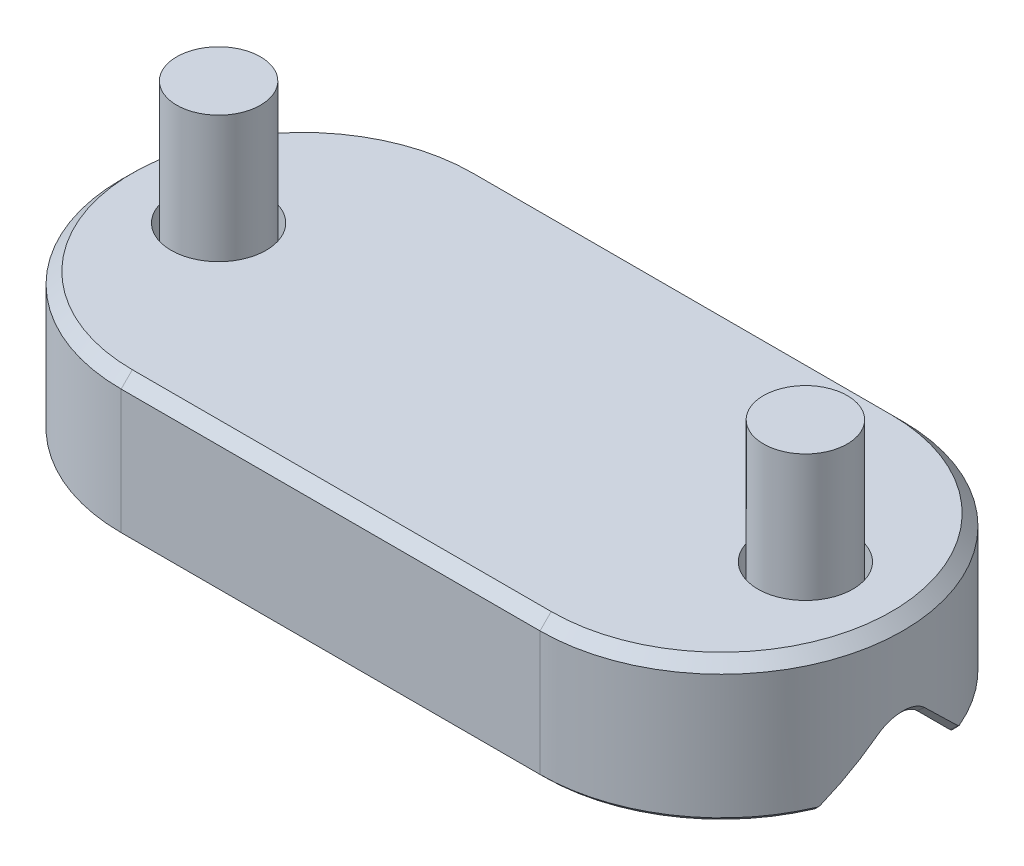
ISO-10303-21;
HEADER;
FILE_DESCRIPTION(('STEP AP214'),'2;1');
FILE_NAME('part.step','',(''),(''),'','','');
FILE_SCHEMA(('AUTOMOTIVE_DESIGN { 1 0 10303 214 1 1 1 1 }'));
ENDSEC;
DATA;
#1=APPLICATION_CONTEXT('core data for automotive mechanical design processes');
#2=APPLICATION_PROTOCOL_DEFINITION('international standard','automotive_design',2000,#1);
#3=PRODUCT_CONTEXT('',#1,'mechanical');
#4=PRODUCT('Part','Part','',(#3));
#5=PRODUCT_RELATED_PRODUCT_CATEGORY('part','',(#4));
#6=PRODUCT_DEFINITION_FORMATION('','',#4);
#7=PRODUCT_DEFINITION_CONTEXT('part definition',#1,'design');
#8=PRODUCT_DEFINITION('design','',#6,#7);
#9=PRODUCT_DEFINITION_SHAPE('','',#8);
#10=(LENGTH_UNIT() NAMED_UNIT(*) SI_UNIT(.MILLI.,.METRE.));
#11=(NAMED_UNIT(*) PLANE_ANGLE_UNIT() SI_UNIT($,.RADIAN.));
#12=(NAMED_UNIT(*) SI_UNIT($,.STERADIAN.) SOLID_ANGLE_UNIT());
#13=UNCERTAINTY_MEASURE_WITH_UNIT(LENGTH_MEASURE(1.E-05),#10,'distance_accuracy_value','');
#14=(GEOMETRIC_REPRESENTATION_CONTEXT(3) GLOBAL_UNCERTAINTY_ASSIGNED_CONTEXT((#13)) GLOBAL_UNIT_ASSIGNED_CONTEXT((#10,
#11,#12)) REPRESENTATION_CONTEXT('',''));
#15=CARTESIAN_POINT('',(0.,0.,0.));
#16=DIRECTION('',(0.,0.,1.));
#17=DIRECTION('',(1.,0.,0.));
#18=AXIS2_PLACEMENT_3D('',#15,#16,#17);
#19=CARTESIAN_POINT('',(21.,18.8,0.));
#20=DIRECTION('',(0.,1.,0.));
#21=DIRECTION('',(-1.,0.,0.));
#22=AXIS2_PLACEMENT_3D('',#19,#20,#21);
#23=PLANE('',#22);
#24=CARTESIAN_POINT('',(21.,18.8,0.));
#25=DIRECTION('',(0.,-1.,0.));
#26=DIRECTION('',(-1.,0.,0.));
#27=AXIS2_PLACEMENT_3D('',#24,#25,#26);
#28=CIRCLE('',#27,3.);
#29=CARTESIAN_POINT('',(18.,18.8,0.));
#30=VERTEX_POINT('',#29);
#31=EDGE_CURVE('E12',#30,#30,#28,.T.);
#32=ORIENTED_EDGE('',*,*,#31,.F.);
#33=EDGE_LOOP('',(#32));
#34=FACE_BOUND('',#33,.T.);
#35=ADVANCED_FACE('F55',(#34),#23,.T.);
#36=CARTESIAN_POINT('',(21.,18.8,0.));
#37=DIRECTION('',(0.,1.,0.));
#38=DIRECTION('',(-1.,0.,0.));
#39=AXIS2_PLACEMENT_3D('',#36,#37,#38);
#40=CYLINDRICAL_SURFACE('',#39,3.);
#41=CARTESIAN_POINT('',(21.,6.8,0.));
#42=DIRECTION('',(0.,-1.,0.));
#43=DIRECTION('',(-1.,0.,0.));
#44=AXIS2_PLACEMENT_3D('',#41,#42,#43);
#45=CIRCLE('',#44,3.);
#46=CARTESIAN_POINT('',(18.,6.8,0.));
#47=VERTEX_POINT('',#46);
#48=EDGE_CURVE('E62',#47,#47,#45,.T.);
#49=ORIENTED_EDGE('',*,*,#48,.F.);
#50=EDGE_LOOP('',(#49));
#51=FACE_BOUND('',#50,.T.);
#52=ORIENTED_EDGE('',*,*,#31,.T.);
#53=EDGE_LOOP('',(#52));
#54=FACE_BOUND('',#53,.T.);
#55=ADVANCED_FACE('F154',(#51,#54),#40,.T.);
#56=CARTESIAN_POINT('',(21.,6.8,3.));
#57=DIRECTION('',(0.,1.,0.));
#58=DIRECTION('',(-1.,0.,0.));
#59=AXIS2_PLACEMENT_3D('',#56,#57,#58);
#60=PLANE('',#59);
#61=CARTESIAN_POINT('',(21.,6.8,0.));
#62=DIRECTION('',(0.,-1.,0.));
#63=DIRECTION('',(-1.,0.,0.));
#64=AXIS2_PLACEMENT_3D('',#61,#62,#63);
#65=CIRCLE('',#64,5.);
#66=CARTESIAN_POINT('',(16.,6.8,0.));
#67=VERTEX_POINT('',#66);
#68=EDGE_CURVE('E147',#67,#67,#65,.T.);
#69=ORIENTED_EDGE('',*,*,#68,.F.);
#70=EDGE_LOOP('',(#69));
#71=FACE_BOUND('',#70,.T.);
#72=ORIENTED_EDGE('',*,*,#48,.T.);
#73=EDGE_LOOP('',(#72));
#74=FACE_BOUND('',#73,.T.);
#75=ADVANCED_FACE('F152',(#71,#74),#60,.T.);
#76=CARTESIAN_POINT('',(21.,18.8,0.));
#77=DIRECTION('',(0.,1.,0.));
#78=DIRECTION('',(-1.,0.,0.));
#79=AXIS2_PLACEMENT_3D('',#76,#77,#78);
#80=CYLINDRICAL_SURFACE('',#79,5.);
#81=CARTESIAN_POINT('',(21.,2.8,0.));
#82=DIRECTION('',(0.,-1.,0.));
#83=DIRECTION('',(-1.,0.,0.));
#84=AXIS2_PLACEMENT_3D('',#81,#82,#83);
#85=CIRCLE('',#84,5.);
#86=CARTESIAN_POINT('',(16.,2.8,0.));
#87=VERTEX_POINT('',#86);
#88=EDGE_CURVE('E144',#87,#87,#85,.T.);
#89=ORIENTED_EDGE('',*,*,#88,.F.);
#90=EDGE_LOOP('',(#89));
#91=FACE_BOUND('',#90,.T.);
#92=ORIENTED_EDGE('',*,*,#68,.T.);
#93=EDGE_LOOP('',(#92));
#94=FACE_BOUND('',#93,.T.);
#95=ADVANCED_FACE('F172',(#91,#94),#80,.T.);
#96=CARTESIAN_POINT('',(21.,2.8,5.));
#97=DIRECTION('',(0.,-1.,0.));
#98=DIRECTION('',(1.,0.,0.));
#99=AXIS2_PLACEMENT_3D('',#96,#97,#98);
#100=PLANE('',#99);
#101=DIRECTION('',(-0.866025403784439,0.,0.5));
#102=VECTOR('',#101,1.);
#103=CARTESIAN_POINT('',(21.,2.8,-2.3094010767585));
#104=LINE('',#103,#102);
#105=CARTESIAN_POINT('',(21.,2.8,-2.3094010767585));
#106=VERTEX_POINT('',#105);
#107=CARTESIAN_POINT('',(19.,2.8,-1.15470053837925));
#108=VERTEX_POINT('',#107);
#109=EDGE_CURVE('E318',#106,#108,#104,.T.);
#110=ORIENTED_EDGE('',*,*,#109,.T.);
#111=DIRECTION('',(0.,0.,1.));
#112=VECTOR('',#111,1.);
#113=CARTESIAN_POINT('',(19.,2.8,-1.15470053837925));
#114=LINE('',#113,#112);
#115=CARTESIAN_POINT('',(19.,2.8,1.15470053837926));
#116=VERTEX_POINT('',#115);
#117=EDGE_CURVE('E312',#108,#116,#114,.T.);
#118=ORIENTED_EDGE('',*,*,#117,.T.);
#119=DIRECTION('',(0.866025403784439,0.,0.5));
#120=VECTOR('',#119,1.);
#121=CARTESIAN_POINT('',(19.,2.8,1.15470053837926));
#122=LINE('',#121,#120);
#123=CARTESIAN_POINT('',(21.,2.8,2.3094010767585));
#124=VERTEX_POINT('',#123);
#125=EDGE_CURVE('E317',#116,#124,#122,.T.);
#126=ORIENTED_EDGE('',*,*,#125,.T.);
#127=DIRECTION('',(0.866025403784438,0.,-0.5));
#128=VECTOR('',#127,1.);
#129=CARTESIAN_POINT('',(21.,2.8,2.3094010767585));
#130=LINE('',#129,#128);
#131=CARTESIAN_POINT('',(23.,2.8,1.15470053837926));
#132=VERTEX_POINT('',#131);
#133=EDGE_CURVE('E326',#124,#132,#130,.T.);
#134=ORIENTED_EDGE('',*,*,#133,.T.);
#135=DIRECTION('',(0.,0.,-1.));
#136=VECTOR('',#135,1.);
#137=CARTESIAN_POINT('',(23.,2.8,1.15470053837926));
#138=LINE('',#137,#136);
#139=CARTESIAN_POINT('',(23.,2.8,-1.15470053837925));
#140=VERTEX_POINT('',#139);
#141=EDGE_CURVE('E133',#132,#140,#138,.T.);
#142=ORIENTED_EDGE('',*,*,#141,.T.);
#143=DIRECTION('',(-0.866025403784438,0.,-0.5));
#144=VECTOR('',#143,1.);
#145=CARTESIAN_POINT('',(23.,2.8,-1.15470053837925));
#146=LINE('',#145,#144);
#147=EDGE_CURVE('E321',#140,#106,#146,.T.);
#148=ORIENTED_EDGE('',*,*,#147,.T.);
#149=EDGE_LOOP('',(#110,#118,#126,#134,#142,#148));
#150=FACE_BOUND('',#149,.T.);
#151=ORIENTED_EDGE('',*,*,#88,.T.);
#152=EDGE_LOOP('',(#151));
#153=FACE_BOUND('',#152,.T.);
#154=ADVANCED_FACE('F180',(#150,#153),#100,.T.);
#155=CARTESIAN_POINT('',(21.,6.3,-2.3094010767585));
#156=DIRECTION('',(-0.5,0.,-0.866025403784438));
#157=DIRECTION('',(0.866025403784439,0.,-0.5));
#158=AXIS2_PLACEMENT_3D('',#155,#156,#157);
#159=PLANE('',#158);
#160=ORIENTED_EDGE('',*,*,#109,.F.);
#161=DIRECTION('',(0.,-1.,0.));
#162=VECTOR('',#161,1.);
#163=CARTESIAN_POINT('',(21.,6.3,-2.3094010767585));
#164=LINE('',#163,#162);
#165=CARTESIAN_POINT('',(21.,6.3,-2.3094010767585));
#166=VERTEX_POINT('',#165);
#167=EDGE_CURVE('E100',#166,#106,#164,.T.);
#168=ORIENTED_EDGE('',*,*,#167,.F.);
#169=DIRECTION('',(-0.866025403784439,0.,0.5));
#170=VECTOR('',#169,1.);
#171=CARTESIAN_POINT('',(21.,6.3,-2.3094010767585));
#172=LINE('',#171,#170);
#173=CARTESIAN_POINT('',(19.,6.3,-1.15470053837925));
#174=VERTEX_POINT('',#173);
#175=EDGE_CURVE('E329',#166,#174,#172,.T.);
#176=ORIENTED_EDGE('',*,*,#175,.T.);
#177=DIRECTION('',(0.,-1.,0.));
#178=VECTOR('',#177,1.);
#179=CARTESIAN_POINT('',(19.,6.3,-1.15470053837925));
#180=LINE('',#179,#178);
#181=EDGE_CURVE('E69',#174,#108,#180,.T.);
#182=ORIENTED_EDGE('',*,*,#181,.T.);
#183=EDGE_LOOP('',(#160,#168,#176,#182));
#184=FACE_BOUND('',#183,.T.);
#185=ADVANCED_FACE('F188',(#184),#159,.F.);
#186=CARTESIAN_POINT('',(23.,6.3,-1.15470053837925));
#187=DIRECTION('',(0.5,0.,-0.866025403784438));
#188=DIRECTION('',(0.866025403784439,0.,0.5));
#189=AXIS2_PLACEMENT_3D('',#186,#187,#188);
#190=PLANE('',#189);
#191=ORIENTED_EDGE('',*,*,#147,.F.);
#192=DIRECTION('',(0.,-1.,0.));
#193=VECTOR('',#192,1.);
#194=CARTESIAN_POINT('',(23.,6.3,-1.15470053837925));
#195=LINE('',#194,#193);
#196=CARTESIAN_POINT('',(23.,6.3,-1.15470053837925));
#197=VERTEX_POINT('',#196);
#198=EDGE_CURVE('E135',#197,#140,#195,.T.);
#199=ORIENTED_EDGE('',*,*,#198,.F.);
#200=DIRECTION('',(-0.866025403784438,0.,-0.5));
#201=VECTOR('',#200,1.);
#202=CARTESIAN_POINT('',(23.,6.3,-1.15470053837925));
#203=LINE('',#202,#201);
#204=EDGE_CURVE('E78',#197,#166,#203,.T.);
#205=ORIENTED_EDGE('',*,*,#204,.T.);
#206=ORIENTED_EDGE('',*,*,#167,.T.);
#207=EDGE_LOOP('',(#191,#199,#205,#206));
#208=FACE_BOUND('',#207,.T.);
#209=ADVANCED_FACE('F196',(#208),#190,.F.);
#210=CARTESIAN_POINT('',(23.,6.3,1.15470053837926));
#211=DIRECTION('',(1.,0.,0.));
#212=DIRECTION('',(0.,1.,0.));
#213=AXIS2_PLACEMENT_3D('',#210,#211,#212);
#214=PLANE('',#213);
#215=ORIENTED_EDGE('',*,*,#141,.F.);
#216=DIRECTION('',(0.,-1.,0.));
#217=VECTOR('',#216,1.);
#218=CARTESIAN_POINT('',(23.,6.3,1.15470053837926));
#219=LINE('',#218,#217);
#220=CARTESIAN_POINT('',(23.,6.3,1.15470053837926));
#221=VERTEX_POINT('',#220);
#222=EDGE_CURVE('E122',#221,#132,#219,.T.);
#223=ORIENTED_EDGE('',*,*,#222,.F.);
#224=DIRECTION('',(0.,0.,-1.));
#225=VECTOR('',#224,1.);
#226=CARTESIAN_POINT('',(23.,6.3,1.15470053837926));
#227=LINE('',#226,#225);
#228=EDGE_CURVE('E125',#221,#197,#227,.T.);
#229=ORIENTED_EDGE('',*,*,#228,.T.);
#230=ORIENTED_EDGE('',*,*,#198,.T.);
#231=EDGE_LOOP('',(#215,#223,#229,#230));
#232=FACE_BOUND('',#231,.T.);
#233=ADVANCED_FACE('F131',(#232),#214,.F.);
#234=CARTESIAN_POINT('',(21.,6.3,2.3094010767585));
#235=DIRECTION('',(0.5,0.,0.866025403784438));
#236=DIRECTION('',(-0.866025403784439,0.,0.5));
#237=AXIS2_PLACEMENT_3D('',#234,#235,#236);
#238=PLANE('',#237);
#239=ORIENTED_EDGE('',*,*,#133,.F.);
#240=DIRECTION('',(0.,-1.,0.));
#241=VECTOR('',#240,1.);
#242=CARTESIAN_POINT('',(21.,6.3,2.3094010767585));
#243=LINE('',#242,#241);
#244=CARTESIAN_POINT('',(21.,6.3,2.3094010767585));
#245=VERTEX_POINT('',#244);
#246=EDGE_CURVE('E124',#245,#124,#243,.T.);
#247=ORIENTED_EDGE('',*,*,#246,.F.);
#248=DIRECTION('',(0.866025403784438,0.,-0.5));
#249=VECTOR('',#248,1.);
#250=CARTESIAN_POINT('',(21.,6.3,2.3094010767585));
#251=LINE('',#250,#249);
#252=EDGE_CURVE('E117',#245,#221,#251,.T.);
#253=ORIENTED_EDGE('',*,*,#252,.T.);
#254=ORIENTED_EDGE('',*,*,#222,.T.);
#255=EDGE_LOOP('',(#239,#247,#253,#254));
#256=FACE_BOUND('',#255,.T.);
#257=ADVANCED_FACE('F120',(#256),#238,.F.);
#258=CARTESIAN_POINT('',(19.,6.3,1.15470053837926));
#259=DIRECTION('',(-0.5,0.,0.866025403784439));
#260=DIRECTION('',(-0.866025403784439,0.,-0.5));
#261=AXIS2_PLACEMENT_3D('',#258,#259,#260);
#262=PLANE('',#261);
#263=ORIENTED_EDGE('',*,*,#125,.F.);
#264=DIRECTION('',(0.,-1.,0.));
#265=VECTOR('',#264,1.);
#266=CARTESIAN_POINT('',(19.,6.3,1.15470053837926));
#267=LINE('',#266,#265);
#268=CARTESIAN_POINT('',(19.,6.3,1.15470053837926));
#269=VERTEX_POINT('',#268);
#270=EDGE_CURVE('E138',#269,#116,#267,.T.);
#271=ORIENTED_EDGE('',*,*,#270,.F.);
#272=DIRECTION('',(0.866025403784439,0.,0.5));
#273=VECTOR('',#272,1.);
#274=CARTESIAN_POINT('',(19.,6.3,1.15470053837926));
#275=LINE('',#274,#273);
#276=EDGE_CURVE('E126',#269,#245,#275,.T.);
#277=ORIENTED_EDGE('',*,*,#276,.T.);
#278=ORIENTED_EDGE('',*,*,#246,.T.);
#279=EDGE_LOOP('',(#263,#271,#277,#278));
#280=FACE_BOUND('',#279,.T.);
#281=ADVANCED_FACE('F215',(#280),#262,.F.);
#282=CARTESIAN_POINT('',(19.,6.3,-1.15470053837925));
#283=DIRECTION('',(-1.,0.,0.));
#284=DIRECTION('',(0.,-1.,0.));
#285=AXIS2_PLACEMENT_3D('',#282,#283,#284);
#286=PLANE('',#285);
#287=ORIENTED_EDGE('',*,*,#117,.F.);
#288=ORIENTED_EDGE('',*,*,#181,.F.);
#289=DIRECTION('',(0.,0.,1.));
#290=VECTOR('',#289,1.);
#291=CARTESIAN_POINT('',(19.,6.3,-1.15470053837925));
#292=LINE('',#291,#290);
#293=EDGE_CURVE('E108',#174,#269,#292,.T.);
#294=ORIENTED_EDGE('',*,*,#293,.T.);
#295=ORIENTED_EDGE('',*,*,#270,.T.);
#296=EDGE_LOOP('',(#287,#288,#294,#295));
#297=FACE_BOUND('',#296,.T.);
#298=ADVANCED_FACE('F222',(#297),#286,.F.);
#299=CARTESIAN_POINT('',(21.,6.3,-2.3094010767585));
#300=DIRECTION('',(0.,1.,0.));
#301=DIRECTION('',(-1.,0.,0.));
#302=AXIS2_PLACEMENT_3D('',#299,#300,#301);
#303=PLANE('',#302);
#304=ORIENTED_EDGE('',*,*,#175,.F.);
#305=ORIENTED_EDGE('',*,*,#204,.F.);
#306=ORIENTED_EDGE('',*,*,#228,.F.);
#307=ORIENTED_EDGE('',*,*,#252,.F.);
#308=ORIENTED_EDGE('',*,*,#276,.F.);
#309=ORIENTED_EDGE('',*,*,#293,.F.);
#310=EDGE_LOOP('',(#304,#305,#306,#307,#308,#309));
#311=FACE_BOUND('',#310,.T.);
#312=ADVANCED_FACE('F128',(#311),#303,.F.);
#313=CLOSED_SHELL('',(#35,#55,#75,#95,#154,#185,#209,#233,#257,#281,#298,#312));
#314=MANIFOLD_SOLID_BREP('B2',#313);
#315=CARTESIAN_POINT('',(-21.,18.8,0.));
#316=DIRECTION('',(0.,1.,0.));
#317=DIRECTION('',(1.,0.,0.));
#318=AXIS2_PLACEMENT_3D('',#315,#316,#317);
#319=PLANE('',#318);
#320=CARTESIAN_POINT('',(-21.,18.8,0.));
#321=DIRECTION('',(0.,1.,0.));
#322=DIRECTION('',(1.,0.,0.));
#323=AXIS2_PLACEMENT_3D('',#320,#321,#322);
#324=CIRCLE('',#323,3.);
#325=CARTESIAN_POINT('',(-18.,18.8,0.));
#326=VERTEX_POINT('',#325);
#327=EDGE_CURVE('E53',#326,#326,#324,.T.);
#328=ORIENTED_EDGE('',*,*,#327,.T.);
#329=EDGE_LOOP('',(#328));
#330=FACE_BOUND('',#329,.T.);
#331=ADVANCED_FACE('F347',(#330),#319,.T.);
#332=CARTESIAN_POINT('',(-21.,18.8,0.));
#333=DIRECTION('',(0.,1.,0.));
#334=DIRECTION('',(1.,0.,0.));
#335=AXIS2_PLACEMENT_3D('',#332,#333,#334);
#336=CYLINDRICAL_SURFACE('',#335,3.);
#337=CARTESIAN_POINT('',(-21.,6.8,0.));
#338=DIRECTION('',(0.,1.,0.));
#339=DIRECTION('',(1.,0.,0.));
#340=AXIS2_PLACEMENT_3D('',#337,#338,#339);
#341=CIRCLE('',#340,3.);
#342=CARTESIAN_POINT('',(-18.,6.8,0.));
#343=VERTEX_POINT('',#342);
#344=EDGE_CURVE('E354',#343,#343,#341,.T.);
#345=ORIENTED_EDGE('',*,*,#344,.T.);
#346=EDGE_LOOP('',(#345));
#347=FACE_BOUND('',#346,.T.);
#348=ORIENTED_EDGE('',*,*,#327,.F.);
#349=EDGE_LOOP('',(#348));
#350=FACE_BOUND('',#349,.T.);
#351=ADVANCED_FACE('F461',(#347,#350),#336,.T.);
#352=CARTESIAN_POINT('',(-21.,6.8,3.));
#353=DIRECTION('',(0.,1.,0.));
#354=DIRECTION('',(1.,0.,0.));
#355=AXIS2_PLACEMENT_3D('',#352,#353,#354);
#356=PLANE('',#355);
#357=CARTESIAN_POINT('',(-21.,6.8,0.));
#358=DIRECTION('',(0.,1.,0.));
#359=DIRECTION('',(1.,0.,0.));
#360=AXIS2_PLACEMENT_3D('',#357,#358,#359);
#361=CIRCLE('',#360,5.);
#362=CARTESIAN_POINT('',(-16.,6.8,0.));
#363=VERTEX_POINT('',#362);
#364=EDGE_CURVE('E456',#363,#363,#361,.T.);
#365=ORIENTED_EDGE('',*,*,#364,.T.);
#366=EDGE_LOOP('',(#365));
#367=FACE_BOUND('',#366,.T.);
#368=ORIENTED_EDGE('',*,*,#344,.F.);
#369=EDGE_LOOP('',(#368));
#370=FACE_BOUND('',#369,.T.);
#371=ADVANCED_FACE('F464',(#367,#370),#356,.T.);
#372=CARTESIAN_POINT('',(-21.,18.8,0.));
#373=DIRECTION('',(0.,1.,0.));
#374=DIRECTION('',(1.,0.,0.));
#375=AXIS2_PLACEMENT_3D('',#372,#373,#374);
#376=CYLINDRICAL_SURFACE('',#375,5.);
#377=CARTESIAN_POINT('',(-21.,2.8,0.));
#378=DIRECTION('',(0.,1.,0.));
#379=DIRECTION('',(1.,0.,0.));
#380=AXIS2_PLACEMENT_3D('',#377,#378,#379);
#381=CIRCLE('',#380,5.);
#382=CARTESIAN_POINT('',(-16.,2.8,0.));
#383=VERTEX_POINT('',#382);
#384=EDGE_CURVE('E448',#383,#383,#381,.T.);
#385=ORIENTED_EDGE('',*,*,#384,.T.);
#386=EDGE_LOOP('',(#385));
#387=FACE_BOUND('',#386,.T.);
#388=ORIENTED_EDGE('',*,*,#364,.F.);
#389=EDGE_LOOP('',(#388));
#390=FACE_BOUND('',#389,.T.);
#391=ADVANCED_FACE('F466',(#387,#390),#376,.T.);
#392=CARTESIAN_POINT('',(-21.,2.8,5.));
#393=DIRECTION('',(0.,-1.,0.));
#394=DIRECTION('',(-1.,0.,0.));
#395=AXIS2_PLACEMENT_3D('',#392,#393,#394);
#396=PLANE('',#395);
#397=DIRECTION('',(0.866025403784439,0.,0.5));
#398=VECTOR('',#397,1.);
#399=CARTESIAN_POINT('',(-21.,2.8,-2.3094010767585));
#400=LINE('',#399,#398);
#401=CARTESIAN_POINT('',(-21.,2.8,-2.3094010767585));
#402=VERTEX_POINT('',#401);
#403=CARTESIAN_POINT('',(-19.,2.8,-1.15470053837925));
#404=VERTEX_POINT('',#403);
#405=EDGE_CURVE('E361',#402,#404,#400,.T.);
#406=ORIENTED_EDGE('',*,*,#405,.F.);
#407=DIRECTION('',(0.866025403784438,0.,-0.5));
#408=VECTOR('',#407,1.);
#409=CARTESIAN_POINT('',(-23.,2.8,-1.15470053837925));
#410=LINE('',#409,#408);
#411=CARTESIAN_POINT('',(-23.,2.8,-1.15470053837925));
#412=VERTEX_POINT('',#411);
#413=EDGE_CURVE('E444',#412,#402,#410,.T.);
#414=ORIENTED_EDGE('',*,*,#413,.F.);
#415=DIRECTION('',(0.,0.,-1.));
#416=VECTOR('',#415,1.);
#417=CARTESIAN_POINT('',(-23.,2.8,1.15470053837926));
#418=LINE('',#417,#416);
#419=CARTESIAN_POINT('',(-23.,2.8,1.15470053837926));
#420=VERTEX_POINT('',#419);
#421=EDGE_CURVE('E442',#420,#412,#418,.T.);
#422=ORIENTED_EDGE('',*,*,#421,.F.);
#423=DIRECTION('',(-0.866025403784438,0.,-0.5));
#424=VECTOR('',#423,1.);
#425=CARTESIAN_POINT('',(-21.,2.8,2.3094010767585));
#426=LINE('',#425,#424);
#427=CARTESIAN_POINT('',(-21.,2.8,2.3094010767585));
#428=VERTEX_POINT('',#427);
#429=EDGE_CURVE('E409',#428,#420,#426,.T.);
#430=ORIENTED_EDGE('',*,*,#429,.F.);
#431=DIRECTION('',(-0.866025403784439,0.,0.5));
#432=VECTOR('',#431,1.);
#433=CARTESIAN_POINT('',(-19.,2.8,1.15470053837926));
#434=LINE('',#433,#432);
#435=CARTESIAN_POINT('',(-19.,2.8,1.15470053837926));
#436=VERTEX_POINT('',#435);
#437=EDGE_CURVE('E438',#436,#428,#434,.T.);
#438=ORIENTED_EDGE('',*,*,#437,.F.);
#439=DIRECTION('',(0.,0.,1.));
#440=VECTOR('',#439,1.);
#441=CARTESIAN_POINT('',(-19.,2.8,-1.15470053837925));
#442=LINE('',#441,#440);
#443=EDGE_CURVE('E435',#404,#436,#442,.T.);
#444=ORIENTED_EDGE('',*,*,#443,.F.);
#445=EDGE_LOOP('',(#406,#414,#422,#430,#438,#444));
#446=FACE_BOUND('',#445,.T.);
#447=ORIENTED_EDGE('',*,*,#384,.F.);
#448=EDGE_LOOP('',(#447));
#449=FACE_BOUND('',#448,.T.);
#450=ADVANCED_FACE('F473',(#446,#449),#396,.T.);
#451=CARTESIAN_POINT('',(-21.,6.3,-2.3094010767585));
#452=DIRECTION('',(0.5,0.,-0.866025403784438));
#453=DIRECTION('',(-0.866025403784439,0.,-0.5));
#454=AXIS2_PLACEMENT_3D('',#451,#452,#453);
#455=PLANE('',#454);
#456=ORIENTED_EDGE('',*,*,#405,.T.);
#457=DIRECTION('',(0.,-1.,0.));
#458=VECTOR('',#457,1.);
#459=CARTESIAN_POINT('',(-19.,6.3,-1.15470053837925));
#460=LINE('',#459,#458);
#461=CARTESIAN_POINT('',(-19.,6.3,-1.15470053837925));
#462=VERTEX_POINT('',#461);
#463=EDGE_CURVE('E391',#462,#404,#460,.T.);
#464=ORIENTED_EDGE('',*,*,#463,.F.);
#465=DIRECTION('',(0.866025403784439,0.,0.5));
#466=VECTOR('',#465,1.);
#467=CARTESIAN_POINT('',(-21.,6.3,-2.3094010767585));
#468=LINE('',#467,#466);
#469=CARTESIAN_POINT('',(-21.,6.3,-2.3094010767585));
#470=VERTEX_POINT('',#469);
#471=EDGE_CURVE('E446',#470,#462,#468,.T.);
#472=ORIENTED_EDGE('',*,*,#471,.F.);
#473=DIRECTION('',(0.,-1.,0.));
#474=VECTOR('',#473,1.);
#475=CARTESIAN_POINT('',(-21.,6.3,-2.3094010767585));
#476=LINE('',#475,#474);
#477=EDGE_CURVE('E369',#470,#402,#476,.T.);
#478=ORIENTED_EDGE('',*,*,#477,.T.);
#479=EDGE_LOOP('',(#456,#464,#472,#478));
#480=FACE_BOUND('',#479,.T.);
#481=ADVANCED_FACE('F507',(#480),#455,.F.);
#482=CARTESIAN_POINT('',(-23.,6.3,-1.15470053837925));
#483=DIRECTION('',(-0.5,0.,-0.866025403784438));
#484=DIRECTION('',(-0.866025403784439,0.,0.5));
#485=AXIS2_PLACEMENT_3D('',#482,#483,#484);
#486=PLANE('',#485);
#487=ORIENTED_EDGE('',*,*,#413,.T.);
#488=ORIENTED_EDGE('',*,*,#477,.F.);
#489=DIRECTION('',(0.866025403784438,0.,-0.5));
#490=VECTOR('',#489,1.);
#491=CARTESIAN_POINT('',(-23.,6.3,-1.15470053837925));
#492=LINE('',#491,#490);
#493=CARTESIAN_POINT('',(-23.,6.3,-1.15470053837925));
#494=VERTEX_POINT('',#493);
#495=EDGE_CURVE('E421',#494,#470,#492,.T.);
#496=ORIENTED_EDGE('',*,*,#495,.F.);
#497=DIRECTION('',(0.,-1.,0.));
#498=VECTOR('',#497,1.);
#499=CARTESIAN_POINT('',(-23.,6.3,-1.15470053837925));
#500=LINE('',#499,#498);
#501=EDGE_CURVE('E413',#494,#412,#500,.T.);
#502=ORIENTED_EDGE('',*,*,#501,.T.);
#503=EDGE_LOOP('',(#487,#488,#496,#502));
#504=FACE_BOUND('',#503,.T.);
#505=ADVANCED_FACE('F518',(#504),#486,.F.);
#506=CARTESIAN_POINT('',(-23.,6.3,1.15470053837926));
#507=DIRECTION('',(-1.,0.,0.));
#508=DIRECTION('',(0.,1.,0.));
#509=AXIS2_PLACEMENT_3D('',#506,#507,#508);
#510=PLANE('',#509);
#511=ORIENTED_EDGE('',*,*,#421,.T.);
#512=ORIENTED_EDGE('',*,*,#501,.F.);
#513=DIRECTION('',(0.,0.,-1.));
#514=VECTOR('',#513,1.);
#515=CARTESIAN_POINT('',(-23.,6.3,1.15470053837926));
#516=LINE('',#515,#514);
#517=CARTESIAN_POINT('',(-23.,6.3,1.15470053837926));
#518=VERTEX_POINT('',#517);
#519=EDGE_CURVE('E417',#518,#494,#516,.T.);
#520=ORIENTED_EDGE('',*,*,#519,.F.);
#521=DIRECTION('',(0.,-1.,0.));
#522=VECTOR('',#521,1.);
#523=CARTESIAN_POINT('',(-23.,6.3,1.15470053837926));
#524=LINE('',#523,#522);
#525=EDGE_CURVE('E402',#518,#420,#524,.T.);
#526=ORIENTED_EDGE('',*,*,#525,.T.);
#527=EDGE_LOOP('',(#511,#512,#520,#526));
#528=FACE_BOUND('',#527,.T.);
#529=ADVANCED_FACE('F418',(#528),#510,.F.);
#530=CARTESIAN_POINT('',(-21.,6.3,2.3094010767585));
#531=DIRECTION('',(-0.5,0.,0.866025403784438));
#532=DIRECTION('',(0.866025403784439,0.,0.5));
#533=AXIS2_PLACEMENT_3D('',#530,#531,#532);
#534=PLANE('',#533);
#535=ORIENTED_EDGE('',*,*,#429,.T.);
#536=ORIENTED_EDGE('',*,*,#525,.F.);
#537=DIRECTION('',(-0.866025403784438,0.,-0.5));
#538=VECTOR('',#537,1.);
#539=CARTESIAN_POINT('',(-21.,6.3,2.3094010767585));
#540=LINE('',#539,#538);
#541=CARTESIAN_POINT('',(-21.,6.3,2.3094010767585));
#542=VERTEX_POINT('',#541);
#543=EDGE_CURVE('E406',#542,#518,#540,.T.);
#544=ORIENTED_EDGE('',*,*,#543,.F.);
#545=DIRECTION('',(0.,-1.,0.));
#546=VECTOR('',#545,1.);
#547=CARTESIAN_POINT('',(-21.,6.3,2.3094010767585));
#548=LINE('',#547,#546);
#549=EDGE_CURVE('E414',#542,#428,#548,.T.);
#550=ORIENTED_EDGE('',*,*,#549,.T.);
#551=EDGE_LOOP('',(#535,#536,#544,#550));
#552=FACE_BOUND('',#551,.T.);
#553=ADVANCED_FACE('F404',(#552),#534,.F.);
#554=CARTESIAN_POINT('',(-19.,6.3,1.15470053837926));
#555=DIRECTION('',(0.5,0.,0.866025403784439));
#556=DIRECTION('',(0.866025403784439,0.,-0.5));
#557=AXIS2_PLACEMENT_3D('',#554,#555,#556);
#558=PLANE('',#557);
#559=ORIENTED_EDGE('',*,*,#437,.T.);
#560=ORIENTED_EDGE('',*,*,#549,.F.);
#561=DIRECTION('',(-0.866025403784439,0.,0.5));
#562=VECTOR('',#561,1.);
#563=CARTESIAN_POINT('',(-19.,6.3,1.15470053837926));
#564=LINE('',#563,#562);
#565=CARTESIAN_POINT('',(-19.,6.3,1.15470053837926));
#566=VERTEX_POINT('',#565);
#567=EDGE_CURVE('E427',#566,#542,#564,.T.);
#568=ORIENTED_EDGE('',*,*,#567,.F.);
#569=DIRECTION('',(0.,-1.,0.));
#570=VECTOR('',#569,1.);
#571=CARTESIAN_POINT('',(-19.,6.3,1.15470053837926));
#572=LINE('',#571,#570);
#573=EDGE_CURVE('E451',#566,#436,#572,.T.);
#574=ORIENTED_EDGE('',*,*,#573,.T.);
#575=EDGE_LOOP('',(#559,#560,#568,#574));
#576=FACE_BOUND('',#575,.T.);
#577=ADVANCED_FACE('F546',(#576),#558,.F.);
#578=CARTESIAN_POINT('',(-19.,6.3,-1.15470053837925));
#579=DIRECTION('',(1.,0.,0.));
#580=DIRECTION('',(0.,-1.,0.));
#581=AXIS2_PLACEMENT_3D('',#578,#579,#580);
#582=PLANE('',#581);
#583=ORIENTED_EDGE('',*,*,#443,.T.);
#584=ORIENTED_EDGE('',*,*,#573,.F.);
#585=DIRECTION('',(0.,0.,1.));
#586=VECTOR('',#585,1.);
#587=CARTESIAN_POINT('',(-19.,6.3,-1.15470053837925));
#588=LINE('',#587,#586);
#589=EDGE_CURVE('E429',#462,#566,#588,.T.);
#590=ORIENTED_EDGE('',*,*,#589,.F.);
#591=ORIENTED_EDGE('',*,*,#463,.T.);
#592=EDGE_LOOP('',(#583,#584,#590,#591));
#593=FACE_BOUND('',#592,.T.);
#594=ADVANCED_FACE('F556',(#593),#582,.F.);
#595=CARTESIAN_POINT('',(-21.,6.3,-2.3094010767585));
#596=DIRECTION('',(0.,1.,0.));
#597=DIRECTION('',(1.,0.,0.));
#598=AXIS2_PLACEMENT_3D('',#595,#596,#597);
#599=PLANE('',#598);
#600=ORIENTED_EDGE('',*,*,#471,.T.);
#601=ORIENTED_EDGE('',*,*,#589,.T.);
#602=ORIENTED_EDGE('',*,*,#567,.T.);
#603=ORIENTED_EDGE('',*,*,#543,.T.);
#604=ORIENTED_EDGE('',*,*,#519,.T.);
#605=ORIENTED_EDGE('',*,*,#495,.T.);
#606=EDGE_LOOP('',(#600,#601,#602,#603,#604,#605));
#607=FACE_BOUND('',#606,.T.);
#608=ADVANCED_FACE('F424',(#607),#599,.F.);
#609=CLOSED_SHELL('',(#331,#351,#371,#391,#450,#481,#505,#529,#553,#577,#594,#608));
#610=MANIFOLD_SOLID_BREP('B6',#609);
#611=CARTESIAN_POINT('',(-14.99,0.,0.));
#612=DIRECTION('',(0.,1.,0.));
#613=DIRECTION('',(0.,0.,1.));
#614=AXIS2_PLACEMENT_3D('',#611,#612,#613);
#615=PLANE('',#614);
#616=DIRECTION('',(-1.,0.,0.));
#617=VECTOR('',#616,1.);
#618=CARTESIAN_POINT('',(-14.99,0.,-4.97253390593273));
#619=LINE('',#618,#617);
#620=CARTESIAN_POINT('',(-23.6295496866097,0.,-4.97253390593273));
#621=VERTEX_POINT('',#620);
#622=CARTESIAN_POINT('',(-26.6597528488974,0.,-4.97253390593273));
#623=VERTEX_POINT('',#622);
#624=EDGE_CURVE('E1516',#621,#623,#619,.T.);
#625=ORIENTED_EDGE('',*,*,#624,.T.);
#626=CARTESIAN_POINT('',(-14.99,0.,0.));
#627=DIRECTION('',(0.,1.,0.));
#628=DIRECTION('',(0.,0.,1.));
#629=AXIS2_PLACEMENT_3D('',#626,#627,#628);
#630=CIRCLE('',#629,12.685);
#631=CARTESIAN_POINT('',(-14.99,0.,-12.685));
#632=VERTEX_POINT('',#631);
#633=EDGE_CURVE('E1697',#623,#632,#630,.F.);
#634=ORIENTED_EDGE('',*,*,#633,.T.);
#635=DIRECTION('',(1.,0.,0.));
#636=VECTOR('',#635,1.);
#637=CARTESIAN_POINT('',(-14.99,0.,-12.685));
#638=LINE('',#637,#636);
#639=CARTESIAN_POINT('',(14.99,0.,-12.685));
#640=VERTEX_POINT('',#639);
#641=EDGE_CURVE('E1705',#632,#640,#638,.T.);
#642=ORIENTED_EDGE('',*,*,#641,.T.);
#643=CARTESIAN_POINT('',(14.99,0.,0.));
#644=DIRECTION('',(0.,1.,0.));
#645=DIRECTION('',(0.,0.,1.));
#646=AXIS2_PLACEMENT_3D('',#643,#644,#645);
#647=CIRCLE('',#646,12.685);
#648=CARTESIAN_POINT('',(26.6597528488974,0.,-4.97253390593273));
#649=VERTEX_POINT('',#648);
#650=EDGE_CURVE('E1581',#640,#649,#647,.F.);
#651=ORIENTED_EDGE('',*,*,#650,.T.);
#652=DIRECTION('',(-1.,0.,0.));
#653=VECTOR('',#652,1.);
#654=CARTESIAN_POINT('',(-14.99,0.,-4.97253390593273));
#655=LINE('',#654,#653);
#656=CARTESIAN_POINT('',(23.6295496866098,0.,-4.97253390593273));
#657=VERTEX_POINT('',#656);
#658=EDGE_CURVE('E1583',#649,#657,#655,.T.);
#659=ORIENTED_EDGE('',*,*,#658,.T.);
#660=CARTESIAN_POINT('',(21.,0.,0.));
#661=DIRECTION('',(0.,1.,0.));
#662=DIRECTION('',(0.,0.,1.));
#663=AXIS2_PLACEMENT_3D('',#660,#661,#662);
#664=CIRCLE('',#663,5.625);
#665=CARTESIAN_POINT('',(18.3704503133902,0.,-4.97253390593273));
#666=VERTEX_POINT('',#665);
#667=EDGE_CURVE('E1632',#657,#666,#664,.T.);
#668=ORIENTED_EDGE('',*,*,#667,.T.);
#669=DIRECTION('',(-1.,0.,0.));
#670=VECTOR('',#669,1.);
#671=CARTESIAN_POINT('',(-14.99,0.,-4.97253390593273));
#672=LINE('',#671,#670);
#673=CARTESIAN_POINT('',(-18.3704503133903,0.,-4.97253390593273));
#674=VERTEX_POINT('',#673);
#675=EDGE_CURVE('E1585',#666,#674,#672,.T.);
#676=ORIENTED_EDGE('',*,*,#675,.T.);
#677=CARTESIAN_POINT('',(-21.,0.,0.));
#678=DIRECTION('',(0.,1.,0.));
#679=DIRECTION('',(0.,0.,1.));
#680=AXIS2_PLACEMENT_3D('',#677,#678,#679);
#681=CIRCLE('',#680,5.625);
#682=EDGE_CURVE('E1640',#674,#621,#681,.T.);
#683=ORIENTED_EDGE('',*,*,#682,.T.);
#684=EDGE_LOOP('',(#625,#634,#642,#651,#659,#668,#676,#683));
#685=FACE_BOUND('',#684,.T.);
#686=ADVANCED_FACE('F607',(#685),#615,.F.);
#687=CARTESIAN_POINT('',(-14.99,10.,0.));
#688=DIRECTION('',(0.,1.,0.));
#689=DIRECTION('',(0.,0.,1.));
#690=AXIS2_PLACEMENT_3D('',#687,#688,#689);
#691=PLANE('',#690);
#692=CARTESIAN_POINT('',(14.99,10.,0.));
#693=DIRECTION('',(0.,1.,0.));
#694=DIRECTION('',(0.,0.,1.));
#695=AXIS2_PLACEMENT_3D('',#692,#693,#694);
#696=CIRCLE('',#695,12.185);
#697=CARTESIAN_POINT('',(14.99,10.,12.185));
#698=VERTEX_POINT('',#697);
#699=CARTESIAN_POINT('',(14.99,10.,-12.185));
#700=VERTEX_POINT('',#699);
#701=EDGE_CURVE('E1878',#698,#700,#696,.T.);
#702=ORIENTED_EDGE('',*,*,#701,.T.);
#703=DIRECTION('',(-1.,0.,0.));
#704=VECTOR('',#703,1.);
#705=CARTESIAN_POINT('',(-14.99,10.,-12.185));
#706=LINE('',#705,#704);
#707=CARTESIAN_POINT('',(-14.99,10.,-12.185));
#708=VERTEX_POINT('',#707);
#709=EDGE_CURVE('E1858',#700,#708,#706,.T.);
#710=ORIENTED_EDGE('',*,*,#709,.T.);
#711=CARTESIAN_POINT('',(-14.99,10.,0.));
#712=DIRECTION('',(0.,1.,0.));
#713=DIRECTION('',(0.,0.,1.));
#714=AXIS2_PLACEMENT_3D('',#711,#712,#713);
#715=CIRCLE('',#714,12.185);
#716=CARTESIAN_POINT('',(-14.99,10.,12.185));
#717=VERTEX_POINT('',#716);
#718=EDGE_CURVE('E1862',#708,#717,#715,.T.);
#719=ORIENTED_EDGE('',*,*,#718,.T.);
#720=DIRECTION('',(1.,0.,0.));
#721=VECTOR('',#720,1.);
#722=CARTESIAN_POINT('',(14.99,10.,12.185));
#723=LINE('',#722,#721);
#724=EDGE_CURVE('E1032',#717,#698,#723,.T.);
#725=ORIENTED_EDGE('',*,*,#724,.T.);
#726=EDGE_LOOP('',(#702,#710,#719,#725));
#727=FACE_BOUND('',#726,.T.);
#728=CARTESIAN_POINT('',(-21.,10.,0.));
#729=DIRECTION('',(0.,1.,0.));
#730=DIRECTION('',(0.,0.,1.));
#731=AXIS2_PLACEMENT_3D('',#728,#729,#730);
#732=CIRCLE('',#731,3.4);
#733=CARTESIAN_POINT('',(-21.,10.,3.4));
#734=VERTEX_POINT('',#733);
#735=EDGE_CURVE('E1624',#734,#734,#732,.T.);
#736=ORIENTED_EDGE('',*,*,#735,.F.);
#737=EDGE_LOOP('',(#736));
#738=FACE_BOUND('',#737,.T.);
#739=CARTESIAN_POINT('',(21.,10.,0.));
#740=DIRECTION('',(0.,1.,0.));
#741=DIRECTION('',(0.,0.,1.));
#742=AXIS2_PLACEMENT_3D('',#739,#740,#741);
#743=CIRCLE('',#742,3.4);
#744=CARTESIAN_POINT('',(21.,10.,3.39999999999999));
#745=VERTEX_POINT('',#744);
#746=EDGE_CURVE('E1614',#745,#745,#743,.T.);
#747=ORIENTED_EDGE('',*,*,#746,.F.);
#748=EDGE_LOOP('',(#747));
#749=FACE_BOUND('',#748,.T.);
#750=ADVANCED_FACE('F1410',(#727,#738,#749),#691,.T.);
#751=DIRECTION('',(-1.,0.,0.));
#752=VECTOR('',#751,1.);
#753=CARTESIAN_POINT('',(-14.99,0.,12.685));
#754=LINE('',#753,#752);
#755=CARTESIAN_POINT('',(14.99,0.,12.685));
#756=VERTEX_POINT('',#755);
#757=CARTESIAN_POINT('',(-14.99,0.,12.685));
#758=VERTEX_POINT('',#757);
#759=EDGE_CURVE('E1013',#756,#758,#754,.T.);
#760=ORIENTED_EDGE('',*,*,#759,.T.);
#761=CARTESIAN_POINT('',(-14.99,0.,0.));
#762=DIRECTION('',(0.,1.,0.));
#763=DIRECTION('',(0.,0.,1.));
#764=AXIS2_PLACEMENT_3D('',#761,#762,#763);
#765=CIRCLE('',#764,12.685);
#766=CARTESIAN_POINT('',(-26.6597528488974,0.,4.97253390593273));
#767=VERTEX_POINT('',#766);
#768=EDGE_CURVE('E1023',#758,#767,#765,.F.);
#769=ORIENTED_EDGE('',*,*,#768,.T.);
#770=DIRECTION('',(-1.,0.,0.));
#771=VECTOR('',#770,1.);
#772=CARTESIAN_POINT('',(-14.99,0.,4.97253390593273));
#773=LINE('',#772,#771);
#774=CARTESIAN_POINT('',(-23.6295496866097,0.,4.97253390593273));
#775=VERTEX_POINT('',#774);
#776=EDGE_CURVE('E1665',#767,#775,#773,.F.);
#777=ORIENTED_EDGE('',*,*,#776,.T.);
#778=CARTESIAN_POINT('',(-18.3704503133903,0.,4.97253390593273));
#779=VERTEX_POINT('',#778);
#780=EDGE_CURVE('E1637',#775,#779,#681,.T.);
#781=ORIENTED_EDGE('',*,*,#780,.T.);
#782=DIRECTION('',(-1.,0.,0.));
#783=VECTOR('',#782,1.);
#784=CARTESIAN_POINT('',(-14.99,0.,4.97253390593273));
#785=LINE('',#784,#783);
#786=CARTESIAN_POINT('',(18.3704503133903,0.,4.97253390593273));
#787=VERTEX_POINT('',#786);
#788=EDGE_CURVE('E1661',#779,#787,#785,.F.);
#789=ORIENTED_EDGE('',*,*,#788,.T.);
#790=CARTESIAN_POINT('',(23.6295496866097,0.,4.97253390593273));
#791=VERTEX_POINT('',#790);
#792=EDGE_CURVE('E1629',#787,#791,#664,.T.);
#793=ORIENTED_EDGE('',*,*,#792,.T.);
#794=DIRECTION('',(-1.,0.,0.));
#795=VECTOR('',#794,1.);
#796=CARTESIAN_POINT('',(-14.99,0.,4.97253390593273));
#797=LINE('',#796,#795);
#798=CARTESIAN_POINT('',(26.6597528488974,0.,4.97253390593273));
#799=VERTEX_POINT('',#798);
#800=EDGE_CURVE('E1666',#791,#799,#797,.F.);
#801=ORIENTED_EDGE('',*,*,#800,.T.);
#802=CARTESIAN_POINT('',(14.99,0.,0.));
#803=DIRECTION('',(0.,1.,0.));
#804=DIRECTION('',(0.,0.,1.));
#805=AXIS2_PLACEMENT_3D('',#802,#803,#804);
#806=CIRCLE('',#805,12.685);
#807=EDGE_CURVE('E1020',#799,#756,#806,.F.);
#808=ORIENTED_EDGE('',*,*,#807,.T.);
#809=EDGE_LOOP('',(#760,#769,#777,#781,#789,#793,#801,#808));
#810=FACE_BOUND('',#809,.T.);
#811=ADVANCED_FACE('F1413',(#810),#615,.F.);
#812=CARTESIAN_POINT('',(-14.99,10.,0.));
#813=DIRECTION('',(0.,-1.,0.));
#814=DIRECTION('',(0.,0.,-1.));
#815=AXIS2_PLACEMENT_3D('',#812,#813,#814);
#816=CYLINDRICAL_SURFACE('',#815,12.985);
#817=DIRECTION('',(0.,-1.,0.));
#818=VECTOR('',#817,1.);
#819=CARTESIAN_POINT('',(-14.99,10.,12.985));
#820=LINE('',#819,#818);
#821=CARTESIAN_POINT('',(-14.99,9.2,12.985));
#822=VERTEX_POINT('',#821);
#823=CARTESIAN_POINT('',(-14.99,0.300000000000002,12.985));
#824=VERTEX_POINT('',#823);
#825=EDGE_CURVE('E1607',#822,#824,#820,.T.);
#826=ORIENTED_EDGE('',*,*,#825,.F.);
#827=CARTESIAN_POINT('',(-14.99,9.2,0.));
#828=DIRECTION('',(0.,1.,0.));
#829=DIRECTION('',(0.,0.,1.));
#830=AXIS2_PLACEMENT_3D('',#827,#828,#829);
#831=CIRCLE('',#830,12.985);
#832=CARTESIAN_POINT('',(-14.99,9.2,-12.985));
#833=VERTEX_POINT('',#832);
#834=EDGE_CURVE('E1857',#822,#833,#831,.F.);
#835=ORIENTED_EDGE('',*,*,#834,.T.);
#836=DIRECTION('',(0.,-1.,0.));
#837=VECTOR('',#836,1.);
#838=CARTESIAN_POINT('',(-14.99,10.,-12.985));
#839=LINE('',#838,#837);
#840=CARTESIAN_POINT('',(-14.99,0.300000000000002,-12.985));
#841=VERTEX_POINT('',#840);
#842=EDGE_CURVE('E1622',#833,#841,#839,.T.);
#843=ORIENTED_EDGE('',*,*,#842,.T.);
#844=CARTESIAN_POINT('',(-14.99,0.300000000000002,0.));
#845=DIRECTION('',(0.,1.,0.));
#846=DIRECTION('',(0.,0.,1.));
#847=AXIS2_PLACEMENT_3D('',#844,#845,#846);
#848=CIRCLE('',#847,12.985);
#849=CARTESIAN_POINT('',(-26.9357422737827,0.300000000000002,-5.09013423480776));
#850=VERTEX_POINT('',#849);
#851=EDGE_CURVE('E1761',#841,#850,#848,.T.);
#852=ORIENTED_EDGE('',*,*,#851,.T.);
#853=CARTESIAN_POINT('',(-26.9963965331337,0.358578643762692,-4.94536826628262));
#854=CARTESIAN_POINT('',(-26.9943749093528,0.353784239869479,-4.95027637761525));
#855=CARTESIAN_POINT('',(-26.9922735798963,0.34929473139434,-4.9553694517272));
#856=CARTESIAN_POINT('',(-26.9879189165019,0.340890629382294,-4.96590365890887));
#857=CARTESIAN_POINT('',(-26.9856655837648,0.336976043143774,-4.9713447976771));
#858=CARTESIAN_POINT('',(-26.981009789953,0.32970483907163,-4.98256420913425));
#859=CARTESIAN_POINT('',(-26.978605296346,0.326346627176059,-4.98834733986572));
#860=CARTESIAN_POINT('',(-26.9736538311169,0.320194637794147,-5.00023075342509));
#861=CARTESIAN_POINT('',(-26.9710858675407,0.317383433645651,-5.00638110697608));
#862=CARTESIAN_POINT('',(-26.9659019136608,0.312431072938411,-5.01876908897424));
#863=CARTESIAN_POINT('',(-26.9632720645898,0.310268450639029,-5.02504013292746));
#864=CARTESIAN_POINT('',(-26.9579441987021,0.306558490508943,-5.03771614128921));
#865=CARTESIAN_POINT('',(-26.9552451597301,0.305009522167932,-5.04412357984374));
#866=CARTESIAN_POINT('',(-26.9497766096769,0.302519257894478,-5.05707601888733));
#867=CARTESIAN_POINT('',(-26.9470083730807,0.301578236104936,-5.06361801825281));
#868=CARTESIAN_POINT('',(-26.9413943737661,0.300315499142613,-5.07685426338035));
#869=CARTESIAN_POINT('',(-26.9385727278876,0.300000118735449,-5.08349160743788));
#870=CARTESIAN_POINT('',(-26.9357422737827,0.300000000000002,-5.09013423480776));
#871=B_SPLINE_CURVE_WITH_KNOTS('',3,(#853,#854,#855,#856,#857,#858,#859,#860,#861,#862,#863,
#864,#865,#866,#867,#868,#869,#870),.UNSPECIFIED.,.F.,.F.,(4,2,2,2,2,2,2,2,4),(0.,
2.08698380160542E-05,4.17396760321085E-05,6.26095140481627E-05,8.3479352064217E-05,
0.000104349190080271,0.000125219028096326,0.00014608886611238,0.000166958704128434),.UNSPECIFIED.);
#872=CARTESIAN_POINT('',(-26.9963965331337,0.358578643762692,-4.94536826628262));
#873=VERTEX_POINT('',#872);
#874=EDGE_CURVE('E1702',#850,#873,#871,.F.);
#875=ORIENTED_EDGE('',*,*,#874,.T.);
#876=CARTESIAN_POINT('',(-27.8678351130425,3.56334559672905,-1.66480863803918));
#877=CARTESIAN_POINT('',(-27.7951069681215,3.01368047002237,-2.22747333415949));
#878=CARTESIAN_POINT('',(-27.6854281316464,2.468686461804,-2.78535643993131));
#879=CARTESIAN_POINT('',(-27.3941148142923,1.39736449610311,-3.88201514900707));
#880=CARTESIAN_POINT('',(-27.2124819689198,0.871042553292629,-4.4207845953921));
#881=CARTESIAN_POINT('',(-26.9963965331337,0.358578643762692,-4.94536826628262));
#882=B_SPLINE_CURVE_WITH_KNOTS('',3,(#876,#877,#878,#879,#880,#881),.UNSPECIFIED.,.F.,.F.,(4,2,
4),(1.18007834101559,1.31115532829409,1.4422323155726),.UNSPECIFIED.);
#883=CARTESIAN_POINT('',(-27.8678351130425,3.56334559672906,-1.66480863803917));
#884=VERTEX_POINT('',#883);
#885=EDGE_CURVE('E1748',#873,#884,#882,.F.);
#886=ORIENTED_EDGE('',*,*,#885,.T.);
#887=CARTESIAN_POINT('',(-27.8678351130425,3.56334559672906,1.66480863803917));
#888=CARTESIAN_POINT('',(-27.8749250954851,3.61691967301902,1.6099645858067));
#889=CARTESIAN_POINT('',(-27.8819685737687,3.66755341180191,1.55273013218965));
#890=CARTESIAN_POINT('',(-27.895764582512,3.76305242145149,1.43354915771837));
#891=CARTESIAN_POINT('',(-27.9025173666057,3.80791719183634,1.37160054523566));
#892=CARTESIAN_POINT('',(-27.910654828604,3.860366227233,1.29118871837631));
#893=CARTESIAN_POINT('',(-27.9122669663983,3.87067236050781,1.27495573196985));
#894=CARTESIAN_POINT('',(-27.9154580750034,3.89092032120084,1.24218752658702));
#895=CARTESIAN_POINT('',(-27.9170370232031,3.9008615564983,1.22565006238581));
#896=CARTESIAN_POINT('',(-27.9216978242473,3.92999899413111,1.17580966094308));
#897=CARTESIAN_POINT('',(-27.9247104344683,3.94855389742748,1.14221403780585));
#898=CARTESIAN_POINT('',(-27.9305289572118,3.98395589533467,1.07428915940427));
#899=CARTESIAN_POINT('',(-27.9333348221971,4.00080274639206,1.03996123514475));
#900=CARTESIAN_POINT('',(-27.9387222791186,4.0328060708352,0.970580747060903));
#901=CARTESIAN_POINT('',(-27.9413038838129,4.04796251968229,0.935528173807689));
#902=CARTESIAN_POINT('',(-27.9462255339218,4.07659035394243,0.864699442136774));
#903=CARTESIAN_POINT('',(-27.9485655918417,4.09006174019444,0.828923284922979));
#904=CARTESIAN_POINT('',(-27.9529868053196,4.11531246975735,0.756643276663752));
#905=CARTESIAN_POINT('',(-27.9550679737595,4.12709183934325,0.720139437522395));
#906=CARTESIAN_POINT('',(-27.9589537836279,4.14893902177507,0.646394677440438));
#907=CARTESIAN_POINT('',(-27.9607585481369,4.15900745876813,0.609147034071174));
#908=CARTESIAN_POINT('',(-27.9640729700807,4.17739773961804,0.533926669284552));
#909=CARTESIAN_POINT('',(-27.9655851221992,4.18573303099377,0.49584939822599));
#910=CARTESIAN_POINT('',(-27.96826598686,4.20044882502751,0.419853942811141));
#911=CARTESIAN_POINT('',(-27.9694427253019,4.20687399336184,0.381767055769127));
#912=CARTESIAN_POINT('',(-27.97146135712,4.21786386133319,0.305516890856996));
#913=CARTESIAN_POINT('',(-27.9723040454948,4.22243286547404,0.267336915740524));
#914=CARTESIAN_POINT('',(-27.9743281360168,4.23338873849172,0.152633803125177));
#915=CARTESIAN_POINT('',(-27.9750056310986,4.23703044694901,0.0759478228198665));
#916=CARTESIAN_POINT('',(-27.9749971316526,4.23698449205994,-0.0394080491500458));
#917=CARTESIAN_POINT('',(-27.9748235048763,4.23604962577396,-0.0779145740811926));
#918=CARTESIAN_POINT('',(-27.974131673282,4.23231775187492,-0.155038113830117));
#919=CARTESIAN_POINT('',(-27.9736135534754,4.22952129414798,-0.193645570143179));
#920=CARTESIAN_POINT('',(-27.9725753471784,4.22390112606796,-0.251669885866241));
#921=CARTESIAN_POINT('',(-27.9721852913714,4.22178741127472,-0.271039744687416));
#922=CARTESIAN_POINT('',(-27.971323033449,4.21710718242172,-0.309593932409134));
#923=CARTESIAN_POINT('',(-27.970850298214,4.21453778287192,-0.328813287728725));
#924=CARTESIAN_POINT('',(-27.9693111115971,4.20615589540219,-0.386227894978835));
#925=CARTESIAN_POINT('',(-27.9681223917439,4.19966304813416,-0.424255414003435));
#926=CARTESIAN_POINT('',(-27.9640915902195,4.17752941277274,-0.537467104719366));
#927=CARTESIAN_POINT('',(-27.9607828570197,4.15922834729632,-0.611892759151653));
#928=CARTESIAN_POINT('',(-27.9549681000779,4.12652734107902,-0.721925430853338));
#929=CARTESIAN_POINT('',(-27.9528877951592,4.11475029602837,-0.758337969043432));
#930=CARTESIAN_POINT('',(-27.9484562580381,4.08943384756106,-0.830631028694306));
#931=CARTESIAN_POINT('',(-27.9461050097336,4.07589451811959,-0.866511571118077));
#932=CARTESIAN_POINT('',(-27.9411448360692,4.0470318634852,-0.937734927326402));
#933=CARTESIAN_POINT('',(-27.9385375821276,4.03171851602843,-0.973056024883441));
#934=CARTESIAN_POINT('',(-27.9330722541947,3.9992325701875,-1.04323762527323));
#935=CARTESIAN_POINT('',(-27.9302326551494,3.98216877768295,-1.07785897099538));
#936=CARTESIAN_POINT('',(-27.9214650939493,3.92877413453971,-1.17986046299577));
#937=CARTESIAN_POINT('',(-27.9152703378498,3.89014188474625,-1.24567223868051));
#938=CARTESIAN_POINT('',(-27.9023756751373,3.80697615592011,-1.37290533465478));
#939=CARTESIAN_POINT('',(-27.8956742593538,3.76243715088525,-1.43434848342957));
#940=CARTESIAN_POINT('',(-27.8819490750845,3.66740839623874,-1.55287937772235));
#941=CARTESIAN_POINT('',(-27.8749249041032,3.61691775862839,-1.60996643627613));
#942=CARTESIAN_POINT('',(-27.8678351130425,3.56334559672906,-1.66480863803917));
#943=B_SPLINE_CURVE_WITH_KNOTS('',3,(#887,#888,#889,#890,#891,#892,#893,#894,#895,#896,#897,
#898,#899,#900,#901,#902,#903,#904,#905,#906,#907,#908,#909,#910,#911,#912,#913,#914,#915,#916,
#917,#918,#919,#920,#921,#922,#923,#924,#925,#926,#927,#928,#929,#930,#931,#932,#933,#934,#935,
#936,#937,#938,#939,#940,#941,#942),.UNSPECIFIED.,.F.,.F.,(4,2,2,2,2,2,2,2,2,2,2,2,2,2,2,2,2,2,
2,2,2,2,2,2,2,2,2,4),(0.,0.000225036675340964,0.000450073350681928,0.000506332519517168,
0.000562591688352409,0.000675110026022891,0.000787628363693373,0.000900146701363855,
0.00101266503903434,0.00112518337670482,0.0012377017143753,0.00135022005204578,
0.00146273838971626,0.00157525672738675,0.00180029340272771,0.00191281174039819,
0.00202533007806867,0.00208158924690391,0.00213784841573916,0.00225036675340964,
0.0024754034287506,0.00258792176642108,0.00270044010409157,0.00281295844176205,
0.00292547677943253,0.00315051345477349,0.00337555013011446,0.00360058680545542),.UNSPECIFIED.);
#944=CARTESIAN_POINT('',(-27.8678351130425,3.56334559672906,1.66480863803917));
#945=VERTEX_POINT('',#944);
#946=EDGE_CURVE('E1737',#884,#945,#943,.F.);
#947=ORIENTED_EDGE('',*,*,#946,.T.);
#948=CARTESIAN_POINT('',(-26.9963965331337,0.358578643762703,4.94536826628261));
#949=CARTESIAN_POINT('',(-27.2124819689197,0.871042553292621,4.42078459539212));
#950=CARTESIAN_POINT('',(-27.3941148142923,1.39736449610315,3.88201514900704));
#951=CARTESIAN_POINT('',(-27.6854281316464,2.46868646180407,2.78535643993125));
#952=CARTESIAN_POINT('',(-27.7951069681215,3.01368047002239,2.22747333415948));
#953=CARTESIAN_POINT('',(-27.8678351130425,3.56334559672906,1.66480863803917));
#954=B_SPLINE_CURVE_WITH_KNOTS('',3,(#948,#949,#950,#951,#952,#953),.UNSPECIFIED.,.F.,.F.,(4,2,
4),(4.84095299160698,4.97202997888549,5.103106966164),.UNSPECIFIED.);
#955=CARTESIAN_POINT('',(-26.9963965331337,0.358578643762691,4.94536826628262));
#956=VERTEX_POINT('',#955);
#957=EDGE_CURVE('E1726',#945,#956,#954,.F.);
#958=ORIENTED_EDGE('',*,*,#957,.T.);
#959=CARTESIAN_POINT('',(-26.9357422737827,0.300000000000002,5.09013423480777));
#960=CARTESIAN_POINT('',(-26.9414093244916,0.300002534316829,5.07683455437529));
#961=CARTESIAN_POINT('',(-26.9469720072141,0.301255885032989,5.06371816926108));
#962=CARTESIAN_POINT('',(-26.9551562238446,0.304962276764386,5.04433454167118));
#963=CARTESIAN_POINT('',(-26.9578619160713,0.306507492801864,5.03791163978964));
#964=CARTESIAN_POINT('',(-26.9618757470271,0.309293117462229,5.0283623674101));
#965=CARTESIAN_POINT('',(-26.9632086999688,0.31030217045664,5.02518757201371));
#966=CARTESIAN_POINT('',(-26.9658592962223,0.312479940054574,5.01886749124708));
#967=CARTESIAN_POINT('',(-26.9671797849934,0.313651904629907,5.015715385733));
#968=CARTESIAN_POINT('',(-26.9710811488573,0.317378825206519,5.00639238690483));
#969=CARTESIAN_POINT('',(-26.973612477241,0.320149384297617,5.00032979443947));
#970=CARTESIAN_POINT('',(-26.9785420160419,0.326262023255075,4.98849941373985));
#971=CARTESIAN_POINT('',(-26.9809396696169,0.329603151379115,4.98273296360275));
#972=CARTESIAN_POINT('',(-26.9855997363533,0.336865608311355,4.97150368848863));
#973=CARTESIAN_POINT('',(-26.9878625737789,0.34078816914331,4.96603981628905));
#974=CARTESIAN_POINT('',(-26.9922465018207,0.349236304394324,4.95543509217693));
#975=CARTESIAN_POINT('',(-26.9943752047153,0.353783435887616,4.95027568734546));
#976=CARTESIAN_POINT('',(-26.9963965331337,0.358578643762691,4.94536826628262));
#977=B_SPLINE_CURVE_WITH_KNOTS('',3,(#959,#960,#961,#962,#963,#964,#965,#966,#967,#968,#969,
#970,#971,#972,#973,#974,#975,#976),.UNSPECIFIED.,.F.,.F.,(4,2,2,2,2,2,2,2,4),(0.,
4.17846752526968E-05,6.26770128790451E-05,7.31231816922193E-05,8.35693505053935E-05,
0.000104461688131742,0.00012535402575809,0.000146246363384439,0.000167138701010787),.UNSPECIFIED.);
#978=CARTESIAN_POINT('',(-26.9357422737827,0.300000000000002,5.09013423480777));
#979=VERTEX_POINT('',#978);
#980=EDGE_CURVE('E1707',#956,#979,#977,.F.);
#981=ORIENTED_EDGE('',*,*,#980,.T.);
#982=CARTESIAN_POINT('',(-14.99,0.300000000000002,0.));
#983=DIRECTION('',(0.,1.,0.));
#984=DIRECTION('',(0.,0.,1.));
#985=AXIS2_PLACEMENT_3D('',#982,#983,#984);
#986=CIRCLE('',#985,12.985);
#987=EDGE_CURVE('E1445',#979,#824,#986,.T.);
#988=ORIENTED_EDGE('',*,*,#987,.T.);
#989=EDGE_LOOP('',(#826,#835,#843,#852,#875,#886,#947,#958,#981,#988));
#990=FACE_BOUND('',#989,.T.);
#991=ADVANCED_FACE('F1422',(#990),#816,.T.);
#992=CARTESIAN_POINT('',(-14.99,10.,12.985));
#993=DIRECTION('',(0.,0.,-1.));
#994=DIRECTION('',(-1.,0.,0.));
#995=AXIS2_PLACEMENT_3D('',#992,#993,#994);
#996=PLANE('',#995);
#997=DIRECTION('',(0.,-1.,0.));
#998=VECTOR('',#997,1.);
#999=CARTESIAN_POINT('',(14.99,10.,12.985));
#1000=LINE('',#999,#998);
#1001=CARTESIAN_POINT('',(14.99,9.2,12.985));
#1002=VERTEX_POINT('',#1001);
#1003=CARTESIAN_POINT('',(14.99,0.300000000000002,12.985));
#1004=VERTEX_POINT('',#1003);
#1005=EDGE_CURVE('E1608',#1002,#1004,#1000,.T.);
#1006=ORIENTED_EDGE('',*,*,#1005,.F.);
#1007=DIRECTION('',(-1.,0.,0.));
#1008=VECTOR('',#1007,1.);
#1009=CARTESIAN_POINT('',(-14.99,9.2,12.985));
#1010=LINE('',#1009,#1008);
#1011=EDGE_CURVE('E345',#1002,#822,#1010,.T.);
#1012=ORIENTED_EDGE('',*,*,#1011,.T.);
#1013=ORIENTED_EDGE('',*,*,#825,.T.);
#1014=DIRECTION('',(1.,0.,0.));
#1015=VECTOR('',#1014,1.);
#1016=CARTESIAN_POINT('',(-14.99,0.300000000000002,12.985));
#1017=LINE('',#1016,#1015);
#1018=EDGE_CURVE('E1027',#824,#1004,#1017,.T.);
#1019=ORIENTED_EDGE('',*,*,#1018,.T.);
#1020=EDGE_LOOP('',(#1006,#1012,#1013,#1019));
#1021=FACE_BOUND('',#1020,.T.);
#1022=ADVANCED_FACE('F1427',(#1021),#996,.F.);
#1023=CARTESIAN_POINT('',(14.99,10.,0.));
#1024=DIRECTION('',(0.,-1.,0.));
#1025=DIRECTION('',(0.,0.,-1.));
#1026=AXIS2_PLACEMENT_3D('',#1023,#1024,#1025);
#1027=CYLINDRICAL_SURFACE('',#1026,12.985);
#1028=DIRECTION('',(0.,-1.,0.));
#1029=VECTOR('',#1028,1.);
#1030=CARTESIAN_POINT('',(14.99,10.,-12.985));
#1031=LINE('',#1030,#1029);
#1032=CARTESIAN_POINT('',(14.99,9.2,-12.985));
#1033=VERTEX_POINT('',#1032);
#1034=CARTESIAN_POINT('',(14.99,0.300000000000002,-12.985));
#1035=VERTEX_POINT('',#1034);
#1036=EDGE_CURVE('E1620',#1033,#1035,#1031,.T.);
#1037=ORIENTED_EDGE('',*,*,#1036,.F.);
#1038=CARTESIAN_POINT('',(14.99,9.2,0.));
#1039=DIRECTION('',(0.,1.,0.));
#1040=DIRECTION('',(0.,0.,1.));
#1041=AXIS2_PLACEMENT_3D('',#1038,#1039,#1040);
#1042=CIRCLE('',#1041,12.985);
#1043=EDGE_CURVE('E617',#1033,#1002,#1042,.F.);
#1044=ORIENTED_EDGE('',*,*,#1043,.T.);
#1045=ORIENTED_EDGE('',*,*,#1005,.T.);
#1046=CARTESIAN_POINT('',(14.99,0.300000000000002,0.));
#1047=DIRECTION('',(0.,1.,0.));
#1048=DIRECTION('',(0.,0.,1.));
#1049=AXIS2_PLACEMENT_3D('',#1046,#1047,#1048);
#1050=CIRCLE('',#1049,12.985);
#1051=CARTESIAN_POINT('',(26.9357422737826,0.300000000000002,5.09013423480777));
#1052=VERTEX_POINT('',#1051);
#1053=EDGE_CURVE('E1768',#1004,#1052,#1050,.T.);
#1054=ORIENTED_EDGE('',*,*,#1053,.T.);
#1055=CARTESIAN_POINT('',(26.9963965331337,0.358578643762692,4.94536826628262));
#1056=CARTESIAN_POINT('',(26.9943749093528,0.353784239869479,4.95027637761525));
#1057=CARTESIAN_POINT('',(26.9922735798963,0.34929473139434,4.95536945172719));
#1058=CARTESIAN_POINT('',(26.9879189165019,0.340890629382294,4.96590365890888));
#1059=CARTESIAN_POINT('',(26.9856655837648,0.336976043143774,4.9713447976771));
#1060=CARTESIAN_POINT('',(26.981009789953,0.32970483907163,4.98256420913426));
#1061=CARTESIAN_POINT('',(26.978605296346,0.326346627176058,4.98834733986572));
#1062=CARTESIAN_POINT('',(26.9736538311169,0.320194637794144,5.00023075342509));
#1063=CARTESIAN_POINT('',(26.9710858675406,0.317383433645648,5.00638110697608));
#1064=CARTESIAN_POINT('',(26.9659019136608,0.312431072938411,5.01876908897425));
#1065=CARTESIAN_POINT('',(26.9632720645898,0.310268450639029,5.02504013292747));
#1066=CARTESIAN_POINT('',(26.9579441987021,0.306558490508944,5.03771614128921));
#1067=CARTESIAN_POINT('',(26.9552451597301,0.305009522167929,5.04412357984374));
#1068=CARTESIAN_POINT('',(26.9497766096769,0.302519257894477,5.05707601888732));
#1069=CARTESIAN_POINT('',(26.9470083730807,0.301578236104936,5.06361801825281));
#1070=CARTESIAN_POINT('',(26.941394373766,0.300315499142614,5.07685426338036));
#1071=CARTESIAN_POINT('',(26.9385727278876,0.300000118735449,5.08349160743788));
#1072=CARTESIAN_POINT('',(26.9357422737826,0.300000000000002,5.09013423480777));
#1073=B_SPLINE_CURVE_WITH_KNOTS('',3,(#1055,#1056,#1057,#1058,#1059,#1060,#1061,#1062,#1063,
#1064,#1065,#1066,#1067,#1068,#1069,#1070,#1071,#1072),.UNSPECIFIED.,.F.,.F.,(4,2,2,2,2,2,2,2,
4),(0.,2.08698380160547E-05,4.17396760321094E-05,6.26095140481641E-05,8.34793520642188E-05,
0.000104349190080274,0.000125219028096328,0.000146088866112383,0.000166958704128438),.UNSPECIFIED.);
#1074=CARTESIAN_POINT('',(26.9963965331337,0.358578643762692,4.94536826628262));
#1075=VERTEX_POINT('',#1074);
#1076=EDGE_CURVE('E1772',#1052,#1075,#1073,.F.);
#1077=ORIENTED_EDGE('',*,*,#1076,.T.);
#1078=CARTESIAN_POINT('',(27.8678351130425,3.56334559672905,1.66480863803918));
#1079=CARTESIAN_POINT('',(27.7951069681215,3.01368047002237,2.2274733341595));
#1080=CARTESIAN_POINT('',(27.6854281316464,2.468686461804,2.78535643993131));
#1081=CARTESIAN_POINT('',(27.3941148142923,1.39736449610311,3.88201514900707));
#1082=CARTESIAN_POINT('',(27.2124819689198,0.871042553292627,4.4207845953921));
#1083=CARTESIAN_POINT('',(26.9963965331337,0.358578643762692,4.94536826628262));
#1084=B_SPLINE_CURVE_WITH_KNOTS('',3,(#1078,#1079,#1080,#1081,#1082,#1083),.UNSPECIFIED.,.F.,
.F.,(4,2,4),(1.18007834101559,1.31115532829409,1.4422323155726),.UNSPECIFIED.);
#1085=CARTESIAN_POINT('',(27.8678351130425,3.56334559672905,1.66480863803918));
#1086=VERTEX_POINT('',#1085);
#1087=EDGE_CURVE('E1880',#1075,#1086,#1084,.F.);
#1088=ORIENTED_EDGE('',*,*,#1087,.T.);
#1089=CARTESIAN_POINT('',(27.8678351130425,3.56334559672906,-1.66480863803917));
#1090=CARTESIAN_POINT('',(27.8749250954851,3.61691967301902,-1.6099645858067));
#1091=CARTESIAN_POINT('',(27.8819685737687,3.66755341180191,-1.55273013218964));
#1092=CARTESIAN_POINT('',(27.895764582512,3.76305242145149,-1.43354915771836));
#1093=CARTESIAN_POINT('',(27.9025173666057,3.80791719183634,-1.37160054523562));
#1094=CARTESIAN_POINT('',(27.910654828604,3.860366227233,-1.29118871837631));
#1095=CARTESIAN_POINT('',(27.9122669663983,3.87067236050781,-1.27495573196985));
#1096=CARTESIAN_POINT('',(27.9154580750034,3.89092032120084,-1.24218752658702));
#1097=CARTESIAN_POINT('',(27.9170370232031,3.9008615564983,-1.22565006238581));
#1098=CARTESIAN_POINT('',(27.9216978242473,3.9299989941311,-1.17580966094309));
#1099=CARTESIAN_POINT('',(27.9247104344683,3.94855389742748,-1.14221403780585));
#1100=CARTESIAN_POINT('',(27.9305289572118,3.98395589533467,-1.07428915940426));
#1101=CARTESIAN_POINT('',(27.9333348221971,4.00080274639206,-1.03996123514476));
#1102=CARTESIAN_POINT('',(27.9387222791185,4.0328060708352,-0.970580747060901));
#1103=CARTESIAN_POINT('',(27.9413038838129,4.04796251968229,-0.935528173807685));
#1104=CARTESIAN_POINT('',(27.9462255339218,4.07659035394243,-0.864699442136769));
#1105=CARTESIAN_POINT('',(27.9485655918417,4.09006174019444,-0.828923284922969));
#1106=CARTESIAN_POINT('',(27.9529868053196,4.11531246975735,-0.756643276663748));
#1107=CARTESIAN_POINT('',(27.9550679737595,4.12709183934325,-0.720139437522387));
#1108=CARTESIAN_POINT('',(27.9589537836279,4.14893902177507,-0.646394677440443));
#1109=CARTESIAN_POINT('',(27.9607585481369,4.15900745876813,-0.609147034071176));
#1110=CARTESIAN_POINT('',(27.9640729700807,4.17739773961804,-0.533926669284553));
#1111=CARTESIAN_POINT('',(27.9655851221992,4.18573303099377,-0.495849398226));
#1112=CARTESIAN_POINT('',(27.96826598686,4.20044882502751,-0.41985394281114));
#1113=CARTESIAN_POINT('',(27.9694427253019,4.20687399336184,-0.381767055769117));
#1114=CARTESIAN_POINT('',(27.97146135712,4.21786386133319,-0.305516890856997));
#1115=CARTESIAN_POINT('',(27.9723040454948,4.22243286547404,-0.26733691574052));
#1116=CARTESIAN_POINT('',(27.9743281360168,4.23338873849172,-0.152633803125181));
#1117=CARTESIAN_POINT('',(27.9750056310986,4.23703044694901,-0.0759478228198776));
#1118=CARTESIAN_POINT('',(27.9749971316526,4.23698449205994,0.0394080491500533));
#1119=CARTESIAN_POINT('',(27.9748235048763,4.23604962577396,0.077914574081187));
#1120=CARTESIAN_POINT('',(27.974131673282,4.23231775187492,0.155038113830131));
#1121=CARTESIAN_POINT('',(27.9736135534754,4.22952129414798,0.193645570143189));
#1122=CARTESIAN_POINT('',(27.9725753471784,4.22390112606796,0.251669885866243));
#1123=CARTESIAN_POINT('',(27.9721852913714,4.22178741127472,0.271039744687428));
#1124=CARTESIAN_POINT('',(27.971323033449,4.21710718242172,0.309593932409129));
#1125=CARTESIAN_POINT('',(27.970850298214,4.21453778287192,0.32881328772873));
#1126=CARTESIAN_POINT('',(27.9693111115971,4.20615589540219,0.386227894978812));
#1127=CARTESIAN_POINT('',(27.9681223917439,4.19966304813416,0.424255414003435));
#1128=CARTESIAN_POINT('',(27.9640915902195,4.17752941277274,0.537467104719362));
#1129=CARTESIAN_POINT('',(27.9607828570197,4.15922834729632,0.611892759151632));
#1130=CARTESIAN_POINT('',(27.9549681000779,4.12652734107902,0.721925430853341));
#1131=CARTESIAN_POINT('',(27.9528877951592,4.11475029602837,0.758337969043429));
#1132=CARTESIAN_POINT('',(27.9484562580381,4.08943384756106,0.830631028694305));
#1133=CARTESIAN_POINT('',(27.9461050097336,4.07589451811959,0.866511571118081));
#1134=CARTESIAN_POINT('',(27.9411448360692,4.0470318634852,0.937734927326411));
#1135=CARTESIAN_POINT('',(27.9385375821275,4.03171851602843,0.973056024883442));
#1136=CARTESIAN_POINT('',(27.9330722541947,3.9992325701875,1.04323762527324));
#1137=CARTESIAN_POINT('',(27.9302326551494,3.98216877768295,1.07785897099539));
#1138=CARTESIAN_POINT('',(27.9214650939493,3.92877413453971,1.17986046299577));
#1139=CARTESIAN_POINT('',(27.9152703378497,3.89014188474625,1.24567223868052));
#1140=CARTESIAN_POINT('',(27.9023756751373,3.80697615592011,1.37290533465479));
#1141=CARTESIAN_POINT('',(27.8956742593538,3.76243715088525,1.43434848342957));
#1142=CARTESIAN_POINT('',(27.8819490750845,3.66740839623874,1.55287937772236));
#1143=CARTESIAN_POINT('',(27.8749249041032,3.61691775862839,1.60996643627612));
#1144=CARTESIAN_POINT('',(27.8678351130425,3.56334559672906,1.66480863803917));
#1145=B_SPLINE_CURVE_WITH_KNOTS('',3,(#1089,#1090,#1091,#1092,#1093,#1094,#1095,#1096,#1097,
#1098,#1099,#1100,#1101,#1102,#1103,#1104,#1105,#1106,#1107,#1108,#1109,#1110,#1111,#1112,#1113,
#1114,#1115,#1116,#1117,#1118,#1119,#1120,#1121,#1122,#1123,#1124,#1125,#1126,#1127,#1128,#1129,
#1130,#1131,#1132,#1133,#1134,#1135,#1136,#1137,#1138,#1139,#1140,#1141,#1142,#1143,#1144),
.UNSPECIFIED.,.F.,.F.,(4,2,2,2,2,2,2,2,2,2,2,2,2,2,2,2,2,2,2,2,2,2,2,2,2,2,2,4),(0.,
0.000225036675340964,0.000450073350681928,0.000506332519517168,0.00056259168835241,
0.000675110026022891,0.000787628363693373,0.000900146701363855,0.00101266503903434,
0.00112518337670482,0.0012377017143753,0.00135022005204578,0.00146273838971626,
0.00157525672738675,0.00180029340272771,0.00191281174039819,0.00202533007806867,
0.00208158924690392,0.00213784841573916,0.00225036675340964,0.0024754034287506,
0.00258792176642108,0.00270044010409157,0.00281295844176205,0.00292547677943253,
0.00315051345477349,0.00337555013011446,0.00360058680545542),.UNSPECIFIED.);
#1146=CARTESIAN_POINT('',(27.8678351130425,3.56334559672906,-1.66480863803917));
#1147=VERTEX_POINT('',#1146);
#1148=EDGE_CURVE('E1881',#1086,#1147,#1145,.F.);
#1149=ORIENTED_EDGE('',*,*,#1148,.T.);
#1150=CARTESIAN_POINT('',(26.9963965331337,0.358578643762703,-4.94536826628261));
#1151=CARTESIAN_POINT('',(27.2124819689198,0.87104255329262,-4.42078459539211));
#1152=CARTESIAN_POINT('',(27.3941148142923,1.39736449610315,-3.88201514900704));
#1153=CARTESIAN_POINT('',(27.6854281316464,2.46868646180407,-2.78535643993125));
#1154=CARTESIAN_POINT('',(27.7951069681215,3.01368047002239,-2.22747333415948));
#1155=CARTESIAN_POINT('',(27.8678351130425,3.56334559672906,-1.66480863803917));
#1156=B_SPLINE_CURVE_WITH_KNOTS('',3,(#1150,#1151,#1152,#1153,#1154,#1155),.UNSPECIFIED.,.F.,
.F.,(4,2,4),(4.84095299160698,4.97202997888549,5.103106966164),.UNSPECIFIED.);
#1157=CARTESIAN_POINT('',(26.9963965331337,0.358578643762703,-4.94536826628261));
#1158=VERTEX_POINT('',#1157);
#1159=EDGE_CURVE('E1504',#1147,#1158,#1156,.F.);
#1160=ORIENTED_EDGE('',*,*,#1159,.T.);
#1161=CARTESIAN_POINT('',(26.9357422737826,0.300000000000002,-5.09013423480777));
#1162=CARTESIAN_POINT('',(26.9414093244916,0.30000253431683,-5.07683455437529));
#1163=CARTESIAN_POINT('',(26.9469720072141,0.301255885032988,-5.06371816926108));
#1164=CARTESIAN_POINT('',(26.9551562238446,0.304962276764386,-5.04433454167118));
#1165=CARTESIAN_POINT('',(26.9578619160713,0.306507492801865,-5.03791163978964));
#1166=CARTESIAN_POINT('',(26.9618757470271,0.309293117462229,-5.0283623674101));
#1167=CARTESIAN_POINT('',(26.9632086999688,0.31030217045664,-5.02518757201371));
#1168=CARTESIAN_POINT('',(26.9658592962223,0.312479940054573,-5.0188674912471));
#1169=CARTESIAN_POINT('',(26.9671797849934,0.313651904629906,-5.01571538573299));
#1170=CARTESIAN_POINT('',(26.9710811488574,0.31737882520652,-5.00639238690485));
#1171=CARTESIAN_POINT('',(26.973612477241,0.320149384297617,-5.00032979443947));
#1172=CARTESIAN_POINT('',(26.9785420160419,0.326262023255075,-4.98849941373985));
#1173=CARTESIAN_POINT('',(26.9809396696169,0.329603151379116,-4.98273296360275));
#1174=CARTESIAN_POINT('',(26.9855997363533,0.336865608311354,-4.97150368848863));
#1175=CARTESIAN_POINT('',(26.9878625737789,0.340788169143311,-4.96603981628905));
#1176=CARTESIAN_POINT('',(26.9922465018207,0.349236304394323,-4.95543509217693));
#1177=CARTESIAN_POINT('',(26.9943752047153,0.353783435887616,-4.95027568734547));
#1178=CARTESIAN_POINT('',(26.9963965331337,0.358578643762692,-4.94536826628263));
#1179=B_SPLINE_CURVE_WITH_KNOTS('',3,(#1161,#1162,#1163,#1164,#1165,#1166,#1167,#1168,#1169,
#1170,#1171,#1172,#1173,#1174,#1175,#1176,#1177,#1178),.UNSPECIFIED.,.F.,.F.,(4,2,2,2,2,2,2,2,
4),(0.,4.17846752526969E-05,6.26770128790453E-05,7.31231816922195E-05,8.35693505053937E-05,
0.000104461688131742,0.000125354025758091,0.000146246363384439,0.000167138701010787),.UNSPECIFIED.);
#1180=CARTESIAN_POINT('',(26.9357422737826,0.300000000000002,-5.09013423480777));
#1181=VERTEX_POINT('',#1180);
#1182=EDGE_CURVE('E1501',#1158,#1181,#1179,.F.);
#1183=ORIENTED_EDGE('',*,*,#1182,.T.);
#1184=CARTESIAN_POINT('',(14.99,0.300000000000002,0.));
#1185=DIRECTION('',(0.,1.,0.));
#1186=DIRECTION('',(0.,0.,1.));
#1187=AXIS2_PLACEMENT_3D('',#1184,#1185,#1186);
#1188=CIRCLE('',#1187,12.985);
#1189=EDGE_CURVE('E1496',#1181,#1035,#1188,.T.);
#1190=ORIENTED_EDGE('',*,*,#1189,.T.);
#1191=EDGE_LOOP('',(#1037,#1044,#1045,#1054,#1077,#1088,#1149,#1160,#1183,#1190));
#1192=FACE_BOUND('',#1191,.T.);
#1193=ADVANCED_FACE('F1777',(#1192),#1027,.T.);
#1194=CARTESIAN_POINT('',(-14.99,10.,-12.985));
#1195=DIRECTION('',(0.,0.,1.));
#1196=DIRECTION('',(1.,0.,0.));
#1197=AXIS2_PLACEMENT_3D('',#1194,#1195,#1196);
#1198=PLANE('',#1197);
#1199=ORIENTED_EDGE('',*,*,#842,.F.);
#1200=DIRECTION('',(1.,0.,0.));
#1201=VECTOR('',#1200,1.);
#1202=CARTESIAN_POINT('',(14.99,9.2,-12.985));
#1203=LINE('',#1202,#1201);
#1204=EDGE_CURVE('E1855',#833,#1033,#1203,.T.);
#1205=ORIENTED_EDGE('',*,*,#1204,.T.);
#1206=ORIENTED_EDGE('',*,*,#1036,.T.);
#1207=DIRECTION('',(-1.,0.,0.));
#1208=VECTOR('',#1207,1.);
#1209=CARTESIAN_POINT('',(-14.99,0.300000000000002,-12.985));
#1210=LINE('',#1209,#1208);
#1211=EDGE_CURVE('E1578',#1035,#841,#1210,.T.);
#1212=ORIENTED_EDGE('',*,*,#1211,.T.);
#1213=EDGE_LOOP('',(#1199,#1205,#1206,#1212));
#1214=FACE_BOUND('',#1213,.T.);
#1215=ADVANCED_FACE('F1785',(#1214),#1198,.F.);
#1216=CARTESIAN_POINT('',(-21.,10.,0.));
#1217=DIRECTION('',(0.,-1.,0.));
#1218=DIRECTION('',(0.,0.,-1.));
#1219=AXIS2_PLACEMENT_3D('',#1216,#1217,#1218);
#1220=CYLINDRICAL_SURFACE('',#1219,3.4);
#1221=CARTESIAN_POINT('',(-21.,6.8,0.));
#1222=DIRECTION('',(0.,1.,0.));
#1223=DIRECTION('',(0.,0.,1.));
#1224=AXIS2_PLACEMENT_3D('',#1221,#1222,#1223);
#1225=CIRCLE('',#1224,3.4);
#1226=CARTESIAN_POINT('',(-21.,6.8,3.4));
#1227=VERTEX_POINT('',#1226);
#1228=EDGE_CURVE('E1611',#1227,#1227,#1225,.T.);
#1229=ORIENTED_EDGE('',*,*,#1228,.F.);
#1230=EDGE_LOOP('',(#1229));
#1231=FACE_BOUND('',#1230,.T.);
#1232=ORIENTED_EDGE('',*,*,#735,.T.);
#1233=EDGE_LOOP('',(#1232));
#1234=FACE_BOUND('',#1233,.T.);
#1235=ADVANCED_FACE('F2255',(#1231,#1234),#1220,.F.);
#1236=CARTESIAN_POINT('',(21.,10.,0.));
#1237=DIRECTION('',(0.,-1.,0.));
#1238=DIRECTION('',(0.,0.,-1.));
#1239=AXIS2_PLACEMENT_3D('',#1236,#1237,#1238);
#1240=CYLINDRICAL_SURFACE('',#1239,3.4);
#1241=CARTESIAN_POINT('',(21.,6.8,0.));
#1242=DIRECTION('',(0.,1.,0.));
#1243=DIRECTION('',(0.,0.,1.));
#1244=AXIS2_PLACEMENT_3D('',#1241,#1242,#1243);
#1245=CIRCLE('',#1244,3.4);
#1246=CARTESIAN_POINT('',(21.,6.8,3.39999999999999));
#1247=VERTEX_POINT('',#1246);
#1248=EDGE_CURVE('E1615',#1247,#1247,#1245,.T.);
#1249=ORIENTED_EDGE('',*,*,#1248,.F.);
#1250=EDGE_LOOP('',(#1249));
#1251=FACE_BOUND('',#1250,.T.);
#1252=ORIENTED_EDGE('',*,*,#746,.T.);
#1253=EDGE_LOOP('',(#1252));
#1254=FACE_BOUND('',#1253,.T.);
#1255=ADVANCED_FACE('F2247',(#1251,#1254),#1240,.F.);
#1256=CARTESIAN_POINT('',(21.,6.8,0.));
#1257=DIRECTION('',(0.,-1.,0.));
#1258=DIRECTION('',(0.,0.,-1.));
#1259=AXIS2_PLACEMENT_3D('',#1256,#1257,#1258);
#1260=CYLINDRICAL_SURFACE('',#1259,5.625);
#1261=CARTESIAN_POINT('',(21.,4.7654271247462,0.));
#1262=DIRECTION('',(0.,0.707106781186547,0.707106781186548));
#1263=DIRECTION('',(0.,-0.707106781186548,0.707106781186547));
#1264=AXIS2_PLACEMENT_3D('',#1261,#1262,#1263);
#1265=ELLIPSE('',#1264,7.95495128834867,5.625);
#1266=CARTESIAN_POINT('',(24.2102404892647,0.146446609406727,4.61898051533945));
#1267=VERTEX_POINT('',#1266);
#1268=CARTESIAN_POINT('',(26.4443204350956,3.35121356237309,1.4142135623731));
#1269=VERTEX_POINT('',#1268);
#1270=EDGE_CURVE('E833',#1267,#1269,#1265,.T.);
#1271=ORIENTED_EDGE('',*,*,#1270,.F.);
#1272=CARTESIAN_POINT('',(24.2102404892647,0.146446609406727,4.61898051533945));
#1273=CARTESIAN_POINT('',(24.1904891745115,0.132740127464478,4.63271160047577));
#1274=CARTESIAN_POINT('',(24.1700838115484,0.120320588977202,4.64670214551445));
#1275=CARTESIAN_POINT('',(24.1282808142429,0.0977929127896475,4.67494487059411));
#1276=CARTESIAN_POINT('',(24.1068855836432,0.0876794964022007,4.68919637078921));
#1277=CARTESIAN_POINT('',(24.0636560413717,0.0695795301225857,4.71755206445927));
#1278=CARTESIAN_POINT('',(24.0418333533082,0.0615629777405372,4.73165520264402));
#1279=CARTESIAN_POINT('',(23.997589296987,0.0472339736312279,4.7598080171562));
#1280=CARTESIAN_POINT('',(23.9751675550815,0.0409226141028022,4.77385765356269));
#1281=CARTESIAN_POINT('',(23.9009799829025,0.0227304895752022,4.81960507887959));
#1282=CARTESIAN_POINT('',(23.8482236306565,0.0139987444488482,4.85098190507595));
#1283=CARTESIAN_POINT('',(23.7675527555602,0.00546025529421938,4.89716941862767));
#1284=CARTESIAN_POINT('',(23.7401526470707,0.00337648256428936,4.91255331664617));
#1285=CARTESIAN_POINT('',(23.6850613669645,0.000648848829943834,4.94287934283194));
#1286=CARTESIAN_POINT('',(23.6573704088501,3.99692346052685E-06,4.95782176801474));
#1287=CARTESIAN_POINT('',(23.6295496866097,0.,4.97253390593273));
#1288=B_SPLINE_CURVE_WITH_KNOTS('',3,(#1272,#1273,#1274,#1275,#1276,#1277,#1278,#1279,#1280,
#1281,#1282,#1283,#1284,#1285,#1286,#1287),.UNSPECIFIED.,.F.,.F.,(4,2,2,2,2,2,2,4),(0.,
0.0829592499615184,0.165726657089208,0.247235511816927,0.328796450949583,0.514270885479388,
0.608724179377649,0.703112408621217),.UNSPECIFIED.);
#1289=EDGE_CURVE('E990',#1267,#791,#1288,.T.);
#1290=ORIENTED_EDGE('',*,*,#1289,.T.);
#1291=ORIENTED_EDGE('',*,*,#792,.F.);
#1292=CARTESIAN_POINT('',(18.3704503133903,0.,4.97253390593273));
#1293=CARTESIAN_POINT('',(18.3326634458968,1.89066658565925E-05,4.95255588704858));
#1294=CARTESIAN_POINT('',(18.2950808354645,0.00120011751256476,4.93212637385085));
#1295=CARTESIAN_POINT('',(18.2203838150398,0.00633427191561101,4.89041769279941));
#1296=CARTESIAN_POINT('',(18.183271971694,0.0102986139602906,4.86913537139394));
#1297=CARTESIAN_POINT('',(18.1109103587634,0.0212983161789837,4.82654129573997));
#1298=CARTESIAN_POINT('',(18.0756375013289,0.0282452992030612,4.80524678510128));
#1299=CARTESIAN_POINT('',(18.0062637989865,0.045739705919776,4.76233429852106));
#1300=CARTESIAN_POINT('',(17.9721609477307,0.0562805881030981,4.74071697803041));
#1301=CARTESIAN_POINT('',(17.9128987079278,0.0788790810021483,4.70227427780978));
#1302=CARTESIAN_POINT('',(17.8874260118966,0.0900891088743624,4.68544380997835));
#1303=CARTESIAN_POINT('',(17.8375788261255,0.115723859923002,4.65195069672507));
#1304=CARTESIAN_POINT('',(17.8132190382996,0.130181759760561,4.63529178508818));
#1305=CARTESIAN_POINT('',(17.7897595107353,0.146446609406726,4.61898051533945));
#1306=B_SPLINE_CURVE_WITH_KNOTS('',3,(#1292,#1293,#1294,#1295,#1296,#1297,#1298,#1299,#1300,
#1301,#1302,#1303,#1304,#1305),.UNSPECIFIED.,.F.,.F.,(4,2,2,2,2,2,4),(0.,0.128257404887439,
0.257043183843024,0.382251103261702,0.507232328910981,0.604642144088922,0.70309630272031),.UNSPECIFIED.);
#1307=CARTESIAN_POINT('',(17.7897595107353,0.146446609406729,4.61898051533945));
#1308=VERTEX_POINT('',#1307);
#1309=EDGE_CURVE('E978',#787,#1308,#1306,.T.);
#1310=ORIENTED_EDGE('',*,*,#1309,.T.);
#1311=CARTESIAN_POINT('',(15.5556795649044,3.35121356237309,1.4142135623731));
#1312=VERTEX_POINT('',#1311);
#1313=EDGE_CURVE('E839',#1312,#1308,#1265,.T.);
#1314=ORIENTED_EDGE('',*,*,#1313,.F.);
#1315=CARTESIAN_POINT('',(15.5556795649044,3.35121356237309,-1.4142135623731));
#1316=CARTESIAN_POINT('',(15.5454703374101,3.39051173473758,-1.37491147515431));
#1317=CARTESIAN_POINT('',(15.5352951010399,3.4281609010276,-1.33398790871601));
#1318=CARTESIAN_POINT('',(15.5152675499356,3.49996389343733,-1.2490958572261));
#1319=CARTESIAN_POINT('',(15.5054152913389,3.5341171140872,-1.20512684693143));
#1320=CARTESIAN_POINT('',(15.4767173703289,3.63106277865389,-1.06890602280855));
#1321=CARTESIAN_POINT('',(15.45874570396,3.68828515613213,-0.972396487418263));
#1322=CARTESIAN_POINT('',(15.4270738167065,3.78606312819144,-0.770443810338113));
#1323=CARTESIAN_POINT('',(15.4133809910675,3.82658990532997,-0.664985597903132));
#1324=CARTESIAN_POINT('',(15.3918371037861,3.8893681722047,-0.448279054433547));
#1325=CARTESIAN_POINT('',(15.3839792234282,3.91164099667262,-0.337037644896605));
#1326=CARTESIAN_POINT('',(15.375164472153,3.93656971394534,-0.116468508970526));
#1327=CARTESIAN_POINT('',(15.3739532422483,3.93994874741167,-0.00723232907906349));
#1328=CARTESIAN_POINT('',(15.3778784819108,3.92889662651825,0.210235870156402));
#1329=CARTESIAN_POINT('',(15.3830156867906,3.91446340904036,0.318467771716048));
#1330=CARTESIAN_POINT('',(15.3988821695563,3.86892481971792,0.528107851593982));
#1331=CARTESIAN_POINT('',(15.4094713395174,3.83823663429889,0.62961824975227));
#1332=CARTESIAN_POINT('',(15.4351048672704,3.76148208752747,0.826067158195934));
#1333=CARTESIAN_POINT('',(15.4501501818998,3.71541242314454,0.921004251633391));
#1334=CARTESIAN_POINT('',(15.4801587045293,3.61917277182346,1.08516845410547));
#1335=CARTESIAN_POINT('',(15.4946153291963,3.57136445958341,1.15589082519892));
#1336=CARTESIAN_POINT('',(15.5245799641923,3.46737441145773,1.29041820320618));
#1337=CARTESIAN_POINT('',(15.5400858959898,3.41120897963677,1.35423627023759));
#1338=CARTESIAN_POINT('',(15.5556795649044,3.35121356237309,1.4142135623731));
#1339=B_SPLINE_CURVE_WITH_KNOTS('',3,(#1315,#1316,#1317,#1318,#1319,#1320,#1321,#1322,#1323,
#1324,#1325,#1326,#1327,#1328,#1329,#1330,#1331,#1332,#1333,#1334,#1335,#1336,#1337,#1338),
.UNSPECIFIED.,.F.,.F.,(4,2,2,2,2,2,2,2,2,2,2,4),(0.,0.169427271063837,0.338883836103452,
0.678036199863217,1.01777152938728,1.35710921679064,1.68336529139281,2.00965915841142,
2.32795779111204,2.64632481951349,2.90539784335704,3.16397190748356),.UNSPECIFIED.);
#1340=CARTESIAN_POINT('',(15.5556795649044,3.35121356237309,-1.4142135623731));
#1341=VERTEX_POINT('',#1340);
#1342=EDGE_CURVE('E845',#1341,#1312,#1339,.T.);
#1343=ORIENTED_EDGE('',*,*,#1342,.F.);
#1344=CARTESIAN_POINT('',(21.,4.76542712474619,0.));
#1345=DIRECTION('',(0.,0.707106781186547,-0.707106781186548));
#1346=DIRECTION('',(0.,-0.707106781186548,-0.707106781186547));
#1347=AXIS2_PLACEMENT_3D('',#1344,#1345,#1346);
#1348=ELLIPSE('',#1347,7.95495128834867,5.625);
#1349=CARTESIAN_POINT('',(17.7897595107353,0.146446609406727,-4.61898051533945));
#1350=VERTEX_POINT('',#1349);
#1351=EDGE_CURVE('E1633',#1350,#1341,#1348,.T.);
#1352=ORIENTED_EDGE('',*,*,#1351,.F.);
#1353=CARTESIAN_POINT('',(17.7897595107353,0.146446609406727,-4.61898051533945));
#1354=CARTESIAN_POINT('',(17.8095108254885,0.132740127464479,-4.63271160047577));
#1355=CARTESIAN_POINT('',(17.8299161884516,0.120320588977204,-4.64670214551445));
#1356=CARTESIAN_POINT('',(17.8717191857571,0.0977929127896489,-4.67494487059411));
#1357=CARTESIAN_POINT('',(17.8931144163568,0.0876794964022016,-4.68919637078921));
#1358=CARTESIAN_POINT('',(17.9363439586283,0.0695795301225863,-4.71755206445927));
#1359=CARTESIAN_POINT('',(17.9581666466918,0.0615629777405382,-4.73165520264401));
#1360=CARTESIAN_POINT('',(18.002410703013,0.0472339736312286,-4.7598080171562));
#1361=CARTESIAN_POINT('',(18.0248324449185,0.0409226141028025,-4.77385765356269));
#1362=CARTESIAN_POINT('',(18.0990200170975,0.0227304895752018,-4.81960507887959));
#1363=CARTESIAN_POINT('',(18.1517763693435,0.0139987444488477,-4.85098190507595));
#1364=CARTESIAN_POINT('',(18.2324472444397,0.00546025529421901,-4.89716941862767));
#1365=CARTESIAN_POINT('',(18.2598473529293,0.00337648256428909,-4.91255331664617));
#1366=CARTESIAN_POINT('',(18.3149386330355,0.000648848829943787,-4.94287934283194));
#1367=CARTESIAN_POINT('',(18.3426295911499,3.99692346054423E-06,-4.95782176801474));
#1368=CARTESIAN_POINT('',(18.3704503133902,0.,-4.97253390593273));
#1369=B_SPLINE_CURVE_WITH_KNOTS('',3,(#1353,#1354,#1355,#1356,#1357,#1358,#1359,#1360,#1361,
#1362,#1363,#1364,#1365,#1366,#1367,#1368),.UNSPECIFIED.,.F.,.F.,(4,2,2,2,2,2,2,4),(0.,
0.0829592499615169,0.165726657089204,0.247235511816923,0.328796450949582,0.514270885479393,
0.608724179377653,0.703112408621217),.UNSPECIFIED.);
#1370=EDGE_CURVE('E979',#1350,#666,#1369,.T.);
#1371=ORIENTED_EDGE('',*,*,#1370,.T.);
#1372=ORIENTED_EDGE('',*,*,#667,.F.);
#1373=CARTESIAN_POINT('',(23.6295496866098,0.,-4.97253390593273));
#1374=CARTESIAN_POINT('',(23.6673365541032,1.8906665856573E-05,-4.95255588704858));
#1375=CARTESIAN_POINT('',(23.7049191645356,0.0012001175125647,-4.93212637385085));
#1376=CARTESIAN_POINT('',(23.7796161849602,0.00633427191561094,-4.89041769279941));
#1377=CARTESIAN_POINT('',(23.8167280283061,0.0102986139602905,-4.86913537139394));
#1378=CARTESIAN_POINT('',(23.8890896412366,0.0212983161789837,-4.82654129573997));
#1379=CARTESIAN_POINT('',(23.9243624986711,0.0282452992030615,-4.80524678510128));
#1380=CARTESIAN_POINT('',(23.9937362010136,0.0457397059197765,-4.76233429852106));
#1381=CARTESIAN_POINT('',(24.0278390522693,0.0562805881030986,-4.74071697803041));
#1382=CARTESIAN_POINT('',(24.0871012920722,0.0788790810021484,-4.70227427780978));
#1383=CARTESIAN_POINT('',(24.1125739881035,0.0900891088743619,-4.68544380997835));
#1384=CARTESIAN_POINT('',(24.1624211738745,0.115723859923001,-4.65195069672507));
#1385=CARTESIAN_POINT('',(24.1867809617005,0.130181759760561,-4.63529178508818));
#1386=CARTESIAN_POINT('',(24.2102404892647,0.146446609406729,-4.61898051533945));
#1387=B_SPLINE_CURVE_WITH_KNOTS('',3,(#1373,#1374,#1375,#1376,#1377,#1378,#1379,#1380,#1381,
#1382,#1383,#1384,#1385,#1386),.UNSPECIFIED.,.F.,.F.,(4,2,2,2,2,2,4),(0.,0.128257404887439,
0.257043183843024,0.382251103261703,0.507232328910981,0.604642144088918,0.70309630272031),.UNSPECIFIED.);
#1388=CARTESIAN_POINT('',(24.2102404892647,0.146446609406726,-4.61898051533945));
#1389=VERTEX_POINT('',#1388);
#1390=EDGE_CURVE('E971',#657,#1389,#1387,.T.);
#1391=ORIENTED_EDGE('',*,*,#1390,.T.);
#1392=CARTESIAN_POINT('',(26.4443204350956,3.35121356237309,-1.4142135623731));
#1393=VERTEX_POINT('',#1392);
#1394=EDGE_CURVE('E844',#1393,#1389,#1348,.T.);
#1395=ORIENTED_EDGE('',*,*,#1394,.F.);
#1396=CARTESIAN_POINT('',(26.4443204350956,3.35121356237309,1.4142135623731));
#1397=CARTESIAN_POINT('',(26.4545296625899,3.39051173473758,1.37491147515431));
#1398=CARTESIAN_POINT('',(26.4647048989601,3.4281609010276,1.33398790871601));
#1399=CARTESIAN_POINT('',(26.4847324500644,3.49996389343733,1.2490958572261));
#1400=CARTESIAN_POINT('',(26.4945847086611,3.53411711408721,1.20512684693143));
#1401=CARTESIAN_POINT('',(26.5232826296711,3.63106277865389,1.06890602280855));
#1402=CARTESIAN_POINT('',(26.54125429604,3.68828515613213,0.972396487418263));
#1403=CARTESIAN_POINT('',(26.5729261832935,3.78606312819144,0.770443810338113));
#1404=CARTESIAN_POINT('',(26.5866190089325,3.82658990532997,0.66498559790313));
#1405=CARTESIAN_POINT('',(26.6081628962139,3.8893681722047,0.448279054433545));
#1406=CARTESIAN_POINT('',(26.6160207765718,3.91164099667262,0.337037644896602));
#1407=CARTESIAN_POINT('',(26.6248355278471,3.93656971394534,0.116468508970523));
#1408=CARTESIAN_POINT('',(26.6260467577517,3.93994874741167,0.00723232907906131));
#1409=CARTESIAN_POINT('',(26.6221215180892,3.92889662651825,-0.210235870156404));
#1410=CARTESIAN_POINT('',(26.6169843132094,3.91446340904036,-0.31846777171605));
#1411=CARTESIAN_POINT('',(26.6011178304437,3.86892481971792,-0.528107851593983));
#1412=CARTESIAN_POINT('',(26.5905286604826,3.83823663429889,-0.629618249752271));
#1413=CARTESIAN_POINT('',(26.5648951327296,3.76148208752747,-0.826067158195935));
#1414=CARTESIAN_POINT('',(26.5498498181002,3.71541242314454,-0.921004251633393));
#1415=CARTESIAN_POINT('',(26.5198412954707,3.61917277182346,-1.08516845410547));
#1416=CARTESIAN_POINT('',(26.5053846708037,3.57136445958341,-1.15589082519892));
#1417=CARTESIAN_POINT('',(26.4754200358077,3.46737441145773,-1.29041820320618));
#1418=CARTESIAN_POINT('',(26.4599141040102,3.41120897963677,-1.35423627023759));
#1419=CARTESIAN_POINT('',(26.4443204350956,3.35121356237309,-1.4142135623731));
#1420=B_SPLINE_CURVE_WITH_KNOTS('',3,(#1396,#1397,#1398,#1399,#1400,#1401,#1402,#1403,#1404,
#1405,#1406,#1407,#1408,#1409,#1410,#1411,#1412,#1413,#1414,#1415,#1416,#1417,#1418,#1419),
.UNSPECIFIED.,.F.,.F.,(4,2,2,2,2,2,2,2,2,2,2,4),(0.,0.169427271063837,0.338883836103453,
0.678036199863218,1.01777152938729,1.35710921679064,1.68336529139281,2.00965915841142,
2.32795779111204,2.64632481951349,2.90539784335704,3.16397190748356),.UNSPECIFIED.);
#1421=EDGE_CURVE('E822',#1269,#1393,#1420,.T.);
#1422=ORIENTED_EDGE('',*,*,#1421,.F.);
#1423=EDGE_LOOP('',(#1271,#1290,#1291,#1310,#1314,#1343,#1352,#1371,#1372,#1391,#1395,#1422));
#1424=FACE_BOUND('',#1423,.T.);
#1425=CARTESIAN_POINT('',(21.,6.8,0.));
#1426=DIRECTION('',(0.,1.,0.));
#1427=DIRECTION('',(0.,0.,1.));
#1428=AXIS2_PLACEMENT_3D('',#1425,#1426,#1427);
#1429=CIRCLE('',#1428,5.625);
#1430=CARTESIAN_POINT('',(21.,6.8,5.625));
#1431=VERTEX_POINT('',#1430);
#1432=EDGE_CURVE('E1634',#1431,#1431,#1429,.T.);
#1433=ORIENTED_EDGE('',*,*,#1432,.T.);
#1434=EDGE_LOOP('',(#1433));
#1435=FACE_BOUND('',#1434,.T.);
#1436=ADVANCED_FACE('F841',(#1424,#1435),#1260,.F.);
#1437=CARTESIAN_POINT('',(21.,6.8,0.));
#1438=DIRECTION('',(0.,1.,0.));
#1439=DIRECTION('',(0.,0.,1.));
#1440=AXIS2_PLACEMENT_3D('',#1437,#1438,#1439);
#1441=PLANE('',#1440);
#1442=ORIENTED_EDGE('',*,*,#1248,.T.);
#1443=EDGE_LOOP('',(#1442));
#1444=FACE_BOUND('',#1443,.T.);
#1445=ORIENTED_EDGE('',*,*,#1432,.F.);
#1446=EDGE_LOOP('',(#1445));
#1447=FACE_BOUND('',#1446,.T.);
#1448=ADVANCED_FACE('F1538',(#1444,#1447),#1441,.F.);
#1449=CARTESIAN_POINT('',(-21.,6.8,0.));
#1450=DIRECTION('',(0.,-1.,0.));
#1451=DIRECTION('',(0.,0.,-1.));
#1452=AXIS2_PLACEMENT_3D('',#1449,#1450,#1451);
#1453=CYLINDRICAL_SURFACE('',#1452,5.625);
#1454=CARTESIAN_POINT('',(-21.,4.76542712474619,0.));
#1455=DIRECTION('',(0.,0.707106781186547,-0.707106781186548));
#1456=DIRECTION('',(0.,-0.707106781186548,-0.707106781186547));
#1457=AXIS2_PLACEMENT_3D('',#1454,#1455,#1456);
#1458=ELLIPSE('',#1457,7.95495128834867,5.625);
#1459=CARTESIAN_POINT('',(-24.2102404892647,0.146446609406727,-4.61898051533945));
#1460=VERTEX_POINT('',#1459);
#1461=CARTESIAN_POINT('',(-26.4443204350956,3.35121356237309,-1.4142135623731));
#1462=VERTEX_POINT('',#1461);
#1463=EDGE_CURVE('E1595',#1460,#1462,#1458,.T.);
#1464=ORIENTED_EDGE('',*,*,#1463,.F.);
#1465=CARTESIAN_POINT('',(-24.2102404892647,0.146446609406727,-4.61898051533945));
#1466=CARTESIAN_POINT('',(-24.1904891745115,0.132740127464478,-4.63271160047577));
#1467=CARTESIAN_POINT('',(-24.1700838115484,0.120320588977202,-4.64670214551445));
#1468=CARTESIAN_POINT('',(-24.1282808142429,0.0977929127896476,-4.67494487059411));
#1469=CARTESIAN_POINT('',(-24.1068855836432,0.0876794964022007,-4.68919637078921));
#1470=CARTESIAN_POINT('',(-24.0636560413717,0.0695795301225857,-4.71755206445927));
#1471=CARTESIAN_POINT('',(-24.0418333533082,0.0615629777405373,-4.73165520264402));
#1472=CARTESIAN_POINT('',(-23.997589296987,0.0472339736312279,-4.7598080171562));
#1473=CARTESIAN_POINT('',(-23.9751675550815,0.040922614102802,-4.77385765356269));
#1474=CARTESIAN_POINT('',(-23.9009799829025,0.022730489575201,-4.81960507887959));
#1475=CARTESIAN_POINT('',(-23.8482236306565,0.0139987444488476,-4.85098190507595));
#1476=CARTESIAN_POINT('',(-23.7675527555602,0.00546025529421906,-4.89716941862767));
#1477=CARTESIAN_POINT('',(-23.7401526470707,0.00337648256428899,-4.91255331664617));
#1478=CARTESIAN_POINT('',(-23.6850613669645,0.000648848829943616,-4.94287934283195));
#1479=CARTESIAN_POINT('',(-23.6573704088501,3.99692346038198E-06,-4.95782176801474));
#1480=CARTESIAN_POINT('',(-23.6295496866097,0.,-4.97253390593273));
#1481=B_SPLINE_CURVE_WITH_KNOTS('',3,(#1465,#1466,#1467,#1468,#1469,#1470,#1471,#1472,#1473,
#1474,#1475,#1476,#1477,#1478,#1479,#1480),.UNSPECIFIED.,.F.,.F.,(4,2,2,2,2,2,2,4),(0.,
0.0829592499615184,0.165726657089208,0.247235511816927,0.32879645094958,0.514270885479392,
0.608724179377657,0.703112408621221),.UNSPECIFIED.);
#1482=EDGE_CURVE('E1551',#1460,#621,#1481,.T.);
#1483=ORIENTED_EDGE('',*,*,#1482,.T.);
#1484=ORIENTED_EDGE('',*,*,#682,.F.);
#1485=CARTESIAN_POINT('',(-18.3704503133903,0.,-4.97253390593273));
#1486=CARTESIAN_POINT('',(-18.3326634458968,1.89066658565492E-05,-4.95255588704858));
#1487=CARTESIAN_POINT('',(-18.2950808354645,0.0012001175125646,-4.93212637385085));
#1488=CARTESIAN_POINT('',(-18.2203838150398,0.00633427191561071,-4.89041769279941));
#1489=CARTESIAN_POINT('',(-18.183271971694,0.0102986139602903,-4.86913537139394));
#1490=CARTESIAN_POINT('',(-18.1109103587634,0.0212983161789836,-4.82654129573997));
#1491=CARTESIAN_POINT('',(-18.0756375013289,0.0282452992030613,-4.80524678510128));
#1492=CARTESIAN_POINT('',(-18.0062637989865,0.0457397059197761,-4.76233429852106));
#1493=CARTESIAN_POINT('',(-17.9721609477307,0.0562805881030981,-4.74071697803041));
#1494=CARTESIAN_POINT('',(-17.9128987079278,0.0788790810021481,-4.70227427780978));
#1495=CARTESIAN_POINT('',(-17.8874260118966,0.0900891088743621,-4.68544380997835));
#1496=CARTESIAN_POINT('',(-17.8375788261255,0.115723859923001,-4.65195069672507));
#1497=CARTESIAN_POINT('',(-17.8132190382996,0.13018175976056,-4.63529178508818));
#1498=CARTESIAN_POINT('',(-17.7897595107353,0.146446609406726,-4.61898051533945));
#1499=B_SPLINE_CURVE_WITH_KNOTS('',3,(#1485,#1486,#1487,#1488,#1489,#1490,#1491,#1492,#1493,
#1494,#1495,#1496,#1497,#1498),.UNSPECIFIED.,.F.,.F.,(4,2,2,2,2,2,4),(0.,0.128257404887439,
0.257043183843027,0.382251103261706,0.507232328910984,0.604642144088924,0.703096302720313),.UNSPECIFIED.);
#1500=CARTESIAN_POINT('',(-17.7897595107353,0.146446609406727,-4.61898051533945));
#1501=VERTEX_POINT('',#1500);
#1502=EDGE_CURVE('E1515',#674,#1501,#1499,.T.);
#1503=ORIENTED_EDGE('',*,*,#1502,.T.);
#1504=CARTESIAN_POINT('',(-15.5556795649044,3.35121356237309,-1.4142135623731));
#1505=VERTEX_POINT('',#1504);
#1506=EDGE_CURVE('E1589',#1505,#1501,#1458,.T.);
#1507=ORIENTED_EDGE('',*,*,#1506,.F.);
#1508=CARTESIAN_POINT('',(-15.5556795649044,3.35121356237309,1.4142135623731));
#1509=CARTESIAN_POINT('',(-15.5454703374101,3.39051173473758,1.37491147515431));
#1510=CARTESIAN_POINT('',(-15.5352951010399,3.4281609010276,1.33398790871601));
#1511=CARTESIAN_POINT('',(-15.5152675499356,3.49996389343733,1.2490958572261));
#1512=CARTESIAN_POINT('',(-15.5054152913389,3.5341171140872,1.20512684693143));
#1513=CARTESIAN_POINT('',(-15.4767173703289,3.63106277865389,1.06890602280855));
#1514=CARTESIAN_POINT('',(-15.45874570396,3.68828515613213,0.972396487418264));
#1515=CARTESIAN_POINT('',(-15.4270738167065,3.78606312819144,0.770443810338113));
#1516=CARTESIAN_POINT('',(-15.4133809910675,3.82658990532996,0.664985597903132));
#1517=CARTESIAN_POINT('',(-15.3918371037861,3.8893681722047,0.448279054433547));
#1518=CARTESIAN_POINT('',(-15.3839792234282,3.91164099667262,0.337037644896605));
#1519=CARTESIAN_POINT('',(-15.375164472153,3.93656971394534,0.116468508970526));
#1520=CARTESIAN_POINT('',(-15.3739532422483,3.93994874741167,0.00723232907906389));
#1521=CARTESIAN_POINT('',(-15.3778784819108,3.92889662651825,-0.210235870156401));
#1522=CARTESIAN_POINT('',(-15.3830156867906,3.91446340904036,-0.318467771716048));
#1523=CARTESIAN_POINT('',(-15.3988821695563,3.86892481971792,-0.528107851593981));
#1524=CARTESIAN_POINT('',(-15.4094713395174,3.83823663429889,-0.629618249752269));
#1525=CARTESIAN_POINT('',(-15.4351048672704,3.76148208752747,-0.826067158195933));
#1526=CARTESIAN_POINT('',(-15.4501501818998,3.71541242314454,-0.921004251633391));
#1527=CARTESIAN_POINT('',(-15.4801587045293,3.61917277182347,-1.08516845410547));
#1528=CARTESIAN_POINT('',(-15.4946153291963,3.57136445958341,-1.15589082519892));
#1529=CARTESIAN_POINT('',(-15.5245799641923,3.46737441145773,-1.29041820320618));
#1530=CARTESIAN_POINT('',(-15.5400858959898,3.41120897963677,-1.35423627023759));
#1531=CARTESIAN_POINT('',(-15.5556795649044,3.35121356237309,-1.4142135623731));
#1532=B_SPLINE_CURVE_WITH_KNOTS('',3,(#1508,#1509,#1510,#1511,#1512,#1513,#1514,#1515,#1516,
#1517,#1518,#1519,#1520,#1521,#1522,#1523,#1524,#1525,#1526,#1527,#1528,#1529,#1530,#1531),
.UNSPECIFIED.,.F.,.F.,(4,2,2,2,2,2,2,2,2,2,2,4),(0.,0.169427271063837,0.338883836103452,
0.678036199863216,1.01777152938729,1.35710921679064,1.68336529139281,2.00965915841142,
2.32795779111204,2.64632481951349,2.90539784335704,3.16397190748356),.UNSPECIFIED.);
#1533=CARTESIAN_POINT('',(-15.5556795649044,3.35121356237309,1.4142135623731));
#1534=VERTEX_POINT('',#1533);
#1535=EDGE_CURVE('E890',#1534,#1505,#1532,.T.);
#1536=ORIENTED_EDGE('',*,*,#1535,.F.);
#1537=CARTESIAN_POINT('',(-21.,4.76542712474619,0.));
#1538=DIRECTION('',(0.,0.707106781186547,0.707106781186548));
#1539=DIRECTION('',(0.,-0.707106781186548,0.707106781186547));
#1540=AXIS2_PLACEMENT_3D('',#1537,#1538,#1539);
#1541=ELLIPSE('',#1540,7.95495128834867,5.625);
#1542=CARTESIAN_POINT('',(-17.7897595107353,0.146446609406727,4.61898051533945));
#1543=VERTEX_POINT('',#1542);
#1544=EDGE_CURVE('E1600',#1543,#1534,#1541,.T.);
#1545=ORIENTED_EDGE('',*,*,#1544,.F.);
#1546=CARTESIAN_POINT('',(-17.7897595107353,0.146446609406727,4.61898051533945));
#1547=CARTESIAN_POINT('',(-17.8095108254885,0.132740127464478,4.63271160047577));
#1548=CARTESIAN_POINT('',(-17.8299161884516,0.120320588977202,4.64670214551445));
#1549=CARTESIAN_POINT('',(-17.8717191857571,0.0977929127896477,4.67494487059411));
#1550=CARTESIAN_POINT('',(-17.8931144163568,0.0876794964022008,4.68919637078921));
#1551=CARTESIAN_POINT('',(-17.9363439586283,0.0695795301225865,4.71755206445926));
#1552=CARTESIAN_POINT('',(-17.9581666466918,0.0615629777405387,4.73165520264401));
#1553=CARTESIAN_POINT('',(-18.002410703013,0.0472339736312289,4.7598080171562));
#1554=CARTESIAN_POINT('',(-18.0248324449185,0.0409226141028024,4.77385765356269));
#1555=CARTESIAN_POINT('',(-18.0990200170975,0.0227304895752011,4.81960507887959));
#1556=CARTESIAN_POINT('',(-18.1517763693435,0.0139987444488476,4.85098190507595));
#1557=CARTESIAN_POINT('',(-18.2324472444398,0.00546025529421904,4.89716941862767));
#1558=CARTESIAN_POINT('',(-18.2598473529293,0.00337648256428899,4.91255331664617));
#1559=CARTESIAN_POINT('',(-18.3149386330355,0.000648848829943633,4.94287934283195));
#1560=CARTESIAN_POINT('',(-18.3426295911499,3.99692346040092E-06,4.95782176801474));
#1561=CARTESIAN_POINT('',(-18.3704503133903,0.,4.97253390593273));
#1562=B_SPLINE_CURVE_WITH_KNOTS('',3,(#1546,#1547,#1548,#1549,#1550,#1551,#1552,#1553,#1554,
#1555,#1556,#1557,#1558,#1559,#1560,#1561),.UNSPECIFIED.,.F.,.F.,(4,2,2,2,2,2,2,4),(0.,
0.0829592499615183,0.165726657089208,0.24723551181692,0.32879645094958,0.514270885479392,
0.608724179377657,0.703112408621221),.UNSPECIFIED.);
#1563=EDGE_CURVE('E1528',#1543,#779,#1562,.T.);
#1564=ORIENTED_EDGE('',*,*,#1563,.T.);
#1565=ORIENTED_EDGE('',*,*,#780,.F.);
#1566=CARTESIAN_POINT('',(-23.6295496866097,0.,4.97253390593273));
#1567=CARTESIAN_POINT('',(-23.6673365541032,1.89066658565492E-05,4.95255588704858));
#1568=CARTESIAN_POINT('',(-23.7049191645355,0.00120011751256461,4.93212637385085));
#1569=CARTESIAN_POINT('',(-23.7796161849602,0.00633427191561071,4.89041769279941));
#1570=CARTESIAN_POINT('',(-23.816728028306,0.0102986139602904,4.86913537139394));
#1571=CARTESIAN_POINT('',(-23.8890896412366,0.0212983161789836,4.82654129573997));
#1572=CARTESIAN_POINT('',(-23.9243624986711,0.0282452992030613,4.80524678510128));
#1573=CARTESIAN_POINT('',(-23.9937362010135,0.0457397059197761,4.76233429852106));
#1574=CARTESIAN_POINT('',(-24.0278390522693,0.0562805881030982,4.74071697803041));
#1575=CARTESIAN_POINT('',(-24.0871012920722,0.0788790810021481,4.70227427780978));
#1576=CARTESIAN_POINT('',(-24.1125739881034,0.0900891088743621,4.68544380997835));
#1577=CARTESIAN_POINT('',(-24.1624211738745,0.115723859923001,4.65195069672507));
#1578=CARTESIAN_POINT('',(-24.1867809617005,0.13018175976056,4.63529178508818));
#1579=CARTESIAN_POINT('',(-24.2102404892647,0.146446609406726,4.61898051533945));
#1580=B_SPLINE_CURVE_WITH_KNOTS('',3,(#1566,#1567,#1568,#1569,#1570,#1571,#1572,#1573,#1574,
#1575,#1576,#1577,#1578,#1579),.UNSPECIFIED.,.F.,.F.,(4,2,2,2,2,2,4),(0.,0.128257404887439,
0.257043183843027,0.382251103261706,0.507232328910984,0.604642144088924,0.703096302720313),.UNSPECIFIED.);
#1581=CARTESIAN_POINT('',(-24.2102404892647,0.146446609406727,4.61898051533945));
#1582=VERTEX_POINT('',#1581);
#1583=EDGE_CURVE('E1546',#775,#1582,#1580,.T.);
#1584=ORIENTED_EDGE('',*,*,#1583,.T.);
#1585=CARTESIAN_POINT('',(-26.4443204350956,3.35121356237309,1.4142135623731));
#1586=VERTEX_POINT('',#1585);
#1587=EDGE_CURVE('E1602',#1586,#1582,#1541,.T.);
#1588=ORIENTED_EDGE('',*,*,#1587,.F.);
#1589=CARTESIAN_POINT('',(-26.4443204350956,3.35121356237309,-1.4142135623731));
#1590=CARTESIAN_POINT('',(-26.4545296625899,3.39051173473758,-1.37491147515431));
#1591=CARTESIAN_POINT('',(-26.4647048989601,3.4281609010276,-1.33398790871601));
#1592=CARTESIAN_POINT('',(-26.4847324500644,3.49996389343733,-1.2490958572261));
#1593=CARTESIAN_POINT('',(-26.4945847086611,3.53411711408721,-1.20512684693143));
#1594=CARTESIAN_POINT('',(-26.5232826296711,3.63106277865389,-1.06890602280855));
#1595=CARTESIAN_POINT('',(-26.54125429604,3.68828515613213,-0.972396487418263));
#1596=CARTESIAN_POINT('',(-26.5729261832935,3.78606312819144,-0.770443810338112));
#1597=CARTESIAN_POINT('',(-26.5866190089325,3.82658990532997,-0.66498559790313));
#1598=CARTESIAN_POINT('',(-26.6081628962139,3.8893681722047,-0.448279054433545));
#1599=CARTESIAN_POINT('',(-26.6160207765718,3.91164099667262,-0.337037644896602));
#1600=CARTESIAN_POINT('',(-26.624835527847,3.93656971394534,-0.116468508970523));
#1601=CARTESIAN_POINT('',(-26.6260467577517,3.93994874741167,-0.00723232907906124));
#1602=CARTESIAN_POINT('',(-26.6221215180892,3.92889662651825,0.210235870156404));
#1603=CARTESIAN_POINT('',(-26.6169843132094,3.91446340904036,0.318467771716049));
#1604=CARTESIAN_POINT('',(-26.6011178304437,3.86892481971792,0.528107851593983));
#1605=CARTESIAN_POINT('',(-26.5905286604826,3.83823663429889,0.629618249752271));
#1606=CARTESIAN_POINT('',(-26.5648951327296,3.76148208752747,0.826067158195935));
#1607=CARTESIAN_POINT('',(-26.5498498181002,3.71541242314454,0.921004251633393));
#1608=CARTESIAN_POINT('',(-26.5198412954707,3.61917277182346,1.08516845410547));
#1609=CARTESIAN_POINT('',(-26.5053846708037,3.57136445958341,1.15589082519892));
#1610=CARTESIAN_POINT('',(-26.4754200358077,3.46737441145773,1.29041820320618));
#1611=CARTESIAN_POINT('',(-26.4599141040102,3.41120897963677,1.35423627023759));
#1612=CARTESIAN_POINT('',(-26.4443204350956,3.35121356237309,1.4142135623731));
#1613=B_SPLINE_CURVE_WITH_KNOTS('',3,(#1589,#1590,#1591,#1592,#1593,#1594,#1595,#1596,#1597,
#1598,#1599,#1600,#1601,#1602,#1603,#1604,#1605,#1606,#1607,#1608,#1609,#1610,#1611,#1612),
.UNSPECIFIED.,.F.,.F.,(4,2,2,2,2,2,2,2,2,2,2,4),(0.,0.169427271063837,0.338883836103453,
0.678036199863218,1.01777152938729,1.35710921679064,1.68336529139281,2.00965915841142,
2.32795779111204,2.64632481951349,2.90539784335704,3.16397190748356),.UNSPECIFIED.);
#1614=EDGE_CURVE('E878',#1462,#1586,#1613,.T.);
#1615=ORIENTED_EDGE('',*,*,#1614,.F.);
#1616=EDGE_LOOP('',(#1464,#1483,#1484,#1503,#1507,#1536,#1545,#1564,#1565,#1584,#1588,#1615));
#1617=FACE_BOUND('',#1616,.T.);
#1618=CARTESIAN_POINT('',(-21.,6.8,0.));
#1619=DIRECTION('',(0.,1.,0.));
#1620=DIRECTION('',(0.,0.,1.));
#1621=AXIS2_PLACEMENT_3D('',#1618,#1619,#1620);
#1622=CIRCLE('',#1621,5.625);
#1623=CARTESIAN_POINT('',(-21.,6.8,5.625));
#1624=VERTEX_POINT('',#1623);
#1625=EDGE_CURVE('E1617',#1624,#1624,#1622,.T.);
#1626=ORIENTED_EDGE('',*,*,#1625,.T.);
#1627=EDGE_LOOP('',(#1626));
#1628=FACE_BOUND('',#1627,.T.);
#1629=ADVANCED_FACE('F1534',(#1617,#1628),#1453,.F.);
#1630=CARTESIAN_POINT('',(-21.,6.8,0.));
#1631=DIRECTION('',(0.,1.,0.));
#1632=DIRECTION('',(0.,0.,1.));
#1633=AXIS2_PLACEMENT_3D('',#1630,#1631,#1632);
#1634=PLANE('',#1633);
#1635=ORIENTED_EDGE('',*,*,#1228,.T.);
#1636=EDGE_LOOP('',(#1635));
#1637=FACE_BOUND('',#1636,.T.);
#1638=ORIENTED_EDGE('',*,*,#1625,.F.);
#1639=EDGE_LOOP('',(#1638));
#1640=FACE_BOUND('',#1639,.T.);
#1641=ADVANCED_FACE('F1537',(#1637,#1640),#1634,.F.);
#1642=CARTESIAN_POINT('',(27.975,0.,4.76542712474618));
#1643=DIRECTION('',(0.,0.707106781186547,0.707106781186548));
#1644=DIRECTION('',(0.,-0.707106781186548,0.707106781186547));
#1645=AXIS2_PLACEMENT_3D('',#1642,#1643,#1644);
#1646=PLANE('',#1645);
#1647=DIRECTION('',(-1.,0.,0.));
#1648=VECTOR('',#1647,1.);
#1649=CARTESIAN_POINT('',(27.975,0.146446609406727,4.61898051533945));
#1650=LINE('',#1649,#1648);
#1651=CARTESIAN_POINT('',(-26.7190057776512,0.146446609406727,4.61898051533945));
#1652=VERTEX_POINT('',#1651);
#1653=EDGE_CURVE('E1557',#1582,#1652,#1650,.T.);
#1654=ORIENTED_EDGE('',*,*,#1653,.T.);
#1655=CARTESIAN_POINT('',(-27.5703110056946,3.3512135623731,1.41421356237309));
#1656=CARTESIAN_POINT('',(-27.4992631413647,2.80154843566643,1.96387868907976));
#1657=CARTESIAN_POINT('',(-27.3921182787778,2.25655442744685,2.50887269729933));
#1658=CARTESIAN_POINT('',(-27.1075353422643,1.18523246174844,3.58019466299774));
#1659=CARTESIAN_POINT('',(-26.9300988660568,0.658910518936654,4.10651660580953));
#1660=CARTESIAN_POINT('',(-26.7190057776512,0.146446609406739,4.61898051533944));
#1661=B_SPLINE_CURVE_WITH_KNOTS('',3,(#1655,#1656,#1657,#1658,#1659,#1660),.UNSPECIFIED.,.F.,
.F.,(4,2,4),(4.84095299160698,4.97202997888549,5.103106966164),.UNSPECIFIED.);
#1662=CARTESIAN_POINT('',(-27.5703110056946,3.35121356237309,1.4142135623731));
#1663=VERTEX_POINT('',#1662);
#1664=EDGE_CURVE('E1485',#1652,#1663,#1661,.F.);
#1665=ORIENTED_EDGE('',*,*,#1664,.T.);
#1666=DIRECTION('',(-1.,0.,0.));
#1667=VECTOR('',#1666,1.);
#1668=CARTESIAN_POINT('',(27.975,3.35121356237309,1.4142135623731));
#1669=LINE('',#1668,#1667);
#1670=EDGE_CURVE('E910',#1586,#1663,#1669,.T.);
#1671=ORIENTED_EDGE('',*,*,#1670,.F.);
#1672=ORIENTED_EDGE('',*,*,#1587,.T.);
#1673=EDGE_LOOP('',(#1654,#1665,#1671,#1672));
#1674=FACE_BOUND('',#1673,.T.);
#1675=ADVANCED_FACE('F869',(#1674),#1646,.F.);
#1676=CARTESIAN_POINT('',(27.975,1.937,0.));
#1677=DIRECTION('',(-1.,0.,0.));
#1678=DIRECTION('',(0.,0.,1.));
#1679=AXIS2_PLACEMENT_3D('',#1676,#1677,#1678);
#1680=CYLINDRICAL_SURFACE('',#1679,2.);
#1681=ORIENTED_EDGE('',*,*,#1670,.T.);
#1682=CARTESIAN_POINT('',(-27.5703110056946,3.35121356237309,-1.4142135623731));
#1683=CARTESIAN_POINT('',(-27.5772369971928,3.3977980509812,-1.36762647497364));
#1684=CARTESIAN_POINT('',(-27.5840988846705,3.44170295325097,-1.31913243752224));
#1685=CARTESIAN_POINT('',(-27.5975069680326,3.52433665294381,-1.21844338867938));
#1686=CARTESIAN_POINT('',(-27.6040535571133,3.56306622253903,-1.16624896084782));
#1687=CARTESIAN_POINT('',(-27.6166503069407,3.63538424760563,-1.05816760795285));
#1688=CARTESIAN_POINT('',(-27.6227019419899,3.66897750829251,-1.00226214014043));
#1689=CARTESIAN_POINT('',(-27.63126694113,3.71540763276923,-0.915614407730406));
#1690=CARTESIAN_POINT('',(-27.6340409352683,3.73024571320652,-0.886204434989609));
#1691=CARTESIAN_POINT('',(-27.6393799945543,3.75849436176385,-0.826586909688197));
#1692=CARTESIAN_POINT('',(-27.6419270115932,3.77181031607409,-0.796582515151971));
#1693=CARTESIAN_POINT('',(-27.6467725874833,3.79690827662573,-0.736080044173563));
#1694=CARTESIAN_POINT('',(-27.6490695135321,3.80868160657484,-0.705600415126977));
#1695=CARTESIAN_POINT('',(-27.653398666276,3.83069590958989,-0.64418925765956));
#1696=CARTESIAN_POINT('',(-27.6554309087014,3.8409368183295,-0.613257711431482));
#1697=CARTESIAN_POINT('',(-27.6611113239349,3.86937247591,-0.519787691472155));
#1698=CARTESIAN_POINT('',(-27.664343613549,3.88528644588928,-0.456564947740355));
#1699=CARTESIAN_POINT('',(-27.6682812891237,3.90453308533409,-0.360394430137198));
#1700=CARTESIAN_POINT('',(-27.6694425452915,3.91017903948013,-0.328090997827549));
#1701=CARTESIAN_POINT('',(-27.6709461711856,3.91746763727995,-0.279318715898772));
#1702=CARTESIAN_POINT('',(-27.6714079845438,3.91970189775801,-0.262992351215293));
#1703=CARTESIAN_POINT('',(-27.6722503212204,3.92377166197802,-0.230241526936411));
#1704=CARTESIAN_POINT('',(-27.6726313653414,3.92560967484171,-0.213787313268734));
#1705=CARTESIAN_POINT('',(-27.6736455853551,3.93049677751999,-0.164497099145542));
#1706=CARTESIAN_POINT('',(-27.6741517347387,3.93292847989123,-0.131701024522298));
#1707=CARTESIAN_POINT('',(-27.6748275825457,3.93617358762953,-0.0661864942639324));
#1708=CARTESIAN_POINT('',(-27.6749971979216,3.93698651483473,-0.0334761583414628));
#1709=CARTESIAN_POINT('',(-27.6750055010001,3.93702647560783,0.0645157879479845));
#1710=CARTESIAN_POINT('',(-27.6743436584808,3.93385977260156,0.129658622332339));
#1711=CARTESIAN_POINT('',(-27.6723663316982,3.92433292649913,0.227096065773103));
#1712=CARTESIAN_POINT('',(-27.6715431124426,3.92035987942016,0.25952900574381));
#1713=CARTESIAN_POINT('',(-27.6695711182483,3.91080347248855,0.324301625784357));
#1714=CARTESIAN_POINT('',(-27.6684215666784,3.90521636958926,0.356655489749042));
#1715=CARTESIAN_POINT('',(-27.6658026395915,3.89242002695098,0.421211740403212));
#1716=CARTESIAN_POINT('',(-27.6643254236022,3.88517194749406,0.453557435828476));
#1717=CARTESIAN_POINT('',(-27.6610875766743,3.8691803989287,0.517455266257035));
#1718=CARTESIAN_POINT('',(-27.6593245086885,3.86042523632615,0.549096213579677));
#1719=CARTESIAN_POINT('',(-27.6555284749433,3.84142768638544,0.611740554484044));
#1720=CARTESIAN_POINT('',(-27.6534953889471,3.83118475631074,0.642749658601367));
#1721=CARTESIAN_POINT('',(-27.6491763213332,3.80922760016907,0.704149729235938));
#1722=CARTESIAN_POINT('',(-27.6468903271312,3.79751335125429,0.734540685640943));
#1723=CARTESIAN_POINT('',(-27.6420823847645,3.77261958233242,0.794707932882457));
#1724=CARTESIAN_POINT('',(-27.6395604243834,3.75944006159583,0.824484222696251));
#1725=CARTESIAN_POINT('',(-27.6342974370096,3.73161108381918,0.883421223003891));
#1726=CARTESIAN_POINT('',(-27.6315563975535,3.7169616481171,0.912581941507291));
#1727=CARTESIAN_POINT('',(-27.6258723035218,3.68617730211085,0.970282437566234));
#1728=CARTESIAN_POINT('',(-27.6229292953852,3.67004260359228,0.998821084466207));
#1729=CARTESIAN_POINT('',(-27.6183761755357,3.64470570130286,1.04115926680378));
#1730=CARTESIAN_POINT('',(-27.6168337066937,3.63606114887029,1.05520743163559));
#1731=CARTESIAN_POINT('',(-27.6137163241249,3.61845422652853,1.0830432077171));
#1732=CARTESIAN_POINT('',(-27.6121414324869,3.60949237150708,1.0968327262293));
#1733=CARTESIAN_POINT('',(-27.6041919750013,3.56388451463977,1.16514057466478));
#1734=CARTESIAN_POINT('',(-27.5975952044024,3.52487167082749,1.21776438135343));
#1735=CARTESIAN_POINT('',(-27.5841179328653,3.44182905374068,1.31900565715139));
#1736=CARTESIAN_POINT('',(-27.5772371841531,3.39779971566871,1.36762490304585));
#1737=CARTESIAN_POINT('',(-27.5703110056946,3.35121356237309,1.4142135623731));
#1738=B_SPLINE_CURVE_WITH_KNOTS('',3,(#1682,#1683,#1684,#1685,#1686,#1687,#1688,#1689,#1690,
#1691,#1692,#1693,#1694,#1695,#1696,#1697,#1698,#1699,#1700,#1701,#1702,#1703,#1704,#1705,#1706,
#1707,#1708,#1709,#1710,#1711,#1712,#1713,#1714,#1715,#1716,#1717,#1718,#1719,#1720,#1721,#1722,
#1723,#1724,#1725,#1726,#1727,#1728,#1729,#1730,#1731,#1732,#1733,#1734,#1735,#1736,#1737),
.UNSPECIFIED.,.F.,.F.,(4,2,2,2,2,2,2,2,2,2,2,2,2,2,2,2,2,2,2,2,2,2,2,2,2,2,2,4),(0.,
0.000225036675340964,0.000450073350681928,0.000675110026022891,0.000787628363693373,
0.000900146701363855,0.00101266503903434,0.00112518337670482,0.00135022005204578,
0.00146273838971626,0.00151899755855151,0.00157525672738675,0.00168777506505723,
0.00180029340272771,0.00202533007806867,0.00213784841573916,0.00225036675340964,
0.00236288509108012,0.0024754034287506,0.00258792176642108,0.00270044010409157,
0.00281295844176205,0.00292547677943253,0.00303799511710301,0.00309425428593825,
0.00315051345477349,0.00337555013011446,0.00360058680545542),.UNSPECIFIED.);
#1739=CARTESIAN_POINT('',(-27.5703110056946,3.35121356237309,-1.4142135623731));
#1740=VERTEX_POINT('',#1739);
#1741=EDGE_CURVE('E1489',#1663,#1740,#1738,.F.);
#1742=ORIENTED_EDGE('',*,*,#1741,.T.);
#1743=DIRECTION('',(-1.,0.,0.));
#1744=VECTOR('',#1743,1.);
#1745=CARTESIAN_POINT('',(27.975,3.35121356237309,-1.4142135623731));
#1746=LINE('',#1745,#1744);
#1747=EDGE_CURVE('E829',#1462,#1740,#1746,.T.);
#1748=ORIENTED_EDGE('',*,*,#1747,.F.);
#1749=ORIENTED_EDGE('',*,*,#1614,.T.);
#1750=EDGE_LOOP('',(#1681,#1742,#1748,#1749));
#1751=FACE_BOUND('',#1750,.T.);
#1752=ADVANCED_FACE('F863',(#1751),#1680,.F.);
#1753=CARTESIAN_POINT('',(27.975,3.35121356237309,-1.4142135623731));
#1754=DIRECTION('',(0.,0.707106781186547,-0.707106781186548));
#1755=DIRECTION('',(0.,0.707106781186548,0.707106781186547));
#1756=AXIS2_PLACEMENT_3D('',#1753,#1754,#1755);
#1757=PLANE('',#1756);
#1758=ORIENTED_EDGE('',*,*,#1747,.T.);
#1759=CARTESIAN_POINT('',(-26.7190057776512,0.146446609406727,-4.61898051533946));
#1760=CARTESIAN_POINT('',(-26.9300988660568,0.658910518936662,-4.10651660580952));
#1761=CARTESIAN_POINT('',(-27.1075353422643,1.1852324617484,-3.58019466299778));
#1762=CARTESIAN_POINT('',(-27.3921182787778,2.25655442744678,-2.50887269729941));
#1763=CARTESIAN_POINT('',(-27.4992631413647,2.80154843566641,-1.96387868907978));
#1764=CARTESIAN_POINT('',(-27.5703110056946,3.35121356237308,-1.41421356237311));
#1765=B_SPLINE_CURVE_WITH_KNOTS('',3,(#1759,#1760,#1761,#1762,#1763,#1764),.UNSPECIFIED.,.F.,
.F.,(4,2,4),(1.18007834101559,1.31115532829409,1.4422323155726),.UNSPECIFIED.);
#1766=CARTESIAN_POINT('',(-26.7190057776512,0.146446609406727,-4.61898051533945));
#1767=VERTEX_POINT('',#1766);
#1768=EDGE_CURVE('E944',#1740,#1767,#1765,.F.);
#1769=ORIENTED_EDGE('',*,*,#1768,.T.);
#1770=DIRECTION('',(-1.,0.,0.));
#1771=VECTOR('',#1770,1.);
#1772=CARTESIAN_POINT('',(27.975,0.146446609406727,-4.61898051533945));
#1773=LINE('',#1772,#1771);
#1774=EDGE_CURVE('E1513',#1767,#1460,#1773,.F.);
#1775=ORIENTED_EDGE('',*,*,#1774,.T.);
#1776=ORIENTED_EDGE('',*,*,#1463,.T.);
#1777=EDGE_LOOP('',(#1758,#1769,#1775,#1776));
#1778=FACE_BOUND('',#1777,.T.);
#1779=ADVANCED_FACE('F868',(#1778),#1757,.F.);
#1780=ORIENTED_EDGE('',*,*,#1313,.T.);
#1781=DIRECTION('',(-1.,0.,0.));
#1782=VECTOR('',#1781,1.);
#1783=CARTESIAN_POINT('',(27.975,0.146446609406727,4.61898051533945));
#1784=LINE('',#1783,#1782);
#1785=EDGE_CURVE('E996',#1308,#1543,#1784,.T.);
#1786=ORIENTED_EDGE('',*,*,#1785,.T.);
#1787=ORIENTED_EDGE('',*,*,#1544,.T.);
#1788=EDGE_CURVE('E830',#1312,#1534,#1669,.T.);
#1789=ORIENTED_EDGE('',*,*,#1788,.F.);
#1790=EDGE_LOOP('',(#1780,#1786,#1787,#1789));
#1791=FACE_BOUND('',#1790,.T.);
#1792=ADVANCED_FACE('F1657',(#1791),#1646,.F.);
#1793=ORIENTED_EDGE('',*,*,#1342,.T.);
#1794=ORIENTED_EDGE('',*,*,#1788,.T.);
#1795=ORIENTED_EDGE('',*,*,#1535,.T.);
#1796=EDGE_CURVE('E911',#1341,#1505,#1746,.T.);
#1797=ORIENTED_EDGE('',*,*,#1796,.F.);
#1798=EDGE_LOOP('',(#1793,#1794,#1795,#1797));
#1799=FACE_BOUND('',#1798,.T.);
#1800=ADVANCED_FACE('F871',(#1799),#1680,.F.);
#1801=ORIENTED_EDGE('',*,*,#1506,.T.);
#1802=DIRECTION('',(-1.,0.,0.));
#1803=VECTOR('',#1802,1.);
#1804=CARTESIAN_POINT('',(27.975,0.146446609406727,-4.61898051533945));
#1805=LINE('',#1804,#1803);
#1806=EDGE_CURVE('E1574',#1501,#1350,#1805,.F.);
#1807=ORIENTED_EDGE('',*,*,#1806,.T.);
#1808=ORIENTED_EDGE('',*,*,#1351,.T.);
#1809=ORIENTED_EDGE('',*,*,#1796,.T.);
#1810=EDGE_LOOP('',(#1801,#1807,#1808,#1809));
#1811=FACE_BOUND('',#1810,.T.);
#1812=ADVANCED_FACE('F1644',(#1811),#1757,.F.);
#1813=DIRECTION('',(-1.,0.,0.));
#1814=VECTOR('',#1813,1.);
#1815=CARTESIAN_POINT('',(27.975,0.146446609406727,-4.61898051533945));
#1816=LINE('',#1815,#1814);
#1817=CARTESIAN_POINT('',(26.7190057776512,0.146446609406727,-4.61898051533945));
#1818=VERTEX_POINT('',#1817);
#1819=EDGE_CURVE('E1568',#1389,#1818,#1816,.F.);
#1820=ORIENTED_EDGE('',*,*,#1819,.T.);
#1821=CARTESIAN_POINT('',(27.5703110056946,3.35121356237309,-1.4142135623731));
#1822=CARTESIAN_POINT('',(27.4992631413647,2.80154843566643,-1.96387868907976));
#1823=CARTESIAN_POINT('',(27.3921182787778,2.25655442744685,-2.50887269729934));
#1824=CARTESIAN_POINT('',(27.1075353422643,1.18523246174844,-3.58019466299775));
#1825=CARTESIAN_POINT('',(26.9300988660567,0.658910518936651,-4.10651660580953));
#1826=CARTESIAN_POINT('',(26.7190057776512,0.146446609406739,-4.61898051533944));
#1827=B_SPLINE_CURVE_WITH_KNOTS('',3,(#1821,#1822,#1823,#1824,#1825,#1826),.UNSPECIFIED.,.F.,
.F.,(4,2,4),(4.84095299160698,4.97202997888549,5.103106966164),.UNSPECIFIED.);
#1828=CARTESIAN_POINT('',(27.5703110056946,3.35121356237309,-1.4142135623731));
#1829=VERTEX_POINT('',#1828);
#1830=EDGE_CURVE('E929',#1818,#1829,#1827,.F.);
#1831=ORIENTED_EDGE('',*,*,#1830,.T.);
#1832=EDGE_CURVE('E930',#1829,#1393,#1746,.T.);
#1833=ORIENTED_EDGE('',*,*,#1832,.T.);
#1834=ORIENTED_EDGE('',*,*,#1394,.T.);
#1835=EDGE_LOOP('',(#1820,#1831,#1833,#1834));
#1836=FACE_BOUND('',#1835,.T.);
#1837=ADVANCED_FACE('F2163',(#1836),#1757,.F.);
#1838=ORIENTED_EDGE('',*,*,#1832,.F.);
#1839=CARTESIAN_POINT('',(27.5703110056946,3.35121356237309,1.4142135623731));
#1840=CARTESIAN_POINT('',(27.5772369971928,3.3977980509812,1.36762647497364));
#1841=CARTESIAN_POINT('',(27.5840988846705,3.44170295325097,1.31913243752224));
#1842=CARTESIAN_POINT('',(27.5975069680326,3.52433665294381,1.21844338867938));
#1843=CARTESIAN_POINT('',(27.6040535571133,3.56306622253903,1.16624896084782));
#1844=CARTESIAN_POINT('',(27.6166503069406,3.63538424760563,1.05816760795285));
#1845=CARTESIAN_POINT('',(27.6227019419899,3.66897750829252,1.00226214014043));
#1846=CARTESIAN_POINT('',(27.63126694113,3.71540763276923,0.915614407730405));
#1847=CARTESIAN_POINT('',(27.6340409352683,3.73024571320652,0.886204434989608));
#1848=CARTESIAN_POINT('',(27.6393799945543,3.75849436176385,0.826586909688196));
#1849=CARTESIAN_POINT('',(27.6419270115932,3.77181031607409,0.796582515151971));
#1850=CARTESIAN_POINT('',(27.6467725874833,3.79690827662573,0.736080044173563));
#1851=CARTESIAN_POINT('',(27.6490695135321,3.80868160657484,0.705600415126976));
#1852=CARTESIAN_POINT('',(27.653398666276,3.83069590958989,0.644189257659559));
#1853=CARTESIAN_POINT('',(27.6554309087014,3.8409368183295,0.613257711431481));
#1854=CARTESIAN_POINT('',(27.6611113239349,3.86937247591,0.519787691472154));
#1855=CARTESIAN_POINT('',(27.664343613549,3.88528644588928,0.456564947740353));
#1856=CARTESIAN_POINT('',(27.6682812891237,3.90453308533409,0.360394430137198));
#1857=CARTESIAN_POINT('',(27.6694425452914,3.91017903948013,0.328090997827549));
#1858=CARTESIAN_POINT('',(27.6709461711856,3.91746763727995,0.279318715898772));
#1859=CARTESIAN_POINT('',(27.6714079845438,3.91970189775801,0.262992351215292));
#1860=CARTESIAN_POINT('',(27.6722503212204,3.92377166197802,0.230241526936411));
#1861=CARTESIAN_POINT('',(27.6726313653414,3.92560967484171,0.213787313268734));
#1862=CARTESIAN_POINT('',(27.6736455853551,3.93049677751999,0.164497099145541));
#1863=CARTESIAN_POINT('',(27.6741517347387,3.93292847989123,0.131701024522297));
#1864=CARTESIAN_POINT('',(27.6748275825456,3.93617358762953,0.0661864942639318));
#1865=CARTESIAN_POINT('',(27.6749971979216,3.93698651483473,0.0334761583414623));
#1866=CARTESIAN_POINT('',(27.6750055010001,3.93702647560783,-0.0645157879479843));
#1867=CARTESIAN_POINT('',(27.6743436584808,3.93385977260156,-0.129658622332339));
#1868=CARTESIAN_POINT('',(27.6723663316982,3.92433292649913,-0.227096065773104));
#1869=CARTESIAN_POINT('',(27.6715431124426,3.92035987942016,-0.259529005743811));
#1870=CARTESIAN_POINT('',(27.6695711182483,3.91080347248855,-0.324301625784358));
#1871=CARTESIAN_POINT('',(27.6684215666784,3.90521636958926,-0.356655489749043));
#1872=CARTESIAN_POINT('',(27.6658026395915,3.89242002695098,-0.421211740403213));
#1873=CARTESIAN_POINT('',(27.6643254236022,3.88517194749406,-0.453557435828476));
#1874=CARTESIAN_POINT('',(27.6610875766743,3.8691803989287,-0.517455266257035));
#1875=CARTESIAN_POINT('',(27.6593245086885,3.86042523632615,-0.549096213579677));
#1876=CARTESIAN_POINT('',(27.6555284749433,3.84142768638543,-0.611740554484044));
#1877=CARTESIAN_POINT('',(27.6534953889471,3.83118475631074,-0.642749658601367));
#1878=CARTESIAN_POINT('',(27.6491763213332,3.80922760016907,-0.704149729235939));
#1879=CARTESIAN_POINT('',(27.6468903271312,3.79751335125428,-0.734540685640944));
#1880=CARTESIAN_POINT('',(27.6420823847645,3.77261958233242,-0.79470793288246));
#1881=CARTESIAN_POINT('',(27.6395604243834,3.75944006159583,-0.824484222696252));
#1882=CARTESIAN_POINT('',(27.6342974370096,3.73161108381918,-0.883421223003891));
#1883=CARTESIAN_POINT('',(27.6315563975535,3.7169616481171,-0.912581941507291));
#1884=CARTESIAN_POINT('',(27.6258723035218,3.68617730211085,-0.970282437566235));
#1885=CARTESIAN_POINT('',(27.6229292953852,3.67004260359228,-0.998821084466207));
#1886=CARTESIAN_POINT('',(27.6183761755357,3.64470570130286,-1.04115926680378));
#1887=CARTESIAN_POINT('',(27.6168337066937,3.63606114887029,-1.05520743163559));
#1888=CARTESIAN_POINT('',(27.6137163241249,3.61845422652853,-1.0830432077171));
#1889=CARTESIAN_POINT('',(27.6121414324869,3.60949237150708,-1.0968327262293));
#1890=CARTESIAN_POINT('',(27.6041919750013,3.56388451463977,-1.16514057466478));
#1891=CARTESIAN_POINT('',(27.5975952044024,3.52487167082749,-1.21776438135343));
#1892=CARTESIAN_POINT('',(27.5841179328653,3.44182905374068,-1.3190056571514));
#1893=CARTESIAN_POINT('',(27.5772371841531,3.39779971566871,-1.36762490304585));
#1894=CARTESIAN_POINT('',(27.5703110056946,3.35121356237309,-1.4142135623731));
#1895=B_SPLINE_CURVE_WITH_KNOTS('',3,(#1839,#1840,#1841,#1842,#1843,#1844,#1845,#1846,#1847,
#1848,#1849,#1850,#1851,#1852,#1853,#1854,#1855,#1856,#1857,#1858,#1859,#1860,#1861,#1862,#1863,
#1864,#1865,#1866,#1867,#1868,#1869,#1870,#1871,#1872,#1873,#1874,#1875,#1876,#1877,#1878,#1879,
#1880,#1881,#1882,#1883,#1884,#1885,#1886,#1887,#1888,#1889,#1890,#1891,#1892,#1893,#1894),
.UNSPECIFIED.,.F.,.F.,(4,2,2,2,2,2,2,2,2,2,2,2,2,2,2,2,2,2,2,2,2,2,2,2,2,2,2,4),(0.,
0.000225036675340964,0.000450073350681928,0.000675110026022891,0.000787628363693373,
0.000900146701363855,0.00101266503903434,0.00112518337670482,0.00135022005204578,
0.00146273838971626,0.00151899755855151,0.00157525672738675,0.00168777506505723,
0.00180029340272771,0.00202533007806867,0.00213784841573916,0.00225036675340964,
0.00236288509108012,0.0024754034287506,0.00258792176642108,0.00270044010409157,
0.00281295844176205,0.00292547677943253,0.00303799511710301,0.00309425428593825,
0.00315051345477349,0.00337555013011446,0.00360058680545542),.UNSPECIFIED.);
#1896=CARTESIAN_POINT('',(27.5703110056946,3.35121356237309,1.4142135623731));
#1897=VERTEX_POINT('',#1896);
#1898=EDGE_CURVE('E825',#1829,#1897,#1895,.F.);
#1899=ORIENTED_EDGE('',*,*,#1898,.T.);
#1900=EDGE_CURVE('E817',#1897,#1269,#1669,.T.);
#1901=ORIENTED_EDGE('',*,*,#1900,.T.);
#1902=ORIENTED_EDGE('',*,*,#1421,.T.);
#1903=EDGE_LOOP('',(#1838,#1899,#1901,#1902));
#1904=FACE_BOUND('',#1903,.T.);
#1905=ADVANCED_FACE('F820',(#1904),#1680,.F.);
#1906=ORIENTED_EDGE('',*,*,#1900,.F.);
#1907=CARTESIAN_POINT('',(26.7190057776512,0.146446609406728,4.61898051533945));
#1908=CARTESIAN_POINT('',(26.9300988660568,0.658910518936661,4.10651660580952));
#1909=CARTESIAN_POINT('',(27.1075353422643,1.1852324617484,3.58019466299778));
#1910=CARTESIAN_POINT('',(27.3921182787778,2.25655442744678,2.50887269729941));
#1911=CARTESIAN_POINT('',(27.4992631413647,2.8015484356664,1.96387868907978));
#1912=CARTESIAN_POINT('',(27.5703110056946,3.35121356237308,1.41421356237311));
#1913=B_SPLINE_CURVE_WITH_KNOTS('',3,(#1907,#1908,#1909,#1910,#1911,#1912),.UNSPECIFIED.,.F.,
.F.,(4,2,4),(1.18007834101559,1.31115532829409,1.4422323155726),.UNSPECIFIED.);
#1914=CARTESIAN_POINT('',(26.7190057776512,0.146446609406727,4.61898051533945));
#1915=VERTEX_POINT('',#1914);
#1916=EDGE_CURVE('E1462',#1897,#1915,#1913,.F.);
#1917=ORIENTED_EDGE('',*,*,#1916,.T.);
#1918=DIRECTION('',(-1.,0.,0.));
#1919=VECTOR('',#1918,1.);
#1920=CARTESIAN_POINT('',(27.975,0.146446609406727,4.61898051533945));
#1921=LINE('',#1920,#1919);
#1922=EDGE_CURVE('E836',#1915,#1267,#1921,.T.);
#1923=ORIENTED_EDGE('',*,*,#1922,.T.);
#1924=ORIENTED_EDGE('',*,*,#1270,.T.);
#1925=EDGE_LOOP('',(#1906,#1917,#1923,#1924));
#1926=FACE_BOUND('',#1925,.T.);
#1927=ADVANCED_FACE('F834',(#1926),#1646,.F.);
#1928=CARTESIAN_POINT('',(-14.99,0.5,-4.97253390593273));
#1929=DIRECTION('',(-1.,0.,0.));
#1930=DIRECTION('',(0.,0.,1.));
#1931=AXIS2_PLACEMENT_3D('',#1928,#1929,#1930);
#1932=CYLINDRICAL_SURFACE('',#1931,0.5);
#1933=ORIENTED_EDGE('',*,*,#1774,.F.);
#1934=CARTESIAN_POINT('',(-26.6597528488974,0.,-4.97253390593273));
#1935=CARTESIAN_POINT('',(-26.6625179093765,2.96838618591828E-07,-4.95631100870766));
#1936=CARTESIAN_POINT('',(-26.6652743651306,0.000788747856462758,-4.94010101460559));
#1937=CARTESIAN_POINT('',(-26.6707586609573,0.00394559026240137,-4.90777491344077));
#1938=CARTESIAN_POINT('',(-26.6734629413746,0.00629814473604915,-4.89179777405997));
#1939=CARTESIAN_POINT('',(-26.6788051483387,0.0125238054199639,-4.86016479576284));
#1940=CARTESIAN_POINT('',(-26.6814418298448,0.0163962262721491,-4.84451628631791));
#1941=CARTESIAN_POINT('',(-26.6866466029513,0.0256711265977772,-4.8135584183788));
#1942=CARTESIAN_POINT('',(-26.6892156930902,0.0310776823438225,-4.79824301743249));
#1943=CARTESIAN_POINT('',(-26.6942798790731,0.0434585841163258,-4.7679885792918));
#1944=CARTESIAN_POINT('',(-26.6967885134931,0.0504865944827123,-4.75296793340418));
#1945=CARTESIAN_POINT('',(-26.7016255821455,0.065866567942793,-4.72394577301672));
#1946=CARTESIAN_POINT('',(-26.7039745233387,0.0742620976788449,-4.70982197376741));
#1947=CARTESIAN_POINT('',(-26.7085227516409,0.0924401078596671,-4.68242146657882));
#1948=CARTESIAN_POINT('',(-26.7107240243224,0.102226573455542,-4.66913289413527));
#1949=CARTESIAN_POINT('',(-26.7149780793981,0.123236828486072,-4.64340582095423));
#1950=CARTESIAN_POINT('',(-26.7170308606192,0.134460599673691,-4.63096730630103));
#1951=CARTESIAN_POINT('',(-26.7190057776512,0.146446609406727,-4.61898051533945));
#1952=B_SPLINE_CURVE_WITH_KNOTS('',3,(#1934,#1935,#1936,#1937,#1938,#1939,#1940,#1941,#1942,
#1943,#1944,#1945,#1946,#1947,#1948,#1949,#1950,#1951),.UNSPECIFIED.,.F.,.F.,(4,2,2,2,2,2,2,2,
4),(0.,2.08698380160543E-05,4.17396760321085E-05,6.26095140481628E-05,8.3479352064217E-05,
0.000104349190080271,0.000125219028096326,0.00014608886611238,0.000166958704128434),.UNSPECIFIED.);
#1953=EDGE_CURVE('E1493',#1767,#623,#1952,.F.);
#1954=ORIENTED_EDGE('',*,*,#1953,.T.);
#1955=ORIENTED_EDGE('',*,*,#624,.F.);
#1956=ORIENTED_EDGE('',*,*,#1482,.F.);
#1957=EDGE_LOOP('',(#1933,#1954,#1955,#1956));
#1958=FACE_BOUND('',#1957,.T.);
#1959=ADVANCED_FACE('F1560',(#1958),#1932,.T.);
#1960=CARTESIAN_POINT('',(27.975,0.5,4.97253390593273));
#1961=DIRECTION('',(-1.,0.,0.));
#1962=DIRECTION('',(0.,0.,1.));
#1963=AXIS2_PLACEMENT_3D('',#1960,#1961,#1962);
#1964=CYLINDRICAL_SURFACE('',#1963,0.5);
#1965=ORIENTED_EDGE('',*,*,#776,.F.);
#1966=CARTESIAN_POINT('',(-26.7190057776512,0.146446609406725,4.61898051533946));
#1967=CARTESIAN_POINT('',(-26.7170311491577,0.134458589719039,4.63096562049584));
#1968=CARTESIAN_POINT('',(-26.7149516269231,0.12309076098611,4.64356613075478));
#1969=CARTESIAN_POINT('',(-26.7106689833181,0.101970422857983,4.66946542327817));
#1970=CARTESIAN_POINT('',(-26.7084584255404,0.0921640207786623,4.68280951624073));
#1971=CARTESIAN_POINT('',(-26.7039060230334,0.0740078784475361,4.71023411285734));
#1972=CARTESIAN_POINT('',(-26.7015637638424,0.0656550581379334,4.72431717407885));
#1973=CARTESIAN_POINT('',(-26.6967481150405,0.0503734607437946,4.75320981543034));
#1974=CARTESIAN_POINT('',(-26.6942752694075,0.0434470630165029,4.76801612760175));
#1975=CARTESIAN_POINT('',(-26.6904640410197,0.0341297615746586,4.7907851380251));
#1976=CARTESIAN_POINT('',(-26.6891740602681,0.0311998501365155,4.79848333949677));
#1977=CARTESIAN_POINT('',(-26.6865847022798,0.0257554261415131,4.81391850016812));
#1978=CARTESIAN_POINT('',(-26.6852825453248,0.0232327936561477,4.8216721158));
#1979=CARTESIAN_POINT('',(-26.6813614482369,0.0162687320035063,4.84499374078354));
#1980=CARTESIAN_POINT('',(-26.6787182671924,0.0124056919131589,4.86068001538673));
#1981=CARTESIAN_POINT('',(-26.6707231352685,0.0031397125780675,4.90801950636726));
#1982=CARTESIAN_POINT('',(-26.6652889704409,6.33579207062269E-06,4.94005288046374));
#1983=CARTESIAN_POINT('',(-26.6597528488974,0.,4.97253390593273));
#1984=B_SPLINE_CURVE_WITH_KNOTS('',3,(#1966,#1967,#1968,#1969,#1970,#1971,#1972,#1973,#1974,
#1975,#1976,#1977,#1978,#1979,#1980,#1981,#1982,#1983),.UNSPECIFIED.,.F.,.F.,(4,2,2,2,2,2,2,2,
4),(0.,2.08923376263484E-05,4.17846752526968E-05,6.26770128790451E-05,8.35693505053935E-05,
9.40155193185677E-05,0.000104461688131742,0.00012535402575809,0.000167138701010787),.UNSPECIFIED.);
#1985=EDGE_CURVE('E1452',#767,#1652,#1984,.F.);
#1986=ORIENTED_EDGE('',*,*,#1985,.T.);
#1987=ORIENTED_EDGE('',*,*,#1653,.F.);
#1988=ORIENTED_EDGE('',*,*,#1583,.F.);
#1989=EDGE_LOOP('',(#1965,#1986,#1987,#1988));
#1990=FACE_BOUND('',#1989,.T.);
#1991=ADVANCED_FACE('F1002',(#1990),#1964,.T.);
#1992=CARTESIAN_POINT('',(27.975,0.5,4.97253390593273));
#1993=DIRECTION('',(-1.,0.,0.));
#1994=DIRECTION('',(0.,0.,1.));
#1995=AXIS2_PLACEMENT_3D('',#1992,#1993,#1994);
#1996=CYLINDRICAL_SURFACE('',#1995,0.5);
#1997=ORIENTED_EDGE('',*,*,#1922,.F.);
#1998=CARTESIAN_POINT('',(26.6597528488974,0.,4.97253390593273));
#1999=CARTESIAN_POINT('',(26.6625179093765,2.96838618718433E-07,4.95631100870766));
#2000=CARTESIAN_POINT('',(26.6652743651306,0.000788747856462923,4.94010101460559));
#2001=CARTESIAN_POINT('',(26.6707586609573,0.00394559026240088,4.90777491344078));
#2002=CARTESIAN_POINT('',(26.6734629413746,0.00629814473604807,4.89179777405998));
#2003=CARTESIAN_POINT('',(26.6788051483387,0.012523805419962,4.86016479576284));
#2004=CARTESIAN_POINT('',(26.6814418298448,0.0163962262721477,4.84451628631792));
#2005=CARTESIAN_POINT('',(26.6866466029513,0.0256711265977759,4.8135584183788));
#2006=CARTESIAN_POINT('',(26.6892156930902,0.0310776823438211,4.79824301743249));
#2007=CARTESIAN_POINT('',(26.6942798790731,0.0434585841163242,4.76798857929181));
#2008=CARTESIAN_POINT('',(26.6967885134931,0.0504865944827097,4.75296793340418));
#2009=CARTESIAN_POINT('',(26.7016255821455,0.065866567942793,4.72394577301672));
#2010=CARTESIAN_POINT('',(26.7039745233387,0.0742620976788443,4.70982197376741));
#2011=CARTESIAN_POINT('',(26.7085227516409,0.0924401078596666,4.68242146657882));
#2012=CARTESIAN_POINT('',(26.7107240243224,0.10222657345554,4.66913289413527));
#2013=CARTESIAN_POINT('',(26.7149780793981,0.123236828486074,4.64340582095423));
#2014=CARTESIAN_POINT('',(26.7170308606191,0.134460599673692,4.63096730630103));
#2015=CARTESIAN_POINT('',(26.7190057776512,0.146446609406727,4.61898051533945));
#2016=B_SPLINE_CURVE_WITH_KNOTS('',3,(#1998,#1999,#2000,#2001,#2002,#2003,#2004,#2005,#2006,
#2007,#2008,#2009,#2010,#2011,#2012,#2013,#2014,#2015),.UNSPECIFIED.,.F.,.F.,(4,2,2,2,2,2,2,2,
4),(0.,2.08698380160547E-05,4.17396760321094E-05,6.26095140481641E-05,8.34793520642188E-05,
0.000104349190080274,0.000125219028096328,0.000146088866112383,0.000166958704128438),.UNSPECIFIED.);
#2017=EDGE_CURVE('E1021',#1915,#799,#2016,.F.);
#2018=ORIENTED_EDGE('',*,*,#2017,.T.);
#2019=ORIENTED_EDGE('',*,*,#800,.F.);
#2020=ORIENTED_EDGE('',*,*,#1289,.F.);
#2021=EDGE_LOOP('',(#1997,#2018,#2019,#2020));
#2022=FACE_BOUND('',#2021,.T.);
#2023=ADVANCED_FACE('F998',(#2022),#1996,.T.);
#2024=CARTESIAN_POINT('',(27.975,0.5,4.97253390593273));
#2025=DIRECTION('',(-1.,0.,0.));
#2026=DIRECTION('',(0.,0.,1.));
#2027=AXIS2_PLACEMENT_3D('',#2024,#2025,#2026);
#2028=CYLINDRICAL_SURFACE('',#2027,0.5);
#2029=ORIENTED_EDGE('',*,*,#1309,.F.);
#2030=ORIENTED_EDGE('',*,*,#788,.F.);
#2031=ORIENTED_EDGE('',*,*,#1563,.F.);
#2032=ORIENTED_EDGE('',*,*,#1785,.F.);
#2033=EDGE_LOOP('',(#2029,#2030,#2031,#2032));
#2034=FACE_BOUND('',#2033,.T.);
#2035=ADVANCED_FACE('F963',(#2034),#2028,.T.);
#2036=CARTESIAN_POINT('',(-14.99,0.5,-4.97253390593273));
#2037=DIRECTION('',(-1.,0.,0.));
#2038=DIRECTION('',(0.,0.,1.));
#2039=AXIS2_PLACEMENT_3D('',#2036,#2037,#2038);
#2040=CYLINDRICAL_SURFACE('',#2039,0.5);
#2041=ORIENTED_EDGE('',*,*,#658,.F.);
#2042=CARTESIAN_POINT('',(26.7190057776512,0.146446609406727,-4.61898051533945));
#2043=CARTESIAN_POINT('',(26.7170311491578,0.13445858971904,-4.63096562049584));
#2044=CARTESIAN_POINT('',(26.7149516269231,0.123090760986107,-4.64356613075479));
#2045=CARTESIAN_POINT('',(26.710668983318,0.101970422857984,-4.66946542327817));
#2046=CARTESIAN_POINT('',(26.7084584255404,0.0921640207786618,-4.68280951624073));
#2047=CARTESIAN_POINT('',(26.7039060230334,0.0740078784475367,-4.71023411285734));
#2048=CARTESIAN_POINT('',(26.7015637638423,0.0656550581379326,-4.72431717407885));
#2049=CARTESIAN_POINT('',(26.6967481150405,0.0503734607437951,-4.75320981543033));
#2050=CARTESIAN_POINT('',(26.6942752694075,0.0434470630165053,-4.76801612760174));
#2051=CARTESIAN_POINT('',(26.6904640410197,0.0341297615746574,-4.79078513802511));
#2052=CARTESIAN_POINT('',(26.6891740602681,0.0311998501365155,-4.79848333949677));
#2053=CARTESIAN_POINT('',(26.6865847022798,0.0257554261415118,-4.81391850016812));
#2054=CARTESIAN_POINT('',(26.6852825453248,0.0232327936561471,-4.8216721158));
#2055=CARTESIAN_POINT('',(26.6813614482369,0.0162687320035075,-4.84499374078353));
#2056=CARTESIAN_POINT('',(26.6787182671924,0.0124056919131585,-4.86068001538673));
#2057=CARTESIAN_POINT('',(26.6707231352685,0.00313971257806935,-4.90801950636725));
#2058=CARTESIAN_POINT('',(26.6652889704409,6.33579207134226E-06,-4.94005288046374));
#2059=CARTESIAN_POINT('',(26.6597528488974,0.,-4.97253390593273));
#2060=B_SPLINE_CURVE_WITH_KNOTS('',3,(#2042,#2043,#2044,#2045,#2046,#2047,#2048,#2049,#2050,
#2051,#2052,#2053,#2054,#2055,#2056,#2057,#2058,#2059),.UNSPECIFIED.,.F.,.F.,(4,2,2,2,2,2,2,2,
4),(0.,2.08923376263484E-05,4.17846752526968E-05,6.26770128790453E-05,8.35693505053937E-05,
9.40155193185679E-05,0.000104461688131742,0.000125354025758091,0.000167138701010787),.UNSPECIFIED.);
#2061=EDGE_CURVE('E1492',#649,#1818,#2060,.F.);
#2062=ORIENTED_EDGE('',*,*,#2061,.T.);
#2063=ORIENTED_EDGE('',*,*,#1819,.F.);
#2064=ORIENTED_EDGE('',*,*,#1390,.F.);
#2065=EDGE_LOOP('',(#2041,#2062,#2063,#2064));
#2066=FACE_BOUND('',#2065,.T.);
#2067=ADVANCED_FACE('F952',(#2066),#2040,.T.);
#2068=CARTESIAN_POINT('',(-14.99,0.5,-4.97253390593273));
#2069=DIRECTION('',(-1.,0.,0.));
#2070=DIRECTION('',(0.,0.,1.));
#2071=AXIS2_PLACEMENT_3D('',#2068,#2069,#2070);
#2072=CYLINDRICAL_SURFACE('',#2071,0.5);
#2073=ORIENTED_EDGE('',*,*,#1370,.F.);
#2074=ORIENTED_EDGE('',*,*,#1806,.F.);
#2075=ORIENTED_EDGE('',*,*,#1502,.F.);
#2076=ORIENTED_EDGE('',*,*,#675,.F.);
#2077=EDGE_LOOP('',(#2073,#2074,#2075,#2076));
#2078=FACE_BOUND('',#2077,.T.);
#2079=ADVANCED_FACE('F962',(#2078),#2072,.T.);
#2080=CARTESIAN_POINT('',(-14.99,0.300000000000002,12.985));
#2081=DIRECTION('',(0.,0.707106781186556,-0.707106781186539));
#2082=DIRECTION('',(1.,0.,0.));
#2083=AXIS2_PLACEMENT_3D('',#2080,#2081,#2082);
#2084=PLANE('',#2083);
#2085=DIRECTION('',(0.,0.707106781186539,0.707106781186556));
#2086=VECTOR('',#2085,1.);
#2087=CARTESIAN_POINT('',(-14.99,0.,12.685));
#2088=LINE('',#2087,#2086);
#2089=EDGE_CURVE('E1039',#758,#824,#2088,.T.);
#2090=ORIENTED_EDGE('',*,*,#2089,.F.);
#2091=ORIENTED_EDGE('',*,*,#759,.F.);
#2092=DIRECTION('',(0.,-0.707106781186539,-0.707106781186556));
#2093=VECTOR('',#2092,1.);
#2094=CARTESIAN_POINT('',(14.99,0.300000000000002,12.985));
#2095=LINE('',#2094,#2093);
#2096=EDGE_CURVE('E916',#1004,#756,#2095,.T.);
#2097=ORIENTED_EDGE('',*,*,#2096,.F.);
#2098=ORIENTED_EDGE('',*,*,#1018,.F.);
#2099=EDGE_LOOP('',(#2090,#2091,#2097,#2098));
#2100=FACE_BOUND('',#2099,.T.);
#2101=ADVANCED_FACE('F1379',(#2100),#2084,.F.);
#2102=CARTESIAN_POINT('',(14.99,0.300000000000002,0.));
#2103=DIRECTION('',(0.,1.,0.));
#2104=DIRECTION('',(0.,0.,1.));
#2105=AXIS2_PLACEMENT_3D('',#2102,#2103,#2104);
#2106=CONICAL_SURFACE('',#2105,12.985,0.78539816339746);
#2107=ORIENTED_EDGE('',*,*,#2096,.T.);
#2108=ORIENTED_EDGE('',*,*,#807,.F.);
#2109=CARTESIAN_POINT('',(26.9357422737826,0.300000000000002,5.09013423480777));
#2110=CARTESIAN_POINT('',(26.6597528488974,0.,4.97253390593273));
#2111=B_SPLINE_CURVE_WITH_KNOTS('',1,(#2109,#2110),.UNSPECIFIED.,.F.,.F.,(2,2),(0.,1.),.UNSPECIFIED.);
#2112=EDGE_CURVE('E1042',#1052,#799,#2111,.T.);
#2113=ORIENTED_EDGE('',*,*,#2112,.F.);
#2114=ORIENTED_EDGE('',*,*,#1053,.F.);
#2115=EDGE_LOOP('',(#2107,#2108,#2113,#2114));
#2116=FACE_BOUND('',#2115,.T.);
#2117=ADVANCED_FACE('F1367',(#2116),#2106,.T.);
#2118=CARTESIAN_POINT('',(-14.99,0.300000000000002,0.));
#2119=DIRECTION('',(0.,1.,0.));
#2120=DIRECTION('',(0.,0.,1.));
#2121=AXIS2_PLACEMENT_3D('',#2118,#2119,#2120);
#2122=CONICAL_SURFACE('',#2121,12.985,0.78539816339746);
#2123=ORIENTED_EDGE('',*,*,#2089,.T.);
#2124=ORIENTED_EDGE('',*,*,#987,.F.);
#2125=CARTESIAN_POINT('',(-26.6597528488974,0.,4.97253390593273));
#2126=CARTESIAN_POINT('',(-26.9357422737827,0.300000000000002,5.09013423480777));
#2127=B_SPLINE_CURVE_WITH_KNOTS('',1,(#2125,#2126),.UNSPECIFIED.,.F.,.F.,(2,2),(0.,1.),.UNSPECIFIED.);
#2128=EDGE_CURVE('E1441',#767,#979,#2127,.T.);
#2129=ORIENTED_EDGE('',*,*,#2128,.F.);
#2130=ORIENTED_EDGE('',*,*,#768,.F.);
#2131=EDGE_LOOP('',(#2123,#2124,#2129,#2130));
#2132=FACE_BOUND('',#2131,.T.);
#2133=ADVANCED_FACE('F1331',(#2132),#2122,.T.);
#2134=CARTESIAN_POINT('',(26.9357422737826,0.300000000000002,5.09013423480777));
#2135=CARTESIAN_POINT('',(26.9385727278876,0.300000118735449,5.08349160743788));
#2136=CARTESIAN_POINT('',(26.941394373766,0.300315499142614,5.07685426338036));
#2137=CARTESIAN_POINT('',(26.9470083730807,0.301578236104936,5.06361801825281));
#2138=CARTESIAN_POINT('',(26.9497766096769,0.302519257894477,5.05707601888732));
#2139=CARTESIAN_POINT('',(26.9552451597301,0.305009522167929,5.04412357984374));
#2140=CARTESIAN_POINT('',(26.9579441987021,0.306558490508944,5.03771614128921));
#2141=CARTESIAN_POINT('',(26.9632720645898,0.310268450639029,5.02504013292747));
#2142=CARTESIAN_POINT('',(26.9659019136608,0.312431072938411,5.01876908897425));
#2143=CARTESIAN_POINT('',(26.9710858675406,0.317383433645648,5.00638110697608));
#2144=CARTESIAN_POINT('',(26.9736538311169,0.320194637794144,5.00023075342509));
#2145=CARTESIAN_POINT('',(26.978605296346,0.326346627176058,4.98834733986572));
#2146=CARTESIAN_POINT('',(26.981009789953,0.32970483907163,4.98256420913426));
#2147=CARTESIAN_POINT('',(26.9856655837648,0.336976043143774,4.9713447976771));
#2148=CARTESIAN_POINT('',(26.9879189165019,0.340890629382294,4.96590365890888));
#2149=CARTESIAN_POINT('',(26.9922735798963,0.34929473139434,4.95536945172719));
#2150=CARTESIAN_POINT('',(26.9943749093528,0.353784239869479,4.95027637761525));
#2151=CARTESIAN_POINT('',(26.9963965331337,0.358578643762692,4.94536826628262));
#2152=CARTESIAN_POINT('',(26.6597528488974,0.,4.97253390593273));
#2153=CARTESIAN_POINT('',(26.6625179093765,2.96838618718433E-07,4.95631100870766));
#2154=CARTESIAN_POINT('',(26.6652743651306,0.000788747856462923,4.94010101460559));
#2155=CARTESIAN_POINT('',(26.6707586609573,0.00394559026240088,4.90777491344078));
#2156=CARTESIAN_POINT('',(26.6734629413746,0.00629814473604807,4.89179777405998));
#2157=CARTESIAN_POINT('',(26.6788051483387,0.012523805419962,4.86016479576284));
#2158=CARTESIAN_POINT('',(26.6814418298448,0.0163962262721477,4.84451628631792));
#2159=CARTESIAN_POINT('',(26.6866466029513,0.0256711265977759,4.8135584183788));
#2160=CARTESIAN_POINT('',(26.6892156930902,0.0310776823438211,4.79824301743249));
#2161=CARTESIAN_POINT('',(26.6942798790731,0.0434585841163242,4.76798857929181));
#2162=CARTESIAN_POINT('',(26.6967885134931,0.0504865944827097,4.75296793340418));
#2163=CARTESIAN_POINT('',(26.7016255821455,0.065866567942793,4.72394577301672));
#2164=CARTESIAN_POINT('',(26.7039745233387,0.0742620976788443,4.70982197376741));
#2165=CARTESIAN_POINT('',(26.7085227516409,0.0924401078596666,4.68242146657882));
#2166=CARTESIAN_POINT('',(26.7107240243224,0.10222657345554,4.66913289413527));
#2167=CARTESIAN_POINT('',(26.7149780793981,0.123236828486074,4.64340582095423));
#2168=CARTESIAN_POINT('',(26.7170308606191,0.134460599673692,4.63096730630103));
#2169=CARTESIAN_POINT('',(26.7190057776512,0.146446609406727,4.61898051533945));
#2170=B_SPLINE_SURFACE_WITH_KNOTS('',1,3,((#2134,#2135,#2136,#2137,#2138,#2139,#2140,#2141,
#2142,#2143,#2144,#2145,#2146,#2147,#2148,#2149,#2150,#2151),(#2152,#2153,#2154,#2155,#2156,
#2157,#2158,#2159,#2160,#2161,#2162,#2163,#2164,#2165,#2166,#2167,#2168,#2169)),.UNSPECIFIED.,
.F.,.F.,.F.,(2,2),(4,2,2,2,2,2,2,2,4),(0.,1.),(0.,2.08698380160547E-05,4.17396760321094E-05,
6.26095140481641E-05,8.34793520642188E-05,0.000104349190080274,0.000125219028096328,
0.000146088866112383,0.000166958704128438),.UNSPECIFIED.);
#2171=CARTESIAN_POINT('',(26.9963965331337,0.358578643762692,4.94536826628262));
#2172=CARTESIAN_POINT('',(26.7190057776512,0.146446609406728,4.61898051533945));
#2173=B_SPLINE_CURVE_WITH_KNOTS('',1,(#2171,#2172),.UNSPECIFIED.,.F.,.F.,(2,2),(0.,1.),.UNSPECIFIED.);
#2174=EDGE_CURVE('E1312',#1075,#1915,#2173,.T.);
#2175=ORIENTED_EDGE('',*,*,#2112,.T.);
#2176=ORIENTED_EDGE('',*,*,#2017,.F.);
#2177=ORIENTED_EDGE('',*,*,#2174,.F.);
#2178=ORIENTED_EDGE('',*,*,#1076,.F.);
#2179=EDGE_LOOP('',(#2175,#2176,#2177,#2178));
#2180=FACE_BOUND('',#2179,.T.);
#2181=ADVANCED_FACE('F1317',(#2180),#2170,.T.);
#2182=CARTESIAN_POINT('',(-26.9963965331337,0.358578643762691,4.94536826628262));
#2183=CARTESIAN_POINT('',(-26.9943752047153,0.353783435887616,4.95027568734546));
#2184=CARTESIAN_POINT('',(-26.9922465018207,0.349236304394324,4.95543509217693));
#2185=CARTESIAN_POINT('',(-26.9878625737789,0.34078816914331,4.96603981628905));
#2186=CARTESIAN_POINT('',(-26.9855997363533,0.336865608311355,4.97150368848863));
#2187=CARTESIAN_POINT('',(-26.9809396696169,0.329603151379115,4.98273296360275));
#2188=CARTESIAN_POINT('',(-26.9785420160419,0.326262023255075,4.98849941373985));
#2189=CARTESIAN_POINT('',(-26.973612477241,0.320149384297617,5.00032979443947));
#2190=CARTESIAN_POINT('',(-26.9710811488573,0.317378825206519,5.00639238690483));
#2191=CARTESIAN_POINT('',(-26.9671797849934,0.313651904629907,5.015715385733));
#2192=CARTESIAN_POINT('',(-26.9658592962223,0.312479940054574,5.01886749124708));
#2193=CARTESIAN_POINT('',(-26.9632086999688,0.31030217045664,5.02518757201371));
#2194=CARTESIAN_POINT('',(-26.9618757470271,0.309293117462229,5.0283623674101));
#2195=CARTESIAN_POINT('',(-26.9578619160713,0.306507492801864,5.03791163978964));
#2196=CARTESIAN_POINT('',(-26.9551562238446,0.304962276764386,5.04433454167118));
#2197=CARTESIAN_POINT('',(-26.9469720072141,0.301255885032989,5.06371816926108));
#2198=CARTESIAN_POINT('',(-26.9414093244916,0.300002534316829,5.07683455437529));
#2199=CARTESIAN_POINT('',(-26.9357422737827,0.300000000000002,5.09013423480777));
#2200=CARTESIAN_POINT('',(-26.7190057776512,0.146446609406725,4.61898051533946));
#2201=CARTESIAN_POINT('',(-26.7170311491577,0.134458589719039,4.63096562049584));
#2202=CARTESIAN_POINT('',(-26.7149516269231,0.12309076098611,4.64356613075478));
#2203=CARTESIAN_POINT('',(-26.7106689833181,0.101970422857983,4.66946542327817));
#2204=CARTESIAN_POINT('',(-26.7084584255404,0.0921640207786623,4.68280951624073));
#2205=CARTESIAN_POINT('',(-26.7039060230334,0.0740078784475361,4.71023411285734));
#2206=CARTESIAN_POINT('',(-26.7015637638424,0.0656550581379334,4.72431717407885));
#2207=CARTESIAN_POINT('',(-26.6967481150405,0.0503734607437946,4.75320981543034));
#2208=CARTESIAN_POINT('',(-26.6942752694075,0.0434470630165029,4.76801612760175));
#2209=CARTESIAN_POINT('',(-26.6904640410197,0.0341297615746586,4.7907851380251));
#2210=CARTESIAN_POINT('',(-26.6891740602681,0.0311998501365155,4.79848333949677));
#2211=CARTESIAN_POINT('',(-26.6865847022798,0.0257554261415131,4.81391850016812));
#2212=CARTESIAN_POINT('',(-26.6852825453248,0.0232327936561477,4.8216721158));
#2213=CARTESIAN_POINT('',(-26.6813614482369,0.0162687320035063,4.84499374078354));
#2214=CARTESIAN_POINT('',(-26.6787182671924,0.0124056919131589,4.86068001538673));
#2215=CARTESIAN_POINT('',(-26.6707231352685,0.0031397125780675,4.90801950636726));
#2216=CARTESIAN_POINT('',(-26.6652889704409,6.33579207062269E-06,4.94005288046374));
#2217=CARTESIAN_POINT('',(-26.6597528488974,0.,4.97253390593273));
#2218=B_SPLINE_SURFACE_WITH_KNOTS('',1,3,((#2182,#2183,#2184,#2185,#2186,#2187,#2188,#2189,
#2190,#2191,#2192,#2193,#2194,#2195,#2196,#2197,#2198,#2199),(#2200,#2201,#2202,#2203,#2204,
#2205,#2206,#2207,#2208,#2209,#2210,#2211,#2212,#2213,#2214,#2215,#2216,#2217)),.UNSPECIFIED.,
.F.,.F.,.F.,(2,2),(4,2,2,2,2,2,2,2,4),(0.,1.),(0.,2.08923376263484E-05,4.17846752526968E-05,
6.26770128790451E-05,8.35693505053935E-05,9.40155193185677E-05,0.000104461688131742,
0.00012535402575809,0.000167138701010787),.UNSPECIFIED.);
#2219=CARTESIAN_POINT('',(-26.7190057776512,0.146446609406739,4.61898051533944));
#2220=CARTESIAN_POINT('',(-26.9963965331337,0.358578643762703,4.94536826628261));
#2221=B_SPLINE_CURVE_WITH_KNOTS('',1,(#2219,#2220),.UNSPECIFIED.,.F.,.F.,(2,2),(0.,1.),.UNSPECIFIED.);
#2222=EDGE_CURVE('E1455',#1652,#956,#2221,.T.);
#2223=ORIENTED_EDGE('',*,*,#2128,.T.);
#2224=ORIENTED_EDGE('',*,*,#980,.F.);
#2225=ORIENTED_EDGE('',*,*,#2222,.F.);
#2226=ORIENTED_EDGE('',*,*,#1985,.F.);
#2227=EDGE_LOOP('',(#2223,#2224,#2225,#2226));
#2228=FACE_BOUND('',#2227,.T.);
#2229=ADVANCED_FACE('F1278',(#2228),#2218,.T.);
#2230=CARTESIAN_POINT('',(26.9963965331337,0.358578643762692,4.94536826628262));
#2231=CARTESIAN_POINT('',(27.2124819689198,0.871042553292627,4.4207845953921));
#2232=CARTESIAN_POINT('',(27.3941148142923,1.39736449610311,3.88201514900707));
#2233=CARTESIAN_POINT('',(27.6854281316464,2.468686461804,2.78535643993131));
#2234=CARTESIAN_POINT('',(27.7951069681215,3.01368047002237,2.2274733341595));
#2235=CARTESIAN_POINT('',(27.8678351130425,3.56334559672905,1.66480863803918));
#2236=CARTESIAN_POINT('',(26.7190057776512,0.146446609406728,4.61898051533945));
#2237=CARTESIAN_POINT('',(26.9300988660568,0.658910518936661,4.10651660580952));
#2238=CARTESIAN_POINT('',(27.1075353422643,1.1852324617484,3.58019466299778));
#2239=CARTESIAN_POINT('',(27.3921182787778,2.25655442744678,2.50887269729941));
#2240=CARTESIAN_POINT('',(27.4992631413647,2.8015484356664,1.96387868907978));
#2241=CARTESIAN_POINT('',(27.5703110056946,3.35121356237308,1.41421356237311));
#2242=B_SPLINE_SURFACE_WITH_KNOTS('',1,3,((#2230,#2231,#2232,#2233,#2234,#2235),(#2236,#2237,
#2238,#2239,#2240,#2241)),.UNSPECIFIED.,.F.,.F.,.F.,(2,2),(4,2,4),(0.,1.),(1.18007834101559,
1.31115532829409,1.4422323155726),.UNSPECIFIED.);
#2243=CARTESIAN_POINT('',(27.8678351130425,3.56334559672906,1.66480863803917));
#2244=CARTESIAN_POINT('',(27.5703110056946,3.35121356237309,1.4142135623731));
#2245=B_SPLINE_CURVE_WITH_KNOTS('',1,(#2243,#2244),.UNSPECIFIED.,.F.,.F.,(2,2),(0.,1.),.UNSPECIFIED.);
#2246=EDGE_CURVE('E1259',#1086,#1897,#2245,.T.);
#2247=ORIENTED_EDGE('',*,*,#2174,.T.);
#2248=ORIENTED_EDGE('',*,*,#1916,.F.);
#2249=ORIENTED_EDGE('',*,*,#2246,.F.);
#2250=ORIENTED_EDGE('',*,*,#1087,.F.);
#2251=EDGE_LOOP('',(#2247,#2248,#2249,#2250));
#2252=FACE_BOUND('',#2251,.T.);
#2253=ADVANCED_FACE('F1264',(#2252),#2242,.T.);
#2254=CARTESIAN_POINT('',(-27.8678351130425,3.56334559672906,1.66480863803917));
#2255=CARTESIAN_POINT('',(-27.7951069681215,3.01368047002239,2.22747333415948));
#2256=CARTESIAN_POINT('',(-27.6854281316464,2.46868646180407,2.78535643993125));
#2257=CARTESIAN_POINT('',(-27.3941148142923,1.39736449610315,3.88201514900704));
#2258=CARTESIAN_POINT('',(-27.2124819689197,0.871042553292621,4.42078459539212));
#2259=CARTESIAN_POINT('',(-26.9963965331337,0.358578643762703,4.94536826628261));
#2260=CARTESIAN_POINT('',(-27.5703110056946,3.3512135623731,1.41421356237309));
#2261=CARTESIAN_POINT('',(-27.4992631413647,2.80154843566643,1.96387868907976));
#2262=CARTESIAN_POINT('',(-27.3921182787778,2.25655442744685,2.50887269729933));
#2263=CARTESIAN_POINT('',(-27.1075353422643,1.18523246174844,3.58019466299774));
#2264=CARTESIAN_POINT('',(-26.9300988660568,0.658910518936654,4.10651660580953));
#2265=CARTESIAN_POINT('',(-26.7190057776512,0.146446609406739,4.61898051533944));
#2266=B_SPLINE_SURFACE_WITH_KNOTS('',1,3,((#2254,#2255,#2256,#2257,#2258,#2259),(#2260,#2261,
#2262,#2263,#2264,#2265)),.UNSPECIFIED.,.F.,.F.,.F.,(2,2),(4,2,4),(0.,1.),(4.84095299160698,
4.97202997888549,5.103106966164),.UNSPECIFIED.);
#2267=CARTESIAN_POINT('',(-27.5703110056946,3.35121356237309,1.4142135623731));
#2268=CARTESIAN_POINT('',(-27.8678351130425,3.56334559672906,1.66480863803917));
#2269=B_SPLINE_CURVE_WITH_KNOTS('',1,(#2267,#2268),.UNSPECIFIED.,.F.,.F.,(2,2),(0.,1.),.UNSPECIFIED.);
#2270=EDGE_CURVE('E1907',#1663,#945,#2269,.T.);
#2271=ORIENTED_EDGE('',*,*,#2222,.T.);
#2272=ORIENTED_EDGE('',*,*,#957,.F.);
#2273=ORIENTED_EDGE('',*,*,#2270,.F.);
#2274=ORIENTED_EDGE('',*,*,#1664,.F.);
#2275=EDGE_LOOP('',(#2271,#2272,#2273,#2274));
#2276=FACE_BOUND('',#2275,.T.);
#2277=ADVANCED_FACE('F1226',(#2276),#2266,.T.);
#2278=CARTESIAN_POINT('',(27.8678351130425,3.56334559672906,1.66480863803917));
#2279=CARTESIAN_POINT('',(27.8749249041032,3.61691775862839,1.60996643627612));
#2280=CARTESIAN_POINT('',(27.8819490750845,3.66740839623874,1.55287937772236));
#2281=CARTESIAN_POINT('',(27.8956742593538,3.76243715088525,1.43434848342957));
#2282=CARTESIAN_POINT('',(27.9023756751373,3.80697615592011,1.37290533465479));
#2283=CARTESIAN_POINT('',(27.9152703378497,3.89014188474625,1.24567223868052));
#2284=CARTESIAN_POINT('',(27.9214650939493,3.92877413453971,1.17986046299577));
#2285=CARTESIAN_POINT('',(27.9302326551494,3.98216877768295,1.07785897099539));
#2286=CARTESIAN_POINT('',(27.9330722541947,3.9992325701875,1.04323762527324));
#2287=CARTESIAN_POINT('',(27.9385375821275,4.03171851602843,0.973056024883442));
#2288=CARTESIAN_POINT('',(27.9411448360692,4.0470318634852,0.937734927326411));
#2289=CARTESIAN_POINT('',(27.9461050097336,4.07589451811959,0.866511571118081));
#2290=CARTESIAN_POINT('',(27.9484562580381,4.08943384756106,0.830631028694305));
#2291=CARTESIAN_POINT('',(27.9528877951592,4.11475029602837,0.758337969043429));
#2292=CARTESIAN_POINT('',(27.9549681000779,4.12652734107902,0.721925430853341));
#2293=CARTESIAN_POINT('',(27.9607828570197,4.15922834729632,0.611892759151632));
#2294=CARTESIAN_POINT('',(27.9640915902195,4.17752941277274,0.537467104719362));
#2295=CARTESIAN_POINT('',(27.9681223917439,4.19966304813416,0.424255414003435));
#2296=CARTESIAN_POINT('',(27.9693111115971,4.20615589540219,0.386227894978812));
#2297=CARTESIAN_POINT('',(27.970850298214,4.21453778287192,0.32881328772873));
#2298=CARTESIAN_POINT('',(27.971323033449,4.21710718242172,0.309593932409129));
#2299=CARTESIAN_POINT('',(27.9721852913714,4.22178741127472,0.271039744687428));
#2300=CARTESIAN_POINT('',(27.9725753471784,4.22390112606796,0.251669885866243));
#2301=CARTESIAN_POINT('',(27.9736135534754,4.22952129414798,0.193645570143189));
#2302=CARTESIAN_POINT('',(27.974131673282,4.23231775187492,0.155038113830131));
#2303=CARTESIAN_POINT('',(27.9748235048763,4.23604962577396,0.077914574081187));
#2304=CARTESIAN_POINT('',(27.9749971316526,4.23698449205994,0.0394080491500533));
#2305=CARTESIAN_POINT('',(27.9750056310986,4.23703044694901,-0.0759478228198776));
#2306=CARTESIAN_POINT('',(27.9743281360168,4.23338873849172,-0.152633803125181));
#2307=CARTESIAN_POINT('',(27.9723040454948,4.22243286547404,-0.26733691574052));
#2308=CARTESIAN_POINT('',(27.97146135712,4.21786386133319,-0.305516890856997));
#2309=CARTESIAN_POINT('',(27.9694427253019,4.20687399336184,-0.381767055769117));
#2310=CARTESIAN_POINT('',(27.96826598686,4.20044882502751,-0.41985394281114));
#2311=CARTESIAN_POINT('',(27.9655851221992,4.18573303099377,-0.495849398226));
#2312=CARTESIAN_POINT('',(27.9640729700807,4.17739773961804,-0.533926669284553));
#2313=CARTESIAN_POINT('',(27.9607585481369,4.15900745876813,-0.609147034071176));
#2314=CARTESIAN_POINT('',(27.9589537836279,4.14893902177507,-0.646394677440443));
#2315=CARTESIAN_POINT('',(27.9550679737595,4.12709183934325,-0.720139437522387));
#2316=CARTESIAN_POINT('',(27.9529868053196,4.11531246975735,-0.756643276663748));
#2317=CARTESIAN_POINT('',(27.9485655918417,4.09006174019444,-0.828923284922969));
#2318=CARTESIAN_POINT('',(27.9462255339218,4.07659035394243,-0.864699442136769));
#2319=CARTESIAN_POINT('',(27.9413038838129,4.04796251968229,-0.935528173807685));
#2320=CARTESIAN_POINT('',(27.9387222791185,4.0328060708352,-0.970580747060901));
#2321=CARTESIAN_POINT('',(27.9333348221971,4.00080274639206,-1.03996123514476));
#2322=CARTESIAN_POINT('',(27.9305289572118,3.98395589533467,-1.07428915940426));
#2323=CARTESIAN_POINT('',(27.9247104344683,3.94855389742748,-1.14221403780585));
#2324=CARTESIAN_POINT('',(27.9216978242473,3.9299989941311,-1.17580966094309));
#2325=CARTESIAN_POINT('',(27.9170370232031,3.9008615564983,-1.22565006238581));
#2326=CARTESIAN_POINT('',(27.9154580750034,3.89092032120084,-1.24218752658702));
#2327=CARTESIAN_POINT('',(27.9122669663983,3.87067236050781,-1.27495573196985));
#2328=CARTESIAN_POINT('',(27.910654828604,3.860366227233,-1.29118871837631));
#2329=CARTESIAN_POINT('',(27.9025173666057,3.80791719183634,-1.37160054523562));
#2330=CARTESIAN_POINT('',(27.895764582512,3.76305242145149,-1.43354915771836));
#2331=CARTESIAN_POINT('',(27.8819685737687,3.66755341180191,-1.55273013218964));
#2332=CARTESIAN_POINT('',(27.8749250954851,3.61691967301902,-1.6099645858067));
#2333=CARTESIAN_POINT('',(27.8678351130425,3.56334559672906,-1.66480863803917));
#2334=CARTESIAN_POINT('',(27.5703110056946,3.35121356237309,1.4142135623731));
#2335=CARTESIAN_POINT('',(27.5772369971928,3.3977980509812,1.36762647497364));
#2336=CARTESIAN_POINT('',(27.5840988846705,3.44170295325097,1.31913243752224));
#2337=CARTESIAN_POINT('',(27.5975069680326,3.52433665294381,1.21844338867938));
#2338=CARTESIAN_POINT('',(27.6040535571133,3.56306622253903,1.16624896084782));
#2339=CARTESIAN_POINT('',(27.6166503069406,3.63538424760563,1.05816760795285));
#2340=CARTESIAN_POINT('',(27.6227019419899,3.66897750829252,1.00226214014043));
#2341=CARTESIAN_POINT('',(27.63126694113,3.71540763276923,0.915614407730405));
#2342=CARTESIAN_POINT('',(27.6340409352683,3.73024571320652,0.886204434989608));
#2343=CARTESIAN_POINT('',(27.6393799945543,3.75849436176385,0.826586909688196));
#2344=CARTESIAN_POINT('',(27.6419270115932,3.77181031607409,0.796582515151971));
#2345=CARTESIAN_POINT('',(27.6467725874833,3.79690827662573,0.736080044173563));
#2346=CARTESIAN_POINT('',(27.6490695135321,3.80868160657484,0.705600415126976));
#2347=CARTESIAN_POINT('',(27.653398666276,3.83069590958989,0.644189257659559));
#2348=CARTESIAN_POINT('',(27.6554309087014,3.8409368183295,0.613257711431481));
#2349=CARTESIAN_POINT('',(27.6611113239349,3.86937247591,0.519787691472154));
#2350=CARTESIAN_POINT('',(27.664343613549,3.88528644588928,0.456564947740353));
#2351=CARTESIAN_POINT('',(27.6682812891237,3.90453308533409,0.360394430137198));
#2352=CARTESIAN_POINT('',(27.6694425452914,3.91017903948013,0.328090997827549));
#2353=CARTESIAN_POINT('',(27.6709461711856,3.91746763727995,0.279318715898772));
#2354=CARTESIAN_POINT('',(27.6714079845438,3.91970189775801,0.262992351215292));
#2355=CARTESIAN_POINT('',(27.6722503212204,3.92377166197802,0.230241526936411));
#2356=CARTESIAN_POINT('',(27.6726313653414,3.92560967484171,0.213787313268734));
#2357=CARTESIAN_POINT('',(27.6736455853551,3.93049677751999,0.164497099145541));
#2358=CARTESIAN_POINT('',(27.6741517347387,3.93292847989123,0.131701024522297));
#2359=CARTESIAN_POINT('',(27.6748275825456,3.93617358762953,0.0661864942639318));
#2360=CARTESIAN_POINT('',(27.6749971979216,3.93698651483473,0.0334761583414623));
#2361=CARTESIAN_POINT('',(27.6750055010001,3.93702647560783,-0.0645157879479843));
#2362=CARTESIAN_POINT('',(27.6743436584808,3.93385977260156,-0.129658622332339));
#2363=CARTESIAN_POINT('',(27.6723663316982,3.92433292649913,-0.227096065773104));
#2364=CARTESIAN_POINT('',(27.6715431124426,3.92035987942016,-0.259529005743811));
#2365=CARTESIAN_POINT('',(27.6695711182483,3.91080347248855,-0.324301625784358));
#2366=CARTESIAN_POINT('',(27.6684215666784,3.90521636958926,-0.356655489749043));
#2367=CARTESIAN_POINT('',(27.6658026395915,3.89242002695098,-0.421211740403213));
#2368=CARTESIAN_POINT('',(27.6643254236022,3.88517194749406,-0.453557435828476));
#2369=CARTESIAN_POINT('',(27.6610875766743,3.8691803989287,-0.517455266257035));
#2370=CARTESIAN_POINT('',(27.6593245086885,3.86042523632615,-0.549096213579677));
#2371=CARTESIAN_POINT('',(27.6555284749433,3.84142768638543,-0.611740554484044));
#2372=CARTESIAN_POINT('',(27.6534953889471,3.83118475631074,-0.642749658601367));
#2373=CARTESIAN_POINT('',(27.6491763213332,3.80922760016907,-0.704149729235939));
#2374=CARTESIAN_POINT('',(27.6468903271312,3.79751335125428,-0.734540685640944));
#2375=CARTESIAN_POINT('',(27.6420823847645,3.77261958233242,-0.79470793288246));
#2376=CARTESIAN_POINT('',(27.6395604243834,3.75944006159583,-0.824484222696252));
#2377=CARTESIAN_POINT('',(27.6342974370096,3.73161108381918,-0.883421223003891));
#2378=CARTESIAN_POINT('',(27.6315563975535,3.7169616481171,-0.912581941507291));
#2379=CARTESIAN_POINT('',(27.6258723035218,3.68617730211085,-0.970282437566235));
#2380=CARTESIAN_POINT('',(27.6229292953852,3.67004260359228,-0.998821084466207));
#2381=CARTESIAN_POINT('',(27.6183761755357,3.64470570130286,-1.04115926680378));
#2382=CARTESIAN_POINT('',(27.6168337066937,3.63606114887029,-1.05520743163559));
#2383=CARTESIAN_POINT('',(27.6137163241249,3.61845422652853,-1.0830432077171));
#2384=CARTESIAN_POINT('',(27.6121414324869,3.60949237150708,-1.0968327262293));
#2385=CARTESIAN_POINT('',(27.6041919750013,3.56388451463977,-1.16514057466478));
#2386=CARTESIAN_POINT('',(27.5975952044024,3.52487167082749,-1.21776438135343));
#2387=CARTESIAN_POINT('',(27.5841179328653,3.44182905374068,-1.3190056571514));
#2388=CARTESIAN_POINT('',(27.5772371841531,3.39779971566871,-1.36762490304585));
#2389=CARTESIAN_POINT('',(27.5703110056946,3.35121356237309,-1.4142135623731));
#2390=B_SPLINE_SURFACE_WITH_KNOTS('',1,3,((#2278,#2279,#2280,#2281,#2282,#2283,#2284,#2285,
#2286,#2287,#2288,#2289,#2290,#2291,#2292,#2293,#2294,#2295,#2296,#2297,#2298,#2299,#2300,#2301,
#2302,#2303,#2304,#2305,#2306,#2307,#2308,#2309,#2310,#2311,#2312,#2313,#2314,#2315,#2316,#2317,
#2318,#2319,#2320,#2321,#2322,#2323,#2324,#2325,#2326,#2327,#2328,#2329,#2330,#2331,#2332,
#2333),(#2334,#2335,#2336,#2337,#2338,#2339,#2340,#2341,#2342,#2343,#2344,#2345,#2346,#2347,
#2348,#2349,#2350,#2351,#2352,#2353,#2354,#2355,#2356,#2357,#2358,#2359,#2360,#2361,#2362,#2363,
#2364,#2365,#2366,#2367,#2368,#2369,#2370,#2371,#2372,#2373,#2374,#2375,#2376,#2377,#2378,#2379,
#2380,#2381,#2382,#2383,#2384,#2385,#2386,#2387,#2388,#2389)),.UNSPECIFIED.,.F.,.F.,.F.,(2,2),
(4,2,2,2,2,2,2,2,2,2,2,2,2,2,2,2,2,2,2,2,2,2,2,2,2,2,2,4),(0.,1.),(0.,0.000225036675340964,
0.000450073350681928,0.000675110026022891,0.000787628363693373,0.000900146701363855,
0.00101266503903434,0.00112518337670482,0.00135022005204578,0.00146273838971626,
0.00151899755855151,0.00157525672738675,0.00168777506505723,0.00180029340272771,
0.00202533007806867,0.00213784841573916,0.00225036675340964,0.00236288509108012,
0.0024754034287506,0.00258792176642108,0.00270044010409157,0.00281295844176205,
0.00292547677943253,0.00303799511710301,0.00309425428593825,0.00315051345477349,
0.00337555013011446,0.00360058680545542),.UNSPECIFIED.);
#2391=CARTESIAN_POINT('',(27.8678351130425,3.56334559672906,-1.66480863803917));
#2392=CARTESIAN_POINT('',(27.5703110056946,3.35121356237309,-1.4142135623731));
#2393=B_SPLINE_CURVE_WITH_KNOTS('',1,(#2391,#2392),.UNSPECIFIED.,.F.,.F.,(2,2),(0.,1.),.UNSPECIFIED.);
#2394=EDGE_CURVE('E1207',#1147,#1829,#2393,.T.);
#2395=ORIENTED_EDGE('',*,*,#2246,.T.);
#2396=ORIENTED_EDGE('',*,*,#1898,.F.);
#2397=ORIENTED_EDGE('',*,*,#2394,.F.);
#2398=ORIENTED_EDGE('',*,*,#1148,.F.);
#2399=EDGE_LOOP('',(#2395,#2396,#2397,#2398));
#2400=FACE_BOUND('',#2399,.T.);
#2401=ADVANCED_FACE('F1212',(#2400),#2390,.T.);
#2402=CARTESIAN_POINT('',(-27.8678351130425,3.56334559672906,-1.66480863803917));
#2403=CARTESIAN_POINT('',(-27.8749249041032,3.61691775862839,-1.60996643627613));
#2404=CARTESIAN_POINT('',(-27.8819490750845,3.66740839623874,-1.55287937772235));
#2405=CARTESIAN_POINT('',(-27.8956742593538,3.76243715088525,-1.43434848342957));
#2406=CARTESIAN_POINT('',(-27.9023756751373,3.80697615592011,-1.37290533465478));
#2407=CARTESIAN_POINT('',(-27.9152703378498,3.89014188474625,-1.24567223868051));
#2408=CARTESIAN_POINT('',(-27.9214650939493,3.92877413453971,-1.17986046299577));
#2409=CARTESIAN_POINT('',(-27.9302326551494,3.98216877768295,-1.07785897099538));
#2410=CARTESIAN_POINT('',(-27.9330722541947,3.9992325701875,-1.04323762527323));
#2411=CARTESIAN_POINT('',(-27.9385375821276,4.03171851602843,-0.973056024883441));
#2412=CARTESIAN_POINT('',(-27.9411448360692,4.0470318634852,-0.937734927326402));
#2413=CARTESIAN_POINT('',(-27.9461050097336,4.07589451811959,-0.866511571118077));
#2414=CARTESIAN_POINT('',(-27.9484562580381,4.08943384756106,-0.830631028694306));
#2415=CARTESIAN_POINT('',(-27.9528877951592,4.11475029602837,-0.758337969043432));
#2416=CARTESIAN_POINT('',(-27.9549681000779,4.12652734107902,-0.721925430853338));
#2417=CARTESIAN_POINT('',(-27.9607828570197,4.15922834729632,-0.611892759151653));
#2418=CARTESIAN_POINT('',(-27.9640915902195,4.17752941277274,-0.537467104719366));
#2419=CARTESIAN_POINT('',(-27.9681223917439,4.19966304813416,-0.424255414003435));
#2420=CARTESIAN_POINT('',(-27.9693111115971,4.20615589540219,-0.386227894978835));
#2421=CARTESIAN_POINT('',(-27.970850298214,4.21453778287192,-0.328813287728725));
#2422=CARTESIAN_POINT('',(-27.971323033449,4.21710718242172,-0.309593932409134));
#2423=CARTESIAN_POINT('',(-27.9721852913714,4.22178741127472,-0.271039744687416));
#2424=CARTESIAN_POINT('',(-27.9725753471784,4.22390112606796,-0.251669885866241));
#2425=CARTESIAN_POINT('',(-27.9736135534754,4.22952129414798,-0.193645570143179));
#2426=CARTESIAN_POINT('',(-27.974131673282,4.23231775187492,-0.155038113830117));
#2427=CARTESIAN_POINT('',(-27.9748235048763,4.23604962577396,-0.0779145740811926));
#2428=CARTESIAN_POINT('',(-27.9749971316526,4.23698449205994,-0.0394080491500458));
#2429=CARTESIAN_POINT('',(-27.9750056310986,4.23703044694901,0.0759478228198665));
#2430=CARTESIAN_POINT('',(-27.9743281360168,4.23338873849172,0.152633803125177));
#2431=CARTESIAN_POINT('',(-27.9723040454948,4.22243286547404,0.267336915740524));
#2432=CARTESIAN_POINT('',(-27.97146135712,4.21786386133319,0.305516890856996));
#2433=CARTESIAN_POINT('',(-27.9694427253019,4.20687399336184,0.381767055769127));
#2434=CARTESIAN_POINT('',(-27.96826598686,4.20044882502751,0.419853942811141));
#2435=CARTESIAN_POINT('',(-27.9655851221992,4.18573303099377,0.49584939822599));
#2436=CARTESIAN_POINT('',(-27.9640729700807,4.17739773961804,0.533926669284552));
#2437=CARTESIAN_POINT('',(-27.9607585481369,4.15900745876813,0.609147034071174));
#2438=CARTESIAN_POINT('',(-27.9589537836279,4.14893902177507,0.646394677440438));
#2439=CARTESIAN_POINT('',(-27.9550679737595,4.12709183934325,0.720139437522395));
#2440=CARTESIAN_POINT('',(-27.9529868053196,4.11531246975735,0.756643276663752));
#2441=CARTESIAN_POINT('',(-27.9485655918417,4.09006174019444,0.828923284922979));
#2442=CARTESIAN_POINT('',(-27.9462255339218,4.07659035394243,0.864699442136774));
#2443=CARTESIAN_POINT('',(-27.9413038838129,4.04796251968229,0.935528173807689));
#2444=CARTESIAN_POINT('',(-27.9387222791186,4.0328060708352,0.970580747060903));
#2445=CARTESIAN_POINT('',(-27.9333348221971,4.00080274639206,1.03996123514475));
#2446=CARTESIAN_POINT('',(-27.9305289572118,3.98395589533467,1.07428915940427));
#2447=CARTESIAN_POINT('',(-27.9247104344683,3.94855389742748,1.14221403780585));
#2448=CARTESIAN_POINT('',(-27.9216978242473,3.92999899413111,1.17580966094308));
#2449=CARTESIAN_POINT('',(-27.9170370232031,3.9008615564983,1.22565006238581));
#2450=CARTESIAN_POINT('',(-27.9154580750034,3.89092032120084,1.24218752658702));
#2451=CARTESIAN_POINT('',(-27.9122669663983,3.87067236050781,1.27495573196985));
#2452=CARTESIAN_POINT('',(-27.910654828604,3.860366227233,1.29118871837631));
#2453=CARTESIAN_POINT('',(-27.9025173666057,3.80791719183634,1.37160054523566));
#2454=CARTESIAN_POINT('',(-27.895764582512,3.76305242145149,1.43354915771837));
#2455=CARTESIAN_POINT('',(-27.8819685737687,3.66755341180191,1.55273013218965));
#2456=CARTESIAN_POINT('',(-27.8749250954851,3.61691967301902,1.6099645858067));
#2457=CARTESIAN_POINT('',(-27.8678351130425,3.56334559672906,1.66480863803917));
#2458=CARTESIAN_POINT('',(-27.5703110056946,3.35121356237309,-1.4142135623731));
#2459=CARTESIAN_POINT('',(-27.5772369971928,3.3977980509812,-1.36762647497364));
#2460=CARTESIAN_POINT('',(-27.5840988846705,3.44170295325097,-1.31913243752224));
#2461=CARTESIAN_POINT('',(-27.5975069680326,3.52433665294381,-1.21844338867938));
#2462=CARTESIAN_POINT('',(-27.6040535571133,3.56306622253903,-1.16624896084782));
#2463=CARTESIAN_POINT('',(-27.6166503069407,3.63538424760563,-1.05816760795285));
#2464=CARTESIAN_POINT('',(-27.6227019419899,3.66897750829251,-1.00226214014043));
#2465=CARTESIAN_POINT('',(-27.63126694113,3.71540763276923,-0.915614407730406));
#2466=CARTESIAN_POINT('',(-27.6340409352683,3.73024571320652,-0.886204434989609));
#2467=CARTESIAN_POINT('',(-27.6393799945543,3.75849436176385,-0.826586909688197));
#2468=CARTESIAN_POINT('',(-27.6419270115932,3.77181031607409,-0.796582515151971));
#2469=CARTESIAN_POINT('',(-27.6467725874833,3.79690827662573,-0.736080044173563));
#2470=CARTESIAN_POINT('',(-27.6490695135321,3.80868160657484,-0.705600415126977));
#2471=CARTESIAN_POINT('',(-27.653398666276,3.83069590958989,-0.64418925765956));
#2472=CARTESIAN_POINT('',(-27.6554309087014,3.8409368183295,-0.613257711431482));
#2473=CARTESIAN_POINT('',(-27.6611113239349,3.86937247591,-0.519787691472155));
#2474=CARTESIAN_POINT('',(-27.664343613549,3.88528644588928,-0.456564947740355));
#2475=CARTESIAN_POINT('',(-27.6682812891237,3.90453308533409,-0.360394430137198));
#2476=CARTESIAN_POINT('',(-27.6694425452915,3.91017903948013,-0.328090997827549));
#2477=CARTESIAN_POINT('',(-27.6709461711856,3.91746763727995,-0.279318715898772));
#2478=CARTESIAN_POINT('',(-27.6714079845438,3.91970189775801,-0.262992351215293));
#2479=CARTESIAN_POINT('',(-27.6722503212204,3.92377166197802,-0.230241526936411));
#2480=CARTESIAN_POINT('',(-27.6726313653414,3.92560967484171,-0.213787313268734));
#2481=CARTESIAN_POINT('',(-27.6736455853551,3.93049677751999,-0.164497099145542));
#2482=CARTESIAN_POINT('',(-27.6741517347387,3.93292847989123,-0.131701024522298));
#2483=CARTESIAN_POINT('',(-27.6748275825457,3.93617358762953,-0.0661864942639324));
#2484=CARTESIAN_POINT('',(-27.6749971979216,3.93698651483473,-0.0334761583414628));
#2485=CARTESIAN_POINT('',(-27.6750055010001,3.93702647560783,0.0645157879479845));
#2486=CARTESIAN_POINT('',(-27.6743436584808,3.93385977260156,0.129658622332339));
#2487=CARTESIAN_POINT('',(-27.6723663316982,3.92433292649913,0.227096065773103));
#2488=CARTESIAN_POINT('',(-27.6715431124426,3.92035987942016,0.25952900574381));
#2489=CARTESIAN_POINT('',(-27.6695711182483,3.91080347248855,0.324301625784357));
#2490=CARTESIAN_POINT('',(-27.6684215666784,3.90521636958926,0.356655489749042));
#2491=CARTESIAN_POINT('',(-27.6658026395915,3.89242002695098,0.421211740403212));
#2492=CARTESIAN_POINT('',(-27.6643254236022,3.88517194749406,0.453557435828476));
#2493=CARTESIAN_POINT('',(-27.6610875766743,3.8691803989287,0.517455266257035));
#2494=CARTESIAN_POINT('',(-27.6593245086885,3.86042523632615,0.549096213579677));
#2495=CARTESIAN_POINT('',(-27.6555284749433,3.84142768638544,0.611740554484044));
#2496=CARTESIAN_POINT('',(-27.6534953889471,3.83118475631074,0.642749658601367));
#2497=CARTESIAN_POINT('',(-27.6491763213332,3.80922760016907,0.704149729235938));
#2498=CARTESIAN_POINT('',(-27.6468903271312,3.79751335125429,0.734540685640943));
#2499=CARTESIAN_POINT('',(-27.6420823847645,3.77261958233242,0.794707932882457));
#2500=CARTESIAN_POINT('',(-27.6395604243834,3.75944006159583,0.824484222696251));
#2501=CARTESIAN_POINT('',(-27.6342974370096,3.73161108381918,0.883421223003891));
#2502=CARTESIAN_POINT('',(-27.6315563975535,3.7169616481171,0.912581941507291));
#2503=CARTESIAN_POINT('',(-27.6258723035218,3.68617730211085,0.970282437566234));
#2504=CARTESIAN_POINT('',(-27.6229292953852,3.67004260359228,0.998821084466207));
#2505=CARTESIAN_POINT('',(-27.6183761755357,3.64470570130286,1.04115926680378));
#2506=CARTESIAN_POINT('',(-27.6168337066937,3.63606114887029,1.05520743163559));
#2507=CARTESIAN_POINT('',(-27.6137163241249,3.61845422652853,1.0830432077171));
#2508=CARTESIAN_POINT('',(-27.6121414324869,3.60949237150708,1.0968327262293));
#2509=CARTESIAN_POINT('',(-27.6041919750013,3.56388451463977,1.16514057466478));
#2510=CARTESIAN_POINT('',(-27.5975952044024,3.52487167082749,1.21776438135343));
#2511=CARTESIAN_POINT('',(-27.5841179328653,3.44182905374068,1.31900565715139));
#2512=CARTESIAN_POINT('',(-27.5772371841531,3.39779971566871,1.36762490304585));
#2513=CARTESIAN_POINT('',(-27.5703110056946,3.35121356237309,1.4142135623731));
#2514=B_SPLINE_SURFACE_WITH_KNOTS('',1,3,((#2402,#2403,#2404,#2405,#2406,#2407,#2408,#2409,
#2410,#2411,#2412,#2413,#2414,#2415,#2416,#2417,#2418,#2419,#2420,#2421,#2422,#2423,#2424,#2425,
#2426,#2427,#2428,#2429,#2430,#2431,#2432,#2433,#2434,#2435,#2436,#2437,#2438,#2439,#2440,#2441,
#2442,#2443,#2444,#2445,#2446,#2447,#2448,#2449,#2450,#2451,#2452,#2453,#2454,#2455,#2456,
#2457),(#2458,#2459,#2460,#2461,#2462,#2463,#2464,#2465,#2466,#2467,#2468,#2469,#2470,#2471,
#2472,#2473,#2474,#2475,#2476,#2477,#2478,#2479,#2480,#2481,#2482,#2483,#2484,#2485,#2486,#2487,
#2488,#2489,#2490,#2491,#2492,#2493,#2494,#2495,#2496,#2497,#2498,#2499,#2500,#2501,#2502,#2503,
#2504,#2505,#2506,#2507,#2508,#2509,#2510,#2511,#2512,#2513)),.UNSPECIFIED.,.F.,.F.,.F.,(2,2),
(4,2,2,2,2,2,2,2,2,2,2,2,2,2,2,2,2,2,2,2,2,2,2,2,2,2,2,4),(0.,1.),(0.,0.000225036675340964,
0.000450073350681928,0.000675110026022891,0.000787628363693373,0.000900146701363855,
0.00101266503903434,0.00112518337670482,0.00135022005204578,0.00146273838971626,
0.00151899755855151,0.00157525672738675,0.00168777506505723,0.00180029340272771,
0.00202533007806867,0.00213784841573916,0.00225036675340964,0.00236288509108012,
0.0024754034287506,0.00258792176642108,0.00270044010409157,0.00281295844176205,
0.00292547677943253,0.00303799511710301,0.00309425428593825,0.00315051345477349,
0.00337555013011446,0.00360058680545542),.UNSPECIFIED.);
#2515=CARTESIAN_POINT('',(-27.5703110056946,3.35121356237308,-1.41421356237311));
#2516=CARTESIAN_POINT('',(-27.8678351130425,3.56334559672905,-1.66480863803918));
#2517=B_SPLINE_CURVE_WITH_KNOTS('',1,(#2515,#2516),.UNSPECIFIED.,.F.,.F.,(2,2),(0.,1.),.UNSPECIFIED.);
#2518=EDGE_CURVE('E1847',#1740,#884,#2517,.T.);
#2519=ORIENTED_EDGE('',*,*,#2270,.T.);
#2520=ORIENTED_EDGE('',*,*,#946,.F.);
#2521=ORIENTED_EDGE('',*,*,#2518,.F.);
#2522=ORIENTED_EDGE('',*,*,#1741,.F.);
#2523=EDGE_LOOP('',(#2519,#2520,#2521,#2522));
#2524=FACE_BOUND('',#2523,.T.);
#2525=ADVANCED_FACE('F1174',(#2524),#2514,.T.);
#2526=CARTESIAN_POINT('',(27.8678351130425,3.56334559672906,-1.66480863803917));
#2527=CARTESIAN_POINT('',(27.7951069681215,3.01368047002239,-2.22747333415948));
#2528=CARTESIAN_POINT('',(27.6854281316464,2.46868646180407,-2.78535643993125));
#2529=CARTESIAN_POINT('',(27.3941148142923,1.39736449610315,-3.88201514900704));
#2530=CARTESIAN_POINT('',(27.2124819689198,0.87104255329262,-4.42078459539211));
#2531=CARTESIAN_POINT('',(26.9963965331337,0.358578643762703,-4.94536826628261));
#2532=CARTESIAN_POINT('',(27.5703110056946,3.35121356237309,-1.4142135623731));
#2533=CARTESIAN_POINT('',(27.4992631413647,2.80154843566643,-1.96387868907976));
#2534=CARTESIAN_POINT('',(27.3921182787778,2.25655442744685,-2.50887269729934));
#2535=CARTESIAN_POINT('',(27.1075353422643,1.18523246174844,-3.58019466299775));
#2536=CARTESIAN_POINT('',(26.9300988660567,0.658910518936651,-4.10651660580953));
#2537=CARTESIAN_POINT('',(26.7190057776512,0.146446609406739,-4.61898051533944));
#2538=B_SPLINE_SURFACE_WITH_KNOTS('',1,3,((#2526,#2527,#2528,#2529,#2530,#2531),(#2532,#2533,
#2534,#2535,#2536,#2537)),.UNSPECIFIED.,.F.,.F.,.F.,(2,2),(4,2,4),(0.,1.),(4.84095299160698,
4.97202997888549,5.103106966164),.UNSPECIFIED.);
#2539=CARTESIAN_POINT('',(26.9963965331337,0.358578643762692,-4.94536826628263));
#2540=CARTESIAN_POINT('',(26.7190057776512,0.146446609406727,-4.61898051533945));
#2541=B_SPLINE_CURVE_WITH_KNOTS('',1,(#2539,#2540),.UNSPECIFIED.,.F.,.F.,(2,2),(0.,1.),.UNSPECIFIED.);
#2542=EDGE_CURVE('E1155',#1158,#1818,#2541,.T.);
#2543=ORIENTED_EDGE('',*,*,#2394,.T.);
#2544=ORIENTED_EDGE('',*,*,#1830,.F.);
#2545=ORIENTED_EDGE('',*,*,#2542,.F.);
#2546=ORIENTED_EDGE('',*,*,#1159,.F.);
#2547=EDGE_LOOP('',(#2543,#2544,#2545,#2546));
#2548=FACE_BOUND('',#2547,.T.);
#2549=ADVANCED_FACE('F1160',(#2548),#2538,.T.);
#2550=CARTESIAN_POINT('',(-26.9963965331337,0.358578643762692,-4.94536826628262));
#2551=CARTESIAN_POINT('',(-27.2124819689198,0.871042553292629,-4.4207845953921));
#2552=CARTESIAN_POINT('',(-27.3941148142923,1.39736449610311,-3.88201514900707));
#2553=CARTESIAN_POINT('',(-27.6854281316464,2.468686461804,-2.78535643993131));
#2554=CARTESIAN_POINT('',(-27.7951069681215,3.01368047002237,-2.22747333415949));
#2555=CARTESIAN_POINT('',(-27.8678351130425,3.56334559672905,-1.66480863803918));
#2556=CARTESIAN_POINT('',(-26.7190057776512,0.146446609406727,-4.61898051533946));
#2557=CARTESIAN_POINT('',(-26.9300988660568,0.658910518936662,-4.10651660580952));
#2558=CARTESIAN_POINT('',(-27.1075353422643,1.1852324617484,-3.58019466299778));
#2559=CARTESIAN_POINT('',(-27.3921182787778,2.25655442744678,-2.50887269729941));
#2560=CARTESIAN_POINT('',(-27.4992631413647,2.80154843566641,-1.96387868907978));
#2561=CARTESIAN_POINT('',(-27.5703110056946,3.35121356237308,-1.41421356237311));
#2562=B_SPLINE_SURFACE_WITH_KNOTS('',1,3,((#2550,#2551,#2552,#2553,#2554,#2555),(#2556,#2557,
#2558,#2559,#2560,#2561)),.UNSPECIFIED.,.F.,.F.,.F.,(2,2),(4,2,4),(0.,1.),(1.18007834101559,
1.31115532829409,1.4422323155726),.UNSPECIFIED.);
#2563=CARTESIAN_POINT('',(-26.7190057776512,0.146446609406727,-4.61898051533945));
#2564=CARTESIAN_POINT('',(-26.9963965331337,0.358578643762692,-4.94536826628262));
#2565=B_SPLINE_CURVE_WITH_KNOTS('',1,(#2563,#2564),.UNSPECIFIED.,.F.,.F.,(2,2),(0.,1.),.UNSPECIFIED.);
#2566=EDGE_CURVE('E1831',#1767,#873,#2565,.T.);
#2567=ORIENTED_EDGE('',*,*,#2518,.T.);
#2568=ORIENTED_EDGE('',*,*,#885,.F.);
#2569=ORIENTED_EDGE('',*,*,#2566,.F.);
#2570=ORIENTED_EDGE('',*,*,#1768,.F.);
#2571=EDGE_LOOP('',(#2567,#2568,#2569,#2570));
#2572=FACE_BOUND('',#2571,.T.);
#2573=ADVANCED_FACE('F1122',(#2572),#2562,.T.);
#2574=CARTESIAN_POINT('',(26.9963965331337,0.358578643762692,-4.94536826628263));
#2575=CARTESIAN_POINT('',(26.9943752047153,0.353783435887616,-4.95027568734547));
#2576=CARTESIAN_POINT('',(26.9922465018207,0.349236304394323,-4.95543509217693));
#2577=CARTESIAN_POINT('',(26.9878625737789,0.340788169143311,-4.96603981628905));
#2578=CARTESIAN_POINT('',(26.9855997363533,0.336865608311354,-4.97150368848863));
#2579=CARTESIAN_POINT('',(26.9809396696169,0.329603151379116,-4.98273296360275));
#2580=CARTESIAN_POINT('',(26.9785420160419,0.326262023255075,-4.98849941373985));
#2581=CARTESIAN_POINT('',(26.973612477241,0.320149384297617,-5.00032979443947));
#2582=CARTESIAN_POINT('',(26.9710811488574,0.31737882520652,-5.00639238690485));
#2583=CARTESIAN_POINT('',(26.9671797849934,0.313651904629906,-5.01571538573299));
#2584=CARTESIAN_POINT('',(26.9658592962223,0.312479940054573,-5.0188674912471));
#2585=CARTESIAN_POINT('',(26.9632086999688,0.31030217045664,-5.02518757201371));
#2586=CARTESIAN_POINT('',(26.9618757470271,0.309293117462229,-5.0283623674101));
#2587=CARTESIAN_POINT('',(26.9578619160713,0.306507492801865,-5.03791163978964));
#2588=CARTESIAN_POINT('',(26.9551562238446,0.304962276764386,-5.04433454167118));
#2589=CARTESIAN_POINT('',(26.9469720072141,0.301255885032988,-5.06371816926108));
#2590=CARTESIAN_POINT('',(26.9414093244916,0.30000253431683,-5.07683455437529));
#2591=CARTESIAN_POINT('',(26.9357422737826,0.300000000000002,-5.09013423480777));
#2592=CARTESIAN_POINT('',(26.7190057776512,0.146446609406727,-4.61898051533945));
#2593=CARTESIAN_POINT('',(26.7170311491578,0.13445858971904,-4.63096562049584));
#2594=CARTESIAN_POINT('',(26.7149516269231,0.123090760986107,-4.64356613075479));
#2595=CARTESIAN_POINT('',(26.710668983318,0.101970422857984,-4.66946542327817));
#2596=CARTESIAN_POINT('',(26.7084584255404,0.0921640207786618,-4.68280951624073));
#2597=CARTESIAN_POINT('',(26.7039060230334,0.0740078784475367,-4.71023411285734));
#2598=CARTESIAN_POINT('',(26.7015637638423,0.0656550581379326,-4.72431717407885));
#2599=CARTESIAN_POINT('',(26.6967481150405,0.0503734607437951,-4.75320981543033));
#2600=CARTESIAN_POINT('',(26.6942752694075,0.0434470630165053,-4.76801612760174));
#2601=CARTESIAN_POINT('',(26.6904640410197,0.0341297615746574,-4.79078513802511));
#2602=CARTESIAN_POINT('',(26.6891740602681,0.0311998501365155,-4.79848333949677));
#2603=CARTESIAN_POINT('',(26.6865847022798,0.0257554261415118,-4.81391850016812));
#2604=CARTESIAN_POINT('',(26.6852825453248,0.0232327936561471,-4.8216721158));
#2605=CARTESIAN_POINT('',(26.6813614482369,0.0162687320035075,-4.84499374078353));
#2606=CARTESIAN_POINT('',(26.6787182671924,0.0124056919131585,-4.86068001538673));
#2607=CARTESIAN_POINT('',(26.6707231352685,0.00313971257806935,-4.90801950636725));
#2608=CARTESIAN_POINT('',(26.6652889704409,6.33579207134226E-06,-4.94005288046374));
#2609=CARTESIAN_POINT('',(26.6597528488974,0.,-4.97253390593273));
#2610=B_SPLINE_SURFACE_WITH_KNOTS('',1,3,((#2574,#2575,#2576,#2577,#2578,#2579,#2580,#2581,
#2582,#2583,#2584,#2585,#2586,#2587,#2588,#2589,#2590,#2591),(#2592,#2593,#2594,#2595,#2596,
#2597,#2598,#2599,#2600,#2601,#2602,#2603,#2604,#2605,#2606,#2607,#2608,#2609)),.UNSPECIFIED.,
.F.,.F.,.F.,(2,2),(4,2,2,2,2,2,2,2,4),(0.,1.),(0.,2.08923376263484E-05,4.17846752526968E-05,
6.26770128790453E-05,8.35693505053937E-05,9.40155193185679E-05,0.000104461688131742,
0.000125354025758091,0.000167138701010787),.UNSPECIFIED.);
#2611=CARTESIAN_POINT('',(26.6597528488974,0.,-4.97253390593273));
#2612=CARTESIAN_POINT('',(26.9357422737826,0.300000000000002,-5.09013423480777));
#2613=B_SPLINE_CURVE_WITH_KNOTS('',1,(#2611,#2612),.UNSPECIFIED.,.F.,.F.,(2,2),(0.,1.),.UNSPECIFIED.);
#2614=EDGE_CURVE('E1100',#1181,#649,#2613,.F.);
#2615=ORIENTED_EDGE('',*,*,#2542,.T.);
#2616=ORIENTED_EDGE('',*,*,#2061,.F.);
#2617=ORIENTED_EDGE('',*,*,#2614,.F.);
#2618=ORIENTED_EDGE('',*,*,#1182,.F.);
#2619=EDGE_LOOP('',(#2615,#2616,#2617,#2618));
#2620=FACE_BOUND('',#2619,.T.);
#2621=ADVANCED_FACE('F1108',(#2620),#2610,.T.);
#2622=CARTESIAN_POINT('',(-26.9357422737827,0.300000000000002,-5.09013423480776));
#2623=CARTESIAN_POINT('',(-26.9385727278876,0.300000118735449,-5.08349160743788));
#2624=CARTESIAN_POINT('',(-26.9413943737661,0.300315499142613,-5.07685426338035));
#2625=CARTESIAN_POINT('',(-26.9470083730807,0.301578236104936,-5.06361801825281));
#2626=CARTESIAN_POINT('',(-26.9497766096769,0.302519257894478,-5.05707601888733));
#2627=CARTESIAN_POINT('',(-26.9552451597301,0.305009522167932,-5.04412357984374));
#2628=CARTESIAN_POINT('',(-26.9579441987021,0.306558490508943,-5.03771614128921));
#2629=CARTESIAN_POINT('',(-26.9632720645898,0.310268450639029,-5.02504013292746));
#2630=CARTESIAN_POINT('',(-26.9659019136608,0.312431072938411,-5.01876908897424));
#2631=CARTESIAN_POINT('',(-26.9710858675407,0.317383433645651,-5.00638110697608));
#2632=CARTESIAN_POINT('',(-26.9736538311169,0.320194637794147,-5.00023075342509));
#2633=CARTESIAN_POINT('',(-26.978605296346,0.326346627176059,-4.98834733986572));
#2634=CARTESIAN_POINT('',(-26.981009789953,0.32970483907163,-4.98256420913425));
#2635=CARTESIAN_POINT('',(-26.9856655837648,0.336976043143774,-4.9713447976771));
#2636=CARTESIAN_POINT('',(-26.9879189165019,0.340890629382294,-4.96590365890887));
#2637=CARTESIAN_POINT('',(-26.9922735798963,0.34929473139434,-4.9553694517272));
#2638=CARTESIAN_POINT('',(-26.9943749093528,0.353784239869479,-4.95027637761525));
#2639=CARTESIAN_POINT('',(-26.9963965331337,0.358578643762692,-4.94536826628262));
#2640=CARTESIAN_POINT('',(-26.6597528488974,0.,-4.97253390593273));
#2641=CARTESIAN_POINT('',(-26.6625179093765,2.96838618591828E-07,-4.95631100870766));
#2642=CARTESIAN_POINT('',(-26.6652743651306,0.000788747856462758,-4.94010101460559));
#2643=CARTESIAN_POINT('',(-26.6707586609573,0.00394559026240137,-4.90777491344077));
#2644=CARTESIAN_POINT('',(-26.6734629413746,0.00629814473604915,-4.89179777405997));
#2645=CARTESIAN_POINT('',(-26.6788051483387,0.0125238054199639,-4.86016479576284));
#2646=CARTESIAN_POINT('',(-26.6814418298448,0.0163962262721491,-4.84451628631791));
#2647=CARTESIAN_POINT('',(-26.6866466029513,0.0256711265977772,-4.8135584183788));
#2648=CARTESIAN_POINT('',(-26.6892156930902,0.0310776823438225,-4.79824301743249));
#2649=CARTESIAN_POINT('',(-26.6942798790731,0.0434585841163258,-4.7679885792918));
#2650=CARTESIAN_POINT('',(-26.6967885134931,0.0504865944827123,-4.75296793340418));
#2651=CARTESIAN_POINT('',(-26.7016255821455,0.065866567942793,-4.72394577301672));
#2652=CARTESIAN_POINT('',(-26.7039745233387,0.0742620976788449,-4.70982197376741));
#2653=CARTESIAN_POINT('',(-26.7085227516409,0.0924401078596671,-4.68242146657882));
#2654=CARTESIAN_POINT('',(-26.7107240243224,0.102226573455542,-4.66913289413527));
#2655=CARTESIAN_POINT('',(-26.7149780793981,0.123236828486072,-4.64340582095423));
#2656=CARTESIAN_POINT('',(-26.7170308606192,0.134460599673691,-4.63096730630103));
#2657=CARTESIAN_POINT('',(-26.7190057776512,0.146446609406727,-4.61898051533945));
#2658=B_SPLINE_SURFACE_WITH_KNOTS('',1,3,((#2622,#2623,#2624,#2625,#2626,#2627,#2628,#2629,
#2630,#2631,#2632,#2633,#2634,#2635,#2636,#2637,#2638,#2639),(#2640,#2641,#2642,#2643,#2644,
#2645,#2646,#2647,#2648,#2649,#2650,#2651,#2652,#2653,#2654,#2655,#2656,#2657)),.UNSPECIFIED.,
.F.,.F.,.F.,(2,2),(4,2,2,2,2,2,2,2,4),(0.,1.),(0.,2.08698380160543E-05,4.17396760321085E-05,
6.26095140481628E-05,8.3479352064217E-05,0.000104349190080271,0.000125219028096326,
0.00014608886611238,0.000166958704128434),.UNSPECIFIED.);
#2659=CARTESIAN_POINT('',(-26.9357422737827,0.300000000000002,-5.09013423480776));
#2660=CARTESIAN_POINT('',(-26.6597528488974,0.,-4.97253390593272));
#2661=B_SPLINE_CURVE_WITH_KNOTS('',1,(#2659,#2660),.UNSPECIFIED.,.F.,.F.,(2,2),(0.,1.),.UNSPECIFIED.);
#2662=EDGE_CURVE('E1038',#623,#850,#2661,.F.);
#2663=ORIENTED_EDGE('',*,*,#2566,.T.);
#2664=ORIENTED_EDGE('',*,*,#874,.F.);
#2665=ORIENTED_EDGE('',*,*,#2662,.F.);
#2666=ORIENTED_EDGE('',*,*,#1953,.F.);
#2667=EDGE_LOOP('',(#2663,#2664,#2665,#2666));
#2668=FACE_BOUND('',#2667,.T.);
#2669=ADVANCED_FACE('F1078',(#2668),#2658,.T.);
#2670=CARTESIAN_POINT('',(14.99,0.300000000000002,0.));
#2671=DIRECTION('',(0.,1.,0.));
#2672=DIRECTION('',(0.,0.,1.));
#2673=AXIS2_PLACEMENT_3D('',#2670,#2671,#2672);
#2674=CONICAL_SURFACE('',#2673,12.985,0.78539816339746);
#2675=ORIENTED_EDGE('',*,*,#2614,.T.);
#2676=ORIENTED_EDGE('',*,*,#650,.F.);
#2677=DIRECTION('',(0.,-0.707106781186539,0.707106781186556));
#2678=VECTOR('',#2677,1.);
#2679=CARTESIAN_POINT('',(14.99,0.300000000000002,-12.985));
#2680=LINE('',#2679,#2678);
#2681=EDGE_CURVE('E1036',#1035,#640,#2680,.T.);
#2682=ORIENTED_EDGE('',*,*,#2681,.F.);
#2683=ORIENTED_EDGE('',*,*,#1189,.F.);
#2684=EDGE_LOOP('',(#2675,#2676,#2682,#2683));
#2685=FACE_BOUND('',#2684,.T.);
#2686=ADVANCED_FACE('F1071',(#2685),#2674,.T.);
#2687=CARTESIAN_POINT('',(-14.99,0.300000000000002,0.));
#2688=DIRECTION('',(0.,1.,0.));
#2689=DIRECTION('',(0.,0.,1.));
#2690=AXIS2_PLACEMENT_3D('',#2687,#2688,#2689);
#2691=CONICAL_SURFACE('',#2690,12.985,0.78539816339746);
#2692=ORIENTED_EDGE('',*,*,#2662,.T.);
#2693=ORIENTED_EDGE('',*,*,#851,.F.);
#2694=DIRECTION('',(0.,0.707106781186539,-0.707106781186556));
#2695=VECTOR('',#2694,1.);
#2696=CARTESIAN_POINT('',(-14.99,0.,-12.685));
#2697=LINE('',#2696,#2695);
#2698=EDGE_CURVE('E1033',#632,#841,#2697,.T.);
#2699=ORIENTED_EDGE('',*,*,#2698,.F.);
#2700=ORIENTED_EDGE('',*,*,#633,.F.);
#2701=EDGE_LOOP('',(#2692,#2693,#2699,#2700));
#2702=FACE_BOUND('',#2701,.T.);
#2703=ADVANCED_FACE('F1057',(#2702),#2691,.T.);
#2704=CARTESIAN_POINT('',(-14.99,0.300000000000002,-12.985));
#2705=DIRECTION('',(0.,0.707106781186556,0.707106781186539));
#2706=DIRECTION('',(-1.,0.,0.));
#2707=AXIS2_PLACEMENT_3D('',#2704,#2705,#2706);
#2708=PLANE('',#2707);
#2709=ORIENTED_EDGE('',*,*,#2681,.T.);
#2710=ORIENTED_EDGE('',*,*,#641,.F.);
#2711=ORIENTED_EDGE('',*,*,#2698,.T.);
#2712=ORIENTED_EDGE('',*,*,#1211,.F.);
#2713=EDGE_LOOP('',(#2709,#2710,#2711,#2712));
#2714=FACE_BOUND('',#2713,.T.);
#2715=ADVANCED_FACE('F1070',(#2714),#2708,.F.);
#2716=CARTESIAN_POINT('',(-14.99,10.,12.185));
#2717=DIRECTION('',(0.,0.707106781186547,0.707106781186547));
#2718=DIRECTION('',(-1.,0.,0.));
#2719=AXIS2_PLACEMENT_3D('',#2716,#2717,#2718);
#2720=PLANE('',#2719);
#2721=DIRECTION('',(0.,0.707106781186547,-0.707106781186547));
#2722=VECTOR('',#2721,1.);
#2723=CARTESIAN_POINT('',(-14.99,9.2,12.985));
#2724=LINE('',#2723,#2722);
#2725=EDGE_CURVE('E1870',#822,#717,#2724,.T.);
#2726=ORIENTED_EDGE('',*,*,#2725,.F.);
#2727=ORIENTED_EDGE('',*,*,#1011,.F.);
#2728=DIRECTION('',(0.,-0.707106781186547,0.707106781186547));
#2729=VECTOR('',#2728,1.);
#2730=CARTESIAN_POINT('',(14.99,10.,12.185));
#2731=LINE('',#2730,#2729);
#2732=EDGE_CURVE('E612',#698,#1002,#2731,.T.);
#2733=ORIENTED_EDGE('',*,*,#2732,.F.);
#2734=ORIENTED_EDGE('',*,*,#724,.F.);
#2735=EDGE_LOOP('',(#2726,#2727,#2733,#2734));
#2736=FACE_BOUND('',#2735,.T.);
#2737=ADVANCED_FACE('F610',(#2736),#2720,.T.);
#2738=CARTESIAN_POINT('',(14.99,10.,0.));
#2739=DIRECTION('',(0.,-1.,0.));
#2740=DIRECTION('',(0.,0.,-1.));
#2741=AXIS2_PLACEMENT_3D('',#2738,#2739,#2740);
#2742=CONICAL_SURFACE('',#2741,12.185,0.785398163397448);
#2743=ORIENTED_EDGE('',*,*,#2732,.T.);
#2744=ORIENTED_EDGE('',*,*,#1043,.F.);
#2745=DIRECTION('',(0.,-0.707106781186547,-0.707106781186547));
#2746=VECTOR('',#2745,1.);
#2747=CARTESIAN_POINT('',(14.99,10.,-12.185));
#2748=LINE('',#2747,#2746);
#2749=EDGE_CURVE('E1869',#700,#1033,#2748,.T.);
#2750=ORIENTED_EDGE('',*,*,#2749,.F.);
#2751=ORIENTED_EDGE('',*,*,#701,.F.);
#2752=EDGE_LOOP('',(#2743,#2744,#2750,#2751));
#2753=FACE_BOUND('',#2752,.T.);
#2754=ADVANCED_FACE('F1398',(#2753),#2742,.T.);
#2755=CARTESIAN_POINT('',(-14.99,10.,0.));
#2756=DIRECTION('',(0.,-1.,0.));
#2757=DIRECTION('',(0.,0.,-1.));
#2758=AXIS2_PLACEMENT_3D('',#2755,#2756,#2757);
#2759=CONICAL_SURFACE('',#2758,12.185,0.785398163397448);
#2760=ORIENTED_EDGE('',*,*,#2725,.T.);
#2761=ORIENTED_EDGE('',*,*,#718,.F.);
#2762=DIRECTION('',(0.,0.707106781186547,0.707106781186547));
#2763=VECTOR('',#2762,1.);
#2764=CARTESIAN_POINT('',(-14.99,9.2,-12.985));
#2765=LINE('',#2764,#2763);
#2766=EDGE_CURVE('E1867',#833,#708,#2765,.T.);
#2767=ORIENTED_EDGE('',*,*,#2766,.F.);
#2768=ORIENTED_EDGE('',*,*,#834,.F.);
#2769=EDGE_LOOP('',(#2760,#2761,#2767,#2768));
#2770=FACE_BOUND('',#2769,.T.);
#2771=ADVANCED_FACE('F1392',(#2770),#2759,.T.);
#2772=CARTESIAN_POINT('',(-14.99,10.,-12.185));
#2773=DIRECTION('',(0.,0.707106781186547,-0.707106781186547));
#2774=DIRECTION('',(1.,0.,0.));
#2775=AXIS2_PLACEMENT_3D('',#2772,#2773,#2774);
#2776=PLANE('',#2775);
#2777=ORIENTED_EDGE('',*,*,#2749,.T.);
#2778=ORIENTED_EDGE('',*,*,#1204,.F.);
#2779=ORIENTED_EDGE('',*,*,#2766,.T.);
#2780=ORIENTED_EDGE('',*,*,#709,.F.);
#2781=EDGE_LOOP('',(#2777,#2778,#2779,#2780));
#2782=FACE_BOUND('',#2781,.T.);
#2783=ADVANCED_FACE('F1386',(#2782),#2776,.T.);
#2784=CLOSED_SHELL('',(#686,#750,#811,#991,#1022,#1193,#1215,#1235,#1255,#1436,#1448,#1629,
#1641,#1675,#1752,#1779,#1792,#1800,#1812,#1837,#1905,#1927,#1959,#1991,#2023,#2035,#2067,#2079,
#2101,#2117,#2133,#2181,#2229,#2253,#2277,#2401,#2525,#2549,#2573,#2621,#2669,#2686,#2703,#2715,
#2737,#2754,#2771,#2783));
#2785=MANIFOLD_SOLID_BREP('B47',#2784);
#2786=ADVANCED_BREP_SHAPE_REPRESENTATION('',(#18,#314,#610,#2785),#14);
#2787=SHAPE_DEFINITION_REPRESENTATION(#9,#2786);
ENDSEC;
END-ISO-10303-21;
